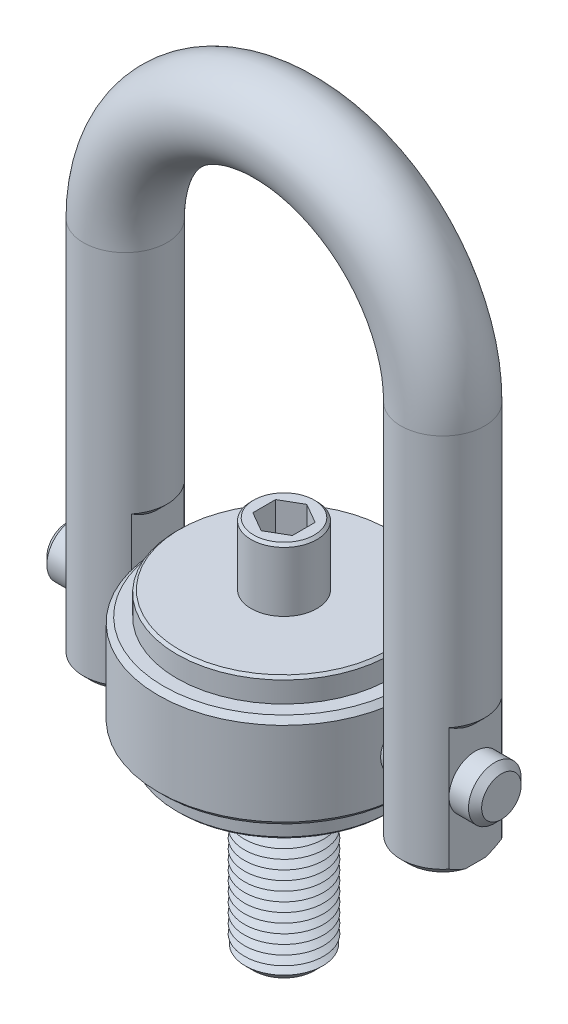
ISO-10303-21;
HEADER;
FILE_DESCRIPTION(('STEP AP214'),'2;1');
FILE_NAME('part.step','',(''),(''),'','','');
FILE_SCHEMA(('AUTOMOTIVE_DESIGN { 1 0 10303 214 1 1 1 1 }'));
ENDSEC;
DATA;
#1=APPLICATION_CONTEXT('core data for automotive mechanical design processes');
#2=APPLICATION_PROTOCOL_DEFINITION('international standard','automotive_design',2000,#1);
#3=PRODUCT_CONTEXT('',#1,'mechanical');
#4=PRODUCT('Part','Part','',(#3));
#5=PRODUCT_RELATED_PRODUCT_CATEGORY('part','',(#4));
#6=PRODUCT_DEFINITION_FORMATION('','',#4);
#7=PRODUCT_DEFINITION_CONTEXT('part definition',#1,'design');
#8=PRODUCT_DEFINITION('design','',#6,#7);
#9=PRODUCT_DEFINITION_SHAPE('','',#8);
#10=(LENGTH_UNIT() NAMED_UNIT(*) SI_UNIT(.MILLI.,.METRE.));
#11=(NAMED_UNIT(*) PLANE_ANGLE_UNIT() SI_UNIT($,.RADIAN.));
#12=(NAMED_UNIT(*) SI_UNIT($,.STERADIAN.) SOLID_ANGLE_UNIT());
#13=UNCERTAINTY_MEASURE_WITH_UNIT(LENGTH_MEASURE(1.E-05),#10,'distance_accuracy_value','');
#14=(GEOMETRIC_REPRESENTATION_CONTEXT(3) GLOBAL_UNCERTAINTY_ASSIGNED_CONTEXT((#13)) GLOBAL_UNIT_ASSIGNED_CONTEXT((#10,
#11,#12)) REPRESENTATION_CONTEXT('',''));
#15=CARTESIAN_POINT('',(0.,0.,0.));
#16=DIRECTION('',(0.,0.,1.));
#17=DIRECTION('',(1.,0.,0.));
#18=AXIS2_PLACEMENT_3D('',#15,#16,#17);
#19=CARTESIAN_POINT('',(82.55,0.,0.));
#20=DIRECTION('',(-1.,0.,0.));
#21=DIRECTION('',(0.,0.,1.));
#22=AXIS2_PLACEMENT_3D('',#19,#20,#21);
#23=CYLINDRICAL_SURFACE('',#22,10.);
#24=CARTESIAN_POINT('',(-80.05,0.,0.));
#25=DIRECTION('',(1.,0.,0.));
#26=DIRECTION('',(0.,0.,-1.));
#27=AXIS2_PLACEMENT_3D('',#24,#25,#26);
#28=CIRCLE('',#27,10.);
#29=CARTESIAN_POINT('',(-80.05,0.,-10.));
#30=VERTEX_POINT('',#29);
#31=EDGE_CURVE('P0_E25',#30,#30,#28,.T.);
#32=ORIENTED_EDGE('',*,*,#31,.T.);
#33=EDGE_LOOP('',(#32));
#34=FACE_BOUND('',#33,.T.);
#35=CARTESIAN_POINT('',(80.05,0.,0.));
#36=DIRECTION('',(1.,0.,0.));
#37=DIRECTION('',(0.,0.,-1.));
#38=AXIS2_PLACEMENT_3D('',#35,#36,#37);
#39=CIRCLE('',#38,10.);
#40=CARTESIAN_POINT('',(80.05,0.,-10.));
#41=VERTEX_POINT('',#40);
#42=EDGE_CURVE('P0_E29',#41,#41,#39,.F.);
#43=ORIENTED_EDGE('',*,*,#42,.T.);
#44=EDGE_LOOP('',(#43));
#45=FACE_BOUND('',#44,.T.);
#46=ADVANCED_FACE('P0_F14',(#34,#45),#23,.T.);
#47=CARTESIAN_POINT('',(82.55,0.,0.));
#48=DIRECTION('',(1.,0.,0.));
#49=DIRECTION('',(0.,0.,-1.));
#50=AXIS2_PLACEMENT_3D('',#47,#48,#49);
#51=PLANE('',#50);
#52=CARTESIAN_POINT('',(82.55,0.,0.));
#53=DIRECTION('',(1.,0.,0.));
#54=DIRECTION('',(0.,0.,-1.));
#55=AXIS2_PLACEMENT_3D('',#52,#53,#54);
#56=CIRCLE('',#55,7.49999999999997);
#57=CARTESIAN_POINT('',(82.55,0.,-7.49999999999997));
#58=VERTEX_POINT('',#57);
#59=EDGE_CURVE('P0_E10',#58,#58,#56,.T.);
#60=ORIENTED_EDGE('',*,*,#59,.T.);
#61=EDGE_LOOP('',(#60));
#62=FACE_BOUND('',#61,.T.);
#63=ADVANCED_FACE('P0_F46',(#62),#51,.T.);
#64=CARTESIAN_POINT('',(-82.55,0.,0.));
#65=DIRECTION('',(1.,0.,0.));
#66=DIRECTION('',(0.,0.,-1.));
#67=AXIS2_PLACEMENT_3D('',#64,#65,#66);
#68=PLANE('',#67);
#69=CARTESIAN_POINT('',(-82.55,0.,0.));
#70=DIRECTION('',(1.,0.,0.));
#71=DIRECTION('',(0.,0.,-1.));
#72=AXIS2_PLACEMENT_3D('',#69,#70,#71);
#73=CIRCLE('',#72,7.49999999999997);
#74=CARTESIAN_POINT('',(-82.55,0.,-7.49999999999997));
#75=VERTEX_POINT('',#74);
#76=EDGE_CURVE('P0_E21',#75,#75,#73,.F.);
#77=ORIENTED_EDGE('',*,*,#76,.T.);
#78=EDGE_LOOP('',(#77));
#79=FACE_BOUND('',#78,.T.);
#80=ADVANCED_FACE('P0_F43',(#79),#68,.F.);
#81=CARTESIAN_POINT('',(-80.05,0.,0.));
#82=DIRECTION('',(1.,0.,0.));
#83=DIRECTION('',(0.,0.,-1.));
#84=AXIS2_PLACEMENT_3D('',#81,#82,#83);
#85=CONICAL_SURFACE('',#84,10.,0.785398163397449);
#86=ORIENTED_EDGE('',*,*,#76,.F.);
#87=EDGE_LOOP('',(#86));
#88=FACE_BOUND('',#87,.T.);
#89=ORIENTED_EDGE('',*,*,#31,.F.);
#90=EDGE_LOOP('',(#89));
#91=FACE_BOUND('',#90,.T.);
#92=ADVANCED_FACE('P0_F38',(#88,#91),#85,.T.);
#93=CARTESIAN_POINT('',(82.55,0.,0.));
#94=DIRECTION('',(-1.,0.,0.));
#95=DIRECTION('',(0.,0.,1.));
#96=AXIS2_PLACEMENT_3D('',#93,#94,#95);
#97=CONICAL_SURFACE('',#96,7.49999999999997,0.785398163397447);
#98=ORIENTED_EDGE('',*,*,#42,.F.);
#99=EDGE_LOOP('',(#98));
#100=FACE_BOUND('',#99,.T.);
#101=ORIENTED_EDGE('',*,*,#59,.F.);
#102=EDGE_LOOP('',(#101));
#103=FACE_BOUND('',#102,.T.);
#104=ADVANCED_FACE('P0_F16',(#100,#103),#97,.T.);
#105=CLOSED_SHELL('',(#46,#63,#80,#92,#104));
#106=MANIFOLD_SOLID_BREP('P0_B1',#105);
#107=CARTESIAN_POINT('',(-47.9383658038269,28.2,10.));
#108=DIRECTION('',(-1.,0.,0.));
#109=DIRECTION('',(0.,0.,1.));
#110=AXIS2_PLACEMENT_3D('',#107,#108,#109);
#111=PLANE('',#110);
#112=DIRECTION('',(0.,-1.,0.));
#113=VECTOR('',#112,1.);
#114=CARTESIAN_POINT('',(-47.9383658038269,28.2,10.));
#115=LINE('',#114,#113);
#116=CARTESIAN_POINT('',(-47.9383658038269,32.7,10.));
#117=VERTEX_POINT('',#116);
#118=CARTESIAN_POINT('',(-47.9383658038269,0.,10.));
#119=VERTEX_POINT('',#118);
#120=EDGE_CURVE('P1_E184',#117,#119,#115,.T.);
#121=ORIENTED_EDGE('',*,*,#120,.T.);
#122=CARTESIAN_POINT('',(-47.9383658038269,0.,0.));
#123=DIRECTION('',(-1.,0.,0.));
#124=DIRECTION('',(0.,0.,1.));
#125=AXIS2_PLACEMENT_3D('',#122,#123,#124);
#126=CIRCLE('',#125,10.);
#127=CARTESIAN_POINT('',(-47.9383658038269,0.,-10.));
#128=VERTEX_POINT('',#127);
#129=EDGE_CURVE('P1_E31',#119,#128,#126,.T.);
#130=ORIENTED_EDGE('',*,*,#129,.T.);
#131=DIRECTION('',(0.,-1.,0.));
#132=VECTOR('',#131,1.);
#133=CARTESIAN_POINT('',(-47.9383658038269,28.2,-10.));
#134=LINE('',#133,#132);
#135=CARTESIAN_POINT('',(-47.9383658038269,32.7,-10.));
#136=VERTEX_POINT('',#135);
#137=EDGE_CURVE('P1_E180',#136,#128,#134,.T.);
#138=ORIENTED_EDGE('',*,*,#137,.F.);
#139=CARTESIAN_POINT('',(-47.9383658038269,32.7,-10.));
#140=CARTESIAN_POINT('',(-47.9383658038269,32.5483389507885,-9.75882173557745));
#141=CARTESIAN_POINT('',(-47.9383658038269,32.3990118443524,-9.51615304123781));
#142=CARTESIAN_POINT('',(-47.9383658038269,32.1057841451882,-9.02748239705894));
#143=CARTESIAN_POINT('',(-47.9383658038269,31.9618848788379,-8.781479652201));
#144=CARTESIAN_POINT('',(-47.9383658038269,31.6797346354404,-8.28482936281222));
#145=CARTESIAN_POINT('',(-47.9383658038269,31.5415108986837,-8.03416628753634));
#146=CARTESIAN_POINT('',(-47.9383658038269,31.2723712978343,-7.52896042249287));
#147=CARTESIAN_POINT('',(-47.9383658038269,31.1414549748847,-7.2744178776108));
#148=CARTESIAN_POINT('',(-47.9383658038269,30.8855140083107,-6.75599854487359));
#149=CARTESIAN_POINT('',(-47.9383658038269,30.7606599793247,-6.49203692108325));
#150=CARTESIAN_POINT('',(-47.9383658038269,30.5211338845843,-5.95953773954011));
#151=CARTESIAN_POINT('',(-47.9383658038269,30.4064626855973,-5.69099979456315));
#152=CARTESIAN_POINT('',(-47.9383658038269,30.0804478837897,-4.8790975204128));
#153=CARTESIAN_POINT('',(-47.9383658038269,29.8865742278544,-4.32840004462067));
#154=CARTESIAN_POINT('',(-47.9383658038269,29.6191683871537,-3.41143153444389));
#155=CARTESIAN_POINT('',(-47.9383658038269,29.5274663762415,-3.05043267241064));
#156=CARTESIAN_POINT('',(-47.9383658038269,29.3728240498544,-2.32215475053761));
#157=CARTESIAN_POINT('',(-47.9383658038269,29.3098877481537,-1.95487482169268));
#158=CARTESIAN_POINT('',(-47.9383658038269,29.2162729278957,-1.21900205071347));
#159=CARTESIAN_POINT('',(-47.9383658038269,29.1853543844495,-0.850440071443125));
#160=CARTESIAN_POINT('',(-47.9383658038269,29.1566460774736,-0.112153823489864));
#161=CARTESIAN_POINT('',(-47.9383658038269,29.1588400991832,0.257569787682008));
#162=CARTESIAN_POINT('',(-47.9383658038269,29.1900174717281,0.873991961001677));
#163=CARTESIAN_POINT('',(-47.9383658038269,29.2099595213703,1.12118851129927));
#164=CARTESIAN_POINT('',(-47.9383658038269,29.264159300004,1.6140970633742));
#165=CARTESIAN_POINT('',(-47.9383658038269,29.2984228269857,1.85980842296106));
#166=CARTESIAN_POINT('',(-47.9383658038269,29.4148598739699,2.55350356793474));
#167=CARTESIAN_POINT('',(-47.9383658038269,29.5131387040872,2.99884258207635));
#168=CARTESIAN_POINT('',(-47.9383658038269,29.7490274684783,3.879149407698));
#169=CARTESIAN_POINT('',(-47.9383658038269,29.886675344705,4.31410677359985));
#170=CARTESIAN_POINT('',(-47.9383658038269,30.1949129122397,5.17454547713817));
#171=CARTESIAN_POINT('',(-47.9383658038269,30.3656669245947,5.59996721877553));
#172=CARTESIAN_POINT('',(-47.9383658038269,30.7330811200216,6.43918325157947));
#173=CARTESIAN_POINT('',(-47.9383658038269,30.9297340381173,6.85298076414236));
#174=CARTESIAN_POINT('',(-47.9383658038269,31.3753615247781,7.73281637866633));
#175=CARTESIAN_POINT('',(-47.9383658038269,31.6277339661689,8.19712419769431));
#176=CARTESIAN_POINT('',(-47.9383658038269,32.0207235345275,8.8822773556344));
#177=CARTESIAN_POINT('',(-47.9383658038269,32.1534532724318,9.10772014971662));
#178=CARTESIAN_POINT('',(-47.9383658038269,32.4234593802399,9.55585714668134));
#179=CARTESIAN_POINT('',(-47.9383658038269,32.5607355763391,9.77855145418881));
#180=CARTESIAN_POINT('',(-47.9383658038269,32.7,10.));
#181=B_SPLINE_CURVE_WITH_KNOTS('',3,(#139,#140,#141,#142,#143,#144,#145,#146,#147,#148,#149,
#150,#151,#152,#153,#154,#155,#156,#157,#158,#159,#160,#161,#162,#163,#164,#165,#166,#167,#168,
#169,#170,#171,#172,#173,#174,#175,#176,#177,#178,#179,#180),.UNSPECIFIED.,.F.,.F.,(4,2,2,2,2,2,
2,2,2,2,2,2,2,2,2,2,2,2,2,2,4),(0.,0.854715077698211,1.70963768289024,2.56827267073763,
3.42685368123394,4.30263827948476,5.17849735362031,6.92671204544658,8.04314393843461,
9.15973156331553,10.2678865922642,11.3754989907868,12.119094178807,12.8629907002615,
14.228848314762,15.5960267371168,16.9701733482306,18.3439353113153,19.928555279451,
20.7133570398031,21.4981288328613),.UNSPECIFIED.);
#182=EDGE_CURVE('P1_E296',#136,#117,#181,.T.);
#183=ORIENTED_EDGE('',*,*,#182,.T.);
#184=EDGE_LOOP('',(#121,#130,#138,#183));
#185=FACE_BOUND('',#184,.T.);
#186=ADVANCED_FACE('P1_F16',(#185),#111,.F.);
#187=CARTESIAN_POINT('',(-72.6616341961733,18.2,10.));
#188=DIRECTION('',(1.,0.,0.));
#189=DIRECTION('',(0.,0.,-1.));
#190=AXIS2_PLACEMENT_3D('',#187,#188,#189);
#191=PLANE('',#190);
#192=DIRECTION('',(0.,-1.,0.));
#193=VECTOR('',#192,1.);
#194=CARTESIAN_POINT('',(-72.6616341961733,18.2,-10.));
#195=LINE('',#194,#193);
#196=CARTESIAN_POINT('',(-72.6616341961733,22.7,-10.));
#197=VERTEX_POINT('',#196);
#198=CARTESIAN_POINT('',(-72.6616341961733,0.,-10.));
#199=VERTEX_POINT('',#198);
#200=EDGE_CURVE('P1_E152',#197,#199,#195,.T.);
#201=ORIENTED_EDGE('',*,*,#200,.T.);
#202=CARTESIAN_POINT('',(-72.6616341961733,0.,0.));
#203=DIRECTION('',(1.,0.,0.));
#204=DIRECTION('',(0.,0.,-1.));
#205=AXIS2_PLACEMENT_3D('',#202,#203,#204);
#206=CIRCLE('',#205,10.);
#207=CARTESIAN_POINT('',(-72.6616341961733,0.,10.));
#208=VERTEX_POINT('',#207);
#209=EDGE_CURVE('P1_E38',#208,#199,#206,.F.);
#210=ORIENTED_EDGE('',*,*,#209,.F.);
#211=DIRECTION('',(0.,-1.,0.));
#212=VECTOR('',#211,1.);
#213=CARTESIAN_POINT('',(-72.6616341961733,18.2,10.));
#214=LINE('',#213,#212);
#215=CARTESIAN_POINT('',(-72.6616341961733,22.7,10.));
#216=VERTEX_POINT('',#215);
#217=EDGE_CURVE('P1_E150',#216,#208,#214,.T.);
#218=ORIENTED_EDGE('',*,*,#217,.F.);
#219=CARTESIAN_POINT('',(-72.6616341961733,22.7,10.));
#220=CARTESIAN_POINT('',(-72.6616341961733,22.5483389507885,9.75882173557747));
#221=CARTESIAN_POINT('',(-72.6616341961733,22.3990118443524,9.51615304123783));
#222=CARTESIAN_POINT('',(-72.6616341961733,22.1057841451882,9.02748239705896));
#223=CARTESIAN_POINT('',(-72.6616341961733,21.9618848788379,8.78147965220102));
#224=CARTESIAN_POINT('',(-72.6616341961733,21.6797346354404,8.28482936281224));
#225=CARTESIAN_POINT('',(-72.6616341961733,21.5415108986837,8.03416628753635));
#226=CARTESIAN_POINT('',(-72.6616341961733,21.2723712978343,7.52896042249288));
#227=CARTESIAN_POINT('',(-72.6616341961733,21.1414549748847,7.27441787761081));
#228=CARTESIAN_POINT('',(-72.6616341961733,20.8855140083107,6.7559985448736));
#229=CARTESIAN_POINT('',(-72.6616341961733,20.7606599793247,6.49203692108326));
#230=CARTESIAN_POINT('',(-72.6616341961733,20.5211338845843,5.95953773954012));
#231=CARTESIAN_POINT('',(-72.6616341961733,20.4064626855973,5.69099979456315));
#232=CARTESIAN_POINT('',(-72.6616341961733,20.0804478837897,4.8790975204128));
#233=CARTESIAN_POINT('',(-72.6616341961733,19.8865742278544,4.32840004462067));
#234=CARTESIAN_POINT('',(-72.6616341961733,19.6191683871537,3.41143153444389));
#235=CARTESIAN_POINT('',(-72.6616341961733,19.5274663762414,3.05043267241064));
#236=CARTESIAN_POINT('',(-72.6616341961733,19.3728240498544,2.32215475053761));
#237=CARTESIAN_POINT('',(-72.6616341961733,19.3098877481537,1.95487482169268));
#238=CARTESIAN_POINT('',(-72.6616341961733,19.2162729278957,1.21900205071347));
#239=CARTESIAN_POINT('',(-72.6616341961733,19.1853543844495,0.85044007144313));
#240=CARTESIAN_POINT('',(-72.6616341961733,19.1566460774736,0.112153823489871));
#241=CARTESIAN_POINT('',(-72.6616341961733,19.1588400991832,-0.257569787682));
#242=CARTESIAN_POINT('',(-72.6616341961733,19.1900174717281,-0.873991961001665));
#243=CARTESIAN_POINT('',(-72.6616341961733,19.2099595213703,-1.12118851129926));
#244=CARTESIAN_POINT('',(-72.6616341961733,19.2641593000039,-1.61409706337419));
#245=CARTESIAN_POINT('',(-72.6616341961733,19.2984228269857,-1.85980842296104));
#246=CARTESIAN_POINT('',(-72.6616341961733,19.4148598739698,-2.55350356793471));
#247=CARTESIAN_POINT('',(-72.6616341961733,19.5131387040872,-2.99884258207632));
#248=CARTESIAN_POINT('',(-72.6616341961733,19.7490274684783,-3.87914940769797));
#249=CARTESIAN_POINT('',(-72.6616341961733,19.8866753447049,-4.31410677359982));
#250=CARTESIAN_POINT('',(-72.6616341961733,20.1949129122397,-5.17454547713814));
#251=CARTESIAN_POINT('',(-72.6616341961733,20.3656669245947,-5.5999672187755));
#252=CARTESIAN_POINT('',(-72.6616341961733,20.7330811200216,-6.43918325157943));
#253=CARTESIAN_POINT('',(-72.6616341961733,20.9297340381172,-6.85298076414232));
#254=CARTESIAN_POINT('',(-72.6616341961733,21.3753615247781,-7.7328163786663));
#255=CARTESIAN_POINT('',(-72.6616341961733,21.6277339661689,-8.19712419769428));
#256=CARTESIAN_POINT('',(-72.6616341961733,22.0207235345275,-8.88227735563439));
#257=CARTESIAN_POINT('',(-72.6616341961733,22.1534532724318,-9.10772014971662));
#258=CARTESIAN_POINT('',(-72.6616341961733,22.4234593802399,-9.55585714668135));
#259=CARTESIAN_POINT('',(-72.6616341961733,22.5607355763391,-9.77855145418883));
#260=CARTESIAN_POINT('',(-72.6616341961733,22.7,-10.));
#261=B_SPLINE_CURVE_WITH_KNOTS('',3,(#219,#220,#221,#222,#223,#224,#225,#226,#227,#228,#229,
#230,#231,#232,#233,#234,#235,#236,#237,#238,#239,#240,#241,#242,#243,#244,#245,#246,#247,#248,
#249,#250,#251,#252,#253,#254,#255,#256,#257,#258,#259,#260),.UNSPECIFIED.,.F.,.F.,(4,2,2,2,2,2,
2,2,2,2,2,2,2,2,2,2,2,2,2,2,4),(0.,0.854715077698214,1.70963768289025,2.56827267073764,
3.42685368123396,4.30263827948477,5.17849735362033,6.9267120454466,8.04314393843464,
9.15973156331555,10.2678865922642,11.3754989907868,12.119094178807,12.8629907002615,
14.228848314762,15.5960267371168,16.9701733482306,18.3439353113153,19.9285552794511,
20.7133570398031,21.4981288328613),.UNSPECIFIED.);
#262=EDGE_CURVE('P1_E303',#216,#197,#261,.T.);
#263=ORIENTED_EDGE('',*,*,#262,.T.);
#264=EDGE_LOOP('',(#201,#210,#218,#263));
#265=FACE_BOUND('',#264,.T.);
#266=ADVANCED_FACE('P1_F147',(#265),#191,.F.);
#267=CARTESIAN_POINT('',(47.9383658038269,28.2,10.));
#268=DIRECTION('',(-1.,0.,0.));
#269=DIRECTION('',(0.,0.,1.));
#270=AXIS2_PLACEMENT_3D('',#267,#268,#269);
#271=PLANE('',#270);
#272=CARTESIAN_POINT('',(47.9383658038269,0.,0.));
#273=DIRECTION('',(-1.,0.,0.));
#274=DIRECTION('',(0.,0.,1.));
#275=AXIS2_PLACEMENT_3D('',#272,#273,#274);
#276=CIRCLE('',#275,10.);
#277=CARTESIAN_POINT('',(47.9383658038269,0.,10.));
#278=VERTEX_POINT('',#277);
#279=CARTESIAN_POINT('',(47.9383658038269,0.,-10.));
#280=VERTEX_POINT('',#279);
#281=EDGE_CURVE('P1_E370',#278,#280,#276,.T.);
#282=ORIENTED_EDGE('',*,*,#281,.F.);
#283=DIRECTION('',(0.,-1.,0.));
#284=VECTOR('',#283,1.);
#285=CARTESIAN_POINT('',(47.9383658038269,28.2,10.));
#286=LINE('',#285,#284);
#287=CARTESIAN_POINT('',(47.9383658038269,32.7000000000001,10.));
#288=VERTEX_POINT('',#287);
#289=EDGE_CURVE('P1_E387',#288,#278,#286,.T.);
#290=ORIENTED_EDGE('',*,*,#289,.F.);
#291=CARTESIAN_POINT('',(47.9383658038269,32.7000000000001,10.));
#292=CARTESIAN_POINT('',(47.9383658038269,32.5109530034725,9.69932343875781));
#293=CARTESIAN_POINT('',(47.9383658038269,32.3254929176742,9.39633176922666));
#294=CARTESIAN_POINT('',(47.9383658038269,31.9632674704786,8.78497772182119));
#295=CARTESIAN_POINT('',(47.9383658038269,31.7865069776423,8.47661246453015));
#296=CARTESIAN_POINT('',(47.9383658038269,31.4415836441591,7.85078044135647));
#297=CARTESIAN_POINT('',(47.9383658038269,31.2735326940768,7.53325166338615));
#298=CARTESIAN_POINT('',(47.9383658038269,30.9502499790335,6.8917590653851));
#299=CARTESIAN_POINT('',(47.9383658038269,30.7950163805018,6.56779617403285));
#300=CARTESIAN_POINT('',(47.9383658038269,30.4982062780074,5.90916627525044));
#301=CARTESIAN_POINT('',(47.9383658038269,30.3568060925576,5.57441925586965));
#302=CARTESIAN_POINT('',(47.9383658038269,30.0927895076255,4.89748524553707));
#303=CARTESIAN_POINT('',(47.9383658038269,29.9701755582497,4.55529729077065));
#304=CARTESIAN_POINT('',(47.9383658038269,29.7477186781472,3.86517786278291));
#305=CARTESIAN_POINT('',(47.9383658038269,29.6477787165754,3.51727796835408));
#306=CARTESIAN_POINT('',(47.9383658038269,29.4735886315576,2.81519322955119));
#307=CARTESIAN_POINT('',(47.9383658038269,29.399326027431,2.46101152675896));
#308=CARTESIAN_POINT('',(47.9383658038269,29.2879040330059,1.79709448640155));
#309=CARTESIAN_POINT('',(47.9383658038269,29.2470346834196,1.48798337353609));
#310=CARTESIAN_POINT('',(47.9383658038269,29.1881843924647,0.867458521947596));
#311=CARTESIAN_POINT('',(47.9383658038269,29.1702106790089,0.556044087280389));
#312=CARTESIAN_POINT('',(47.9383658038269,29.1579354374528,-0.0649069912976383));
#313=CARTESIAN_POINT('',(47.9383658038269,29.1634569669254,-0.374440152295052));
#314=CARTESIAN_POINT('',(47.9383658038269,29.1975567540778,-0.992234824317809));
#315=CARTESIAN_POINT('',(47.9383658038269,29.2261350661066,-1.30049633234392));
#316=CARTESIAN_POINT('',(47.9383658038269,29.2940549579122,-1.8273172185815));
#317=CARTESIAN_POINT('',(47.9383658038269,29.3280649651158,-2.04658413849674));
#318=CARTESIAN_POINT('',(47.9383658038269,29.4067513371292,-2.48320510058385));
#319=CARTESIAN_POINT('',(47.9383658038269,29.4514287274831,-2.70055895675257));
#320=CARTESIAN_POINT('',(47.9383658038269,29.6004301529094,-3.34934073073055));
#321=CARTESIAN_POINT('',(47.9383658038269,29.7197095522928,-3.77738572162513));
#322=CARTESIAN_POINT('',(47.9383658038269,29.9927877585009,-4.62633577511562));
#323=CARTESIAN_POINT('',(47.9383658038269,30.1468888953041,-5.04714130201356));
#324=CARTESIAN_POINT('',(47.9383658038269,30.4824998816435,-5.87750320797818));
#325=CARTESIAN_POINT('',(47.9383658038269,30.6640058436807,-6.28706117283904));
#326=CARTESIAN_POINT('',(47.9383658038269,30.9932609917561,-6.97871570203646));
#327=CARTESIAN_POINT('',(47.9383658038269,31.1355962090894,-7.26342638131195));
#328=CARTESIAN_POINT('',(47.9383658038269,31.4296968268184,-7.82790227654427));
#329=CARTESIAN_POINT('',(47.9383658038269,31.5814614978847,-8.10766787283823));
#330=CARTESIAN_POINT('',(47.9383658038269,31.8906501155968,-8.65846055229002));
#331=CARTESIAN_POINT('',(47.9383658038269,32.0479532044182,-8.92955581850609));
#332=CARTESIAN_POINT('',(47.9383658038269,32.3692342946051,-9.46770064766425));
#333=CARTESIAN_POINT('',(47.9383658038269,32.5332110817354,-9.73475093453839));
#334=CARTESIAN_POINT('',(47.9383658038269,32.7,-10.));
#335=B_SPLINE_CURVE_WITH_KNOTS('',3,(#291,#292,#293,#294,#295,#296,#297,#298,#299,#300,#301,
#302,#303,#304,#305,#306,#307,#308,#309,#310,#311,#312,#313,#314,#315,#316,#317,#318,#319,#320,
#321,#322,#323,#324,#325,#326,#327,#328,#329,#330,#331,#332,#333,#334),.UNSPECIFIED.,.F.,.F.,(4,
2,2,2,2,2,2,2,2,2,2,2,2,2,2,2,2,2,2,2,2,4),(0.,1.06555746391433,2.13170461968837,
3.20923011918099,4.28660120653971,5.37628272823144,6.46610624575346,7.55117411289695,
8.63571383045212,9.57032733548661,10.5052358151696,11.4331160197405,12.3609984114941,
13.0264017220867,13.6918690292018,15.0231145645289,16.3663954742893,17.7094860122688,
18.6642324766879,19.6189051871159,20.5590879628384,21.4991004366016),.UNSPECIFIED.);
#336=CARTESIAN_POINT('',(47.9383658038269,32.7000000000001,-10.));
#337=VERTEX_POINT('',#336);
#338=EDGE_CURVE('P1_E210',#288,#337,#335,.T.);
#339=ORIENTED_EDGE('',*,*,#338,.T.);
#340=DIRECTION('',(0.,-1.,0.));
#341=VECTOR('',#340,1.);
#342=CARTESIAN_POINT('',(47.9383658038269,28.2,-10.));
#343=LINE('',#342,#341);
#344=EDGE_CURVE('P1_E390',#337,#280,#343,.T.);
#345=ORIENTED_EDGE('',*,*,#344,.T.);
#346=EDGE_LOOP('',(#282,#290,#339,#345));
#347=FACE_BOUND('',#346,.T.);
#348=ADVANCED_FACE('P1_F429',(#347),#271,.T.);
#349=CARTESIAN_POINT('',(72.6616341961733,18.2,10.));
#350=DIRECTION('',(1.,0.,0.));
#351=DIRECTION('',(0.,0.,-1.));
#352=AXIS2_PLACEMENT_3D('',#349,#350,#351);
#353=PLANE('',#352);
#354=CARTESIAN_POINT('',(72.6616341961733,0.,0.));
#355=DIRECTION('',(1.,0.,0.));
#356=DIRECTION('',(0.,0.,-1.));
#357=AXIS2_PLACEMENT_3D('',#354,#355,#356);
#358=CIRCLE('',#357,10.);
#359=CARTESIAN_POINT('',(72.6616341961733,0.,-10.));
#360=VERTEX_POINT('',#359);
#361=CARTESIAN_POINT('',(72.6616341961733,0.,10.));
#362=VERTEX_POINT('',#361);
#363=EDGE_CURVE('P1_E153',#360,#362,#358,.T.);
#364=ORIENTED_EDGE('',*,*,#363,.F.);
#365=DIRECTION('',(0.,-1.,0.));
#366=VECTOR('',#365,1.);
#367=CARTESIAN_POINT('',(72.6616341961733,18.2,-10.));
#368=LINE('',#367,#366);
#369=CARTESIAN_POINT('',(72.6616341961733,22.7000000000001,-10.));
#370=VERTEX_POINT('',#369);
#371=EDGE_CURVE('P1_E376',#370,#360,#368,.T.);
#372=ORIENTED_EDGE('',*,*,#371,.F.);
#373=CARTESIAN_POINT('',(72.6616341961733,22.7000000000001,-10.));
#374=CARTESIAN_POINT('',(72.6616341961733,22.5109530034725,-9.69932343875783));
#375=CARTESIAN_POINT('',(72.6616341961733,22.3254929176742,-9.39633176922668));
#376=CARTESIAN_POINT('',(72.6616341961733,21.9632674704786,-8.78497772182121));
#377=CARTESIAN_POINT('',(72.6616341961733,21.7865069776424,-8.47661246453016));
#378=CARTESIAN_POINT('',(72.6616341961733,21.4415836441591,-7.85078044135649));
#379=CARTESIAN_POINT('',(72.6616341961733,21.2735326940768,-7.53325166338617));
#380=CARTESIAN_POINT('',(72.6616341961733,20.9502499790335,-6.89175906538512));
#381=CARTESIAN_POINT('',(72.6616341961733,20.7950163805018,-6.56779617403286));
#382=CARTESIAN_POINT('',(72.6616341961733,20.4982062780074,-5.90916627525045));
#383=CARTESIAN_POINT('',(72.6616341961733,20.3568060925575,-5.57441925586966));
#384=CARTESIAN_POINT('',(72.6616341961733,20.0927895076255,-4.89748524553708));
#385=CARTESIAN_POINT('',(72.6616341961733,19.9701755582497,-4.55529729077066));
#386=CARTESIAN_POINT('',(72.6616341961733,19.7477186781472,-3.86517786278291));
#387=CARTESIAN_POINT('',(72.6616341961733,19.6477787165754,-3.51727796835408));
#388=CARTESIAN_POINT('',(72.6616341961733,19.4735886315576,-2.81519322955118));
#389=CARTESIAN_POINT('',(72.6616341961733,19.399326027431,-2.46101152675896));
#390=CARTESIAN_POINT('',(72.6616341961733,19.2879040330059,-1.79709448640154));
#391=CARTESIAN_POINT('',(72.6616341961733,19.2470346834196,-1.48798337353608));
#392=CARTESIAN_POINT('',(72.6616341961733,19.1881843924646,-0.867458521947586));
#393=CARTESIAN_POINT('',(72.6616341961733,19.1702106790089,-0.556044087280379));
#394=CARTESIAN_POINT('',(72.6616341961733,19.1579354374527,0.0649069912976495));
#395=CARTESIAN_POINT('',(72.6616341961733,19.1634569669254,0.374440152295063));
#396=CARTESIAN_POINT('',(72.6616341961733,19.1975567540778,0.992234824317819));
#397=CARTESIAN_POINT('',(72.6616341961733,19.2261350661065,1.30049633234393));
#398=CARTESIAN_POINT('',(72.6616341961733,19.2940549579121,1.82731721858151));
#399=CARTESIAN_POINT('',(72.6616341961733,19.3280649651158,2.04658413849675));
#400=CARTESIAN_POINT('',(72.6616341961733,19.4067513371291,2.48320510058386));
#401=CARTESIAN_POINT('',(72.6616341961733,19.4514287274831,2.70055895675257));
#402=CARTESIAN_POINT('',(72.6616341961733,19.6004301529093,3.34934073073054));
#403=CARTESIAN_POINT('',(72.6616341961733,19.7197095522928,3.77738572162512));
#404=CARTESIAN_POINT('',(72.6616341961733,19.9927877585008,4.6263357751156));
#405=CARTESIAN_POINT('',(72.6616341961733,20.1468888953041,5.04714130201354));
#406=CARTESIAN_POINT('',(72.6616341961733,20.4824998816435,5.87750320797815));
#407=CARTESIAN_POINT('',(72.6616341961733,20.6640058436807,6.28706117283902));
#408=CARTESIAN_POINT('',(72.6616341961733,20.993260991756,6.97871570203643));
#409=CARTESIAN_POINT('',(72.6616341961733,21.1355962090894,7.26342638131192));
#410=CARTESIAN_POINT('',(72.6616341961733,21.4296968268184,7.82790227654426));
#411=CARTESIAN_POINT('',(72.6616341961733,21.5814614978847,8.10766787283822));
#412=CARTESIAN_POINT('',(72.6616341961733,21.8906501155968,8.65846055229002));
#413=CARTESIAN_POINT('',(72.6616341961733,22.0479532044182,8.9295558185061));
#414=CARTESIAN_POINT('',(72.6616341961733,22.3692342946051,9.46770064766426));
#415=CARTESIAN_POINT('',(72.6616341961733,22.5332110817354,9.73475093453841));
#416=CARTESIAN_POINT('',(72.6616341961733,22.7000000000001,10.));
#417=B_SPLINE_CURVE_WITH_KNOTS('',3,(#373,#374,#375,#376,#377,#378,#379,#380,#381,#382,#383,
#384,#385,#386,#387,#388,#389,#390,#391,#392,#393,#394,#395,#396,#397,#398,#399,#400,#401,#402,
#403,#404,#405,#406,#407,#408,#409,#410,#411,#412,#413,#414,#415,#416),.UNSPECIFIED.,.F.,.F.,(4,
2,2,2,2,2,2,2,2,2,2,2,2,2,2,2,2,2,2,2,2,4),(0.,1.06555746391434,2.13170461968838,3.209230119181,
4.28660120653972,5.37628272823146,6.46610624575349,7.55117411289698,8.63571383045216,
9.57032733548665,10.5052358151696,11.4331160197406,12.3609984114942,13.0264017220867,
13.6918690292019,15.023114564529,16.3663954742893,17.7094860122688,18.6642324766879,
19.6189051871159,20.5590879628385,21.4991004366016),.UNSPECIFIED.);
#418=CARTESIAN_POINT('',(72.6616341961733,22.7000000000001,10.));
#419=VERTEX_POINT('',#418);
#420=EDGE_CURVE('P1_E202',#370,#419,#417,.T.);
#421=ORIENTED_EDGE('',*,*,#420,.T.);
#422=DIRECTION('',(0.,-1.,0.));
#423=VECTOR('',#422,1.);
#424=CARTESIAN_POINT('',(72.6616341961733,18.2,10.));
#425=LINE('',#424,#423);
#426=EDGE_CURVE('P1_E381',#419,#362,#425,.T.);
#427=ORIENTED_EDGE('',*,*,#426,.T.);
#428=EDGE_LOOP('',(#364,#372,#421,#427));
#429=FACE_BOUND('',#428,.T.);
#430=ADVANCED_FACE('P1_F226',(#429),#353,.T.);
#431=CARTESIAN_POINT('',(60.3000000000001,-26.7999999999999,0.));
#432=DIRECTION('',(0.,-1.,0.));
#433=DIRECTION('',(0.,0.,1.));
#434=AXIS2_PLACEMENT_3D('',#431,#432,#433);
#435=PLANE('',#434);
#436=DIRECTION('',(0.,0.,-1.));
#437=VECTOR('',#436,1.);
#438=CARTESIAN_POINT('',(47.9383658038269,-26.8,10.));
#439=LINE('',#438,#437);
#440=CARTESIAN_POINT('',(47.9383658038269,-26.8,3.68781778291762));
#441=VERTEX_POINT('',#440);
#442=CARTESIAN_POINT('',(47.9383658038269,-26.8,-3.68781778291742));
#443=VERTEX_POINT('',#442);
#444=EDGE_CURVE('P1_E379',#441,#443,#439,.T.);
#445=ORIENTED_EDGE('',*,*,#444,.T.);
#446=CARTESIAN_POINT('',(60.3000000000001,-26.7999999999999,0.));
#447=DIRECTION('',(0.,-1.,0.));
#448=DIRECTION('',(1.,0.,0.));
#449=AXIS2_PLACEMENT_3D('',#446,#447,#448);
#450=CIRCLE('',#449,12.9);
#451=CARTESIAN_POINT('',(72.6616341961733,-26.8,-3.68781778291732));
#452=VERTEX_POINT('',#451);
#453=EDGE_CURVE('P1_E241',#443,#452,#450,.T.);
#454=ORIENTED_EDGE('',*,*,#453,.T.);
#455=DIRECTION('',(0.,0.,1.));
#456=VECTOR('',#455,1.);
#457=CARTESIAN_POINT('',(72.6616341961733,-26.8,10.));
#458=LINE('',#457,#456);
#459=CARTESIAN_POINT('',(72.6616341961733,-26.8,3.6878177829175));
#460=VERTEX_POINT('',#459);
#461=EDGE_CURVE('P1_E366',#452,#460,#458,.T.);
#462=ORIENTED_EDGE('',*,*,#461,.T.);
#463=CARTESIAN_POINT('',(60.3000000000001,-26.7999999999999,0.));
#464=DIRECTION('',(0.,-1.,0.));
#465=DIRECTION('',(1.,0.,0.));
#466=AXIS2_PLACEMENT_3D('',#463,#464,#465);
#467=CIRCLE('',#466,12.9000000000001);
#468=CARTESIAN_POINT('',(60.3000000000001,-26.7999999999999,12.9000000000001));
#469=VERTEX_POINT('',#468);
#470=EDGE_CURVE('P1_E415',#460,#469,#467,.T.);
#471=ORIENTED_EDGE('',*,*,#470,.T.);
#472=CARTESIAN_POINT('',(60.3000000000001,-26.7999999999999,0.));
#473=DIRECTION('',(0.,-1.,0.));
#474=DIRECTION('',(1.,0.,0.));
#475=AXIS2_PLACEMENT_3D('',#472,#473,#474);
#476=CIRCLE('',#475,12.9000000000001);
#477=EDGE_CURVE('P1_E413',#469,#441,#476,.T.);
#478=ORIENTED_EDGE('',*,*,#477,.T.);
#479=EDGE_LOOP('',(#445,#454,#462,#471,#478));
#480=FACE_BOUND('',#479,.T.);
#481=ADVANCED_FACE('P1_F419',(#480),#435,.T.);
#482=CARTESIAN_POINT('',(60.3000000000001,118.7,0.));
#483=DIRECTION('',(0.,-1.,0.));
#484=DIRECTION('',(1.,0.,0.));
#485=AXIS2_PLACEMENT_3D('',#482,#483,#484);
#486=CYLINDRICAL_SURFACE('',#485,15.9);
#487=CARTESIAN_POINT('',(60.3000000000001,118.7,0.));
#488=DIRECTION('',(0.,-1.,0.));
#489=DIRECTION('',(0.,0.,1.));
#490=AXIS2_PLACEMENT_3D('',#487,#488,#489);
#491=CIRCLE('',#490,15.9);
#492=CARTESIAN_POINT('',(76.2000000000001,118.7,0.));
#493=VERTEX_POINT('',#492);
#494=EDGE_CURVE('P1_E189',#493,#493,#491,.T.);
#495=ORIENTED_EDGE('',*,*,#494,.T.);
#496=EDGE_LOOP('',(#495));
#497=FACE_BOUND('',#496,.T.);
#498=ORIENTED_EDGE('',*,*,#371,.T.);
#499=CARTESIAN_POINT('',(72.6616341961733,-23.7999999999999,-10.));
#500=VERTEX_POINT('',#499);
#501=EDGE_CURVE('P1_E380',#360,#500,#368,.T.);
#502=ORIENTED_EDGE('',*,*,#501,.T.);
#503=CARTESIAN_POINT('',(60.3000000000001,-23.7999999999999,0.));
#504=DIRECTION('',(0.,-1.,0.));
#505=DIRECTION('',(0.,0.,-1.));
#506=AXIS2_PLACEMENT_3D('',#503,#504,#505);
#507=CIRCLE('',#506,15.9);
#508=CARTESIAN_POINT('',(47.9383658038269,-23.7999999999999,-10.));
#509=VERTEX_POINT('',#508);
#510=EDGE_CURVE('P1_E404',#500,#509,#507,.F.);
#511=ORIENTED_EDGE('',*,*,#510,.T.);
#512=EDGE_CURVE('P1_E386',#280,#509,#343,.T.);
#513=ORIENTED_EDGE('',*,*,#512,.F.);
#514=ORIENTED_EDGE('',*,*,#344,.F.);
#515=CARTESIAN_POINT('',(60.3000000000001,32.7000000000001,0.));
#516=DIRECTION('',(0.,-1.,0.));
#517=DIRECTION('',(0.,0.,-1.));
#518=AXIS2_PLACEMENT_3D('',#515,#516,#517);
#519=CIRCLE('',#518,15.9);
#520=EDGE_CURVE('P1_E192',#337,#288,#519,.F.);
#521=ORIENTED_EDGE('',*,*,#520,.T.);
#522=ORIENTED_EDGE('',*,*,#289,.T.);
#523=CARTESIAN_POINT('',(47.9383658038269,-23.7999999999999,10.));
#524=VERTEX_POINT('',#523);
#525=EDGE_CURVE('P1_E389',#278,#524,#286,.T.);
#526=ORIENTED_EDGE('',*,*,#525,.T.);
#527=CARTESIAN_POINT('',(60.3000000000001,-23.7999999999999,0.));
#528=DIRECTION('',(0.,-1.,0.));
#529=DIRECTION('',(0.,0.,-1.));
#530=AXIS2_PLACEMENT_3D('',#527,#528,#529);
#531=CIRCLE('',#530,15.9);
#532=CARTESIAN_POINT('',(60.3000000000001,-23.7999999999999,15.9));
#533=VERTEX_POINT('',#532);
#534=EDGE_CURVE('P1_E408',#524,#533,#531,.F.);
#535=ORIENTED_EDGE('',*,*,#534,.T.);
#536=CARTESIAN_POINT('',(60.3000000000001,-23.7999999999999,0.));
#537=DIRECTION('',(0.,-1.,0.));
#538=DIRECTION('',(0.,0.,-1.));
#539=AXIS2_PLACEMENT_3D('',#536,#537,#538);
#540=CIRCLE('',#539,15.9);
#541=CARTESIAN_POINT('',(72.6616341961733,-23.7999999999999,10.));
#542=VERTEX_POINT('',#541);
#543=EDGE_CURVE('P1_E423',#533,#542,#540,.F.);
#544=ORIENTED_EDGE('',*,*,#543,.T.);
#545=EDGE_CURVE('P1_E375',#362,#542,#425,.T.);
#546=ORIENTED_EDGE('',*,*,#545,.F.);
#547=ORIENTED_EDGE('',*,*,#426,.F.);
#548=CARTESIAN_POINT('',(60.3000000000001,22.7000000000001,0.));
#549=DIRECTION('',(0.,-1.,0.));
#550=DIRECTION('',(0.,0.,-1.));
#551=AXIS2_PLACEMENT_3D('',#548,#549,#550);
#552=CIRCLE('',#551,15.9);
#553=EDGE_CURVE('P1_E195',#419,#370,#552,.F.);
#554=ORIENTED_EDGE('',*,*,#553,.T.);
#555=EDGE_LOOP('',(#498,#502,#511,#513,#514,#521,#522,#526,#535,#544,#546,#547,#554));
#556=FACE_BOUND('',#555,.T.);
#557=ADVANCED_FACE('P1_F405',(#497,#556),#486,.T.);
#558=CARTESIAN_POINT('',(-60.3000000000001,-26.8,0.));
#559=DIRECTION('',(0.,1.,0.));
#560=DIRECTION('',(0.,0.,1.));
#561=AXIS2_PLACEMENT_3D('',#558,#559,#560);
#562=PLANE('',#561);
#563=DIRECTION('',(0.,0.,1.));
#564=VECTOR('',#563,1.);
#565=CARTESIAN_POINT('',(-72.6616341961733,-26.8,10.));
#566=LINE('',#565,#564);
#567=CARTESIAN_POINT('',(-72.6616341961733,-26.8,-3.68781778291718));
#568=VERTEX_POINT('',#567);
#569=CARTESIAN_POINT('',(-72.6616341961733,-26.8,3.68781778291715));
#570=VERTEX_POINT('',#569);
#571=EDGE_CURVE('P1_E176',#568,#570,#566,.T.);
#572=ORIENTED_EDGE('',*,*,#571,.F.);
#573=CARTESIAN_POINT('',(-60.3000000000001,-26.8,0.));
#574=DIRECTION('',(0.,1.,0.));
#575=DIRECTION('',(0.,0.,1.));
#576=AXIS2_PLACEMENT_3D('',#573,#574,#575);
#577=CIRCLE('',#576,12.9);
#578=CARTESIAN_POINT('',(-47.9383658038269,-26.8,-3.68781778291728));
#579=VERTEX_POINT('',#578);
#580=EDGE_CURVE('P1_E353',#568,#579,#577,.F.);
#581=ORIENTED_EDGE('',*,*,#580,.T.);
#582=DIRECTION('',(0.,0.,-1.));
#583=VECTOR('',#582,1.);
#584=CARTESIAN_POINT('',(-47.9383658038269,-26.8,10.));
#585=LINE('',#584,#583);
#586=CARTESIAN_POINT('',(-47.9383658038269,-26.8,3.68781778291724));
#587=VERTEX_POINT('',#586);
#588=EDGE_CURVE('P1_E170',#587,#579,#585,.T.);
#589=ORIENTED_EDGE('',*,*,#588,.F.);
#590=CARTESIAN_POINT('',(-60.3000000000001,-26.8,0.));
#591=DIRECTION('',(0.,1.,0.));
#592=DIRECTION('',(0.,0.,1.));
#593=AXIS2_PLACEMENT_3D('',#590,#591,#592);
#594=CIRCLE('',#593,12.9);
#595=CARTESIAN_POINT('',(-60.3000000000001,-26.8,12.9));
#596=VERTEX_POINT('',#595);
#597=EDGE_CURVE('P1_E345',#587,#596,#594,.F.);
#598=ORIENTED_EDGE('',*,*,#597,.T.);
#599=CARTESIAN_POINT('',(-60.3000000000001,-26.8,0.));
#600=DIRECTION('',(0.,1.,0.));
#601=DIRECTION('',(0.,0.,1.));
#602=AXIS2_PLACEMENT_3D('',#599,#600,#601);
#603=CIRCLE('',#602,12.9);
#604=EDGE_CURVE('P1_E348',#596,#570,#603,.F.);
#605=ORIENTED_EDGE('',*,*,#604,.T.);
#606=EDGE_LOOP('',(#572,#581,#589,#598,#605));
#607=FACE_BOUND('',#606,.T.);
#608=ADVANCED_FACE('P1_F291',(#607),#562,.F.);
#609=CARTESIAN_POINT('',(-60.3000000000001,-26.8,0.));
#610=DIRECTION('',(0.,1.,0.));
#611=DIRECTION('',(-1.,0.,0.));
#612=AXIS2_PLACEMENT_3D('',#609,#610,#611);
#613=CYLINDRICAL_SURFACE('',#612,15.9);
#614=ORIENTED_EDGE('',*,*,#137,.T.);
#615=CARTESIAN_POINT('',(-47.9383658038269,-23.8,-10.));
#616=VERTEX_POINT('',#615);
#617=EDGE_CURVE('P1_E183',#128,#616,#134,.T.);
#618=ORIENTED_EDGE('',*,*,#617,.T.);
#619=CARTESIAN_POINT('',(-60.3000000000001,-23.8,0.));
#620=DIRECTION('',(0.,1.,0.));
#621=DIRECTION('',(0.,0.,1.));
#622=AXIS2_PLACEMENT_3D('',#619,#620,#621);
#623=CIRCLE('',#622,15.9);
#624=CARTESIAN_POINT('',(-72.6616341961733,-23.8,-10.));
#625=VERTEX_POINT('',#624);
#626=EDGE_CURVE('P1_E340',#616,#625,#623,.T.);
#627=ORIENTED_EDGE('',*,*,#626,.T.);
#628=EDGE_CURVE('P1_E178',#199,#625,#195,.T.);
#629=ORIENTED_EDGE('',*,*,#628,.F.);
#630=ORIENTED_EDGE('',*,*,#200,.F.);
#631=CARTESIAN_POINT('',(-60.3000000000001,22.7,0.));
#632=DIRECTION('',(0.,-1.,0.));
#633=DIRECTION('',(0.,0.,-1.));
#634=AXIS2_PLACEMENT_3D('',#631,#632,#633);
#635=CIRCLE('',#634,15.9);
#636=EDGE_CURVE('P1_E169',#197,#216,#635,.F.);
#637=ORIENTED_EDGE('',*,*,#636,.T.);
#638=ORIENTED_EDGE('',*,*,#217,.T.);
#639=CARTESIAN_POINT('',(-72.6616341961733,-23.8,10.));
#640=VERTEX_POINT('',#639);
#641=EDGE_CURVE('P1_E155',#208,#640,#214,.T.);
#642=ORIENTED_EDGE('',*,*,#641,.T.);
#643=CARTESIAN_POINT('',(-60.3000000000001,-23.8,0.));
#644=DIRECTION('',(0.,1.,0.));
#645=DIRECTION('',(0.,0.,1.));
#646=AXIS2_PLACEMENT_3D('',#643,#644,#645);
#647=CIRCLE('',#646,15.9);
#648=CARTESIAN_POINT('',(-60.3000000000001,-23.8,15.9));
#649=VERTEX_POINT('',#648);
#650=EDGE_CURVE('P1_E338',#640,#649,#647,.T.);
#651=ORIENTED_EDGE('',*,*,#650,.T.);
#652=CARTESIAN_POINT('',(-60.3000000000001,-23.8,0.));
#653=DIRECTION('',(0.,1.,0.));
#654=DIRECTION('',(0.,0.,1.));
#655=AXIS2_PLACEMENT_3D('',#652,#653,#654);
#656=CIRCLE('',#655,15.9);
#657=CARTESIAN_POINT('',(-47.9383658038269,-23.8,10.));
#658=VERTEX_POINT('',#657);
#659=EDGE_CURVE('P1_E330',#649,#658,#656,.T.);
#660=ORIENTED_EDGE('',*,*,#659,.T.);
#661=EDGE_CURVE('P1_E172',#119,#658,#115,.T.);
#662=ORIENTED_EDGE('',*,*,#661,.F.);
#663=ORIENTED_EDGE('',*,*,#120,.F.);
#664=CARTESIAN_POINT('',(-60.3000000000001,32.7,0.));
#665=DIRECTION('',(0.,-1.,0.));
#666=DIRECTION('',(0.,0.,-1.));
#667=AXIS2_PLACEMENT_3D('',#664,#665,#666);
#668=CIRCLE('',#667,15.9);
#669=EDGE_CURVE('P1_E199',#117,#136,#668,.F.);
#670=ORIENTED_EDGE('',*,*,#669,.T.);
#671=EDGE_LOOP('',(#614,#618,#627,#629,#630,#637,#638,#642,#651,#660,#662,#663,#670));
#672=FACE_BOUND('',#671,.T.);
#673=CARTESIAN_POINT('',(-60.3000000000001,118.7,0.));
#674=DIRECTION('',(0.,1.,0.));
#675=DIRECTION('',(0.,0.,1.));
#676=AXIS2_PLACEMENT_3D('',#673,#674,#675);
#677=CIRCLE('',#676,15.9);
#678=CARTESIAN_POINT('',(-76.2000000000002,118.7,0.));
#679=VERTEX_POINT('',#678);
#680=EDGE_CURVE('P1_E182',#679,#679,#677,.T.);
#681=ORIENTED_EDGE('',*,*,#680,.F.);
#682=EDGE_LOOP('',(#681));
#683=FACE_BOUND('',#682,.T.);
#684=ADVANCED_FACE('P1_F166',(#672,#683),#613,.T.);
#685=CARTESIAN_POINT('',(0.,118.7,0.));
#686=DIRECTION('',(0.,0.,-1.));
#687=DIRECTION('',(-1.,0.,0.));
#688=AXIS2_PLACEMENT_3D('',#685,#686,#687);
#689=TOROIDAL_SURFACE('',#688,60.3000000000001,15.9);
#690=CARTESIAN_POINT('',(0.,118.7,0.));
#691=DIRECTION('',(0.,0.,-1.));
#692=DIRECTION('',(-1.,0.,0.));
#693=AXIS2_PLACEMENT_3D('',#690,#691,#692);
#694=CIRCLE('',#693,76.2000000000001);
#695=EDGE_CURVE('',#679,#493,#694,.T.);
#696=ORIENTED_EDGE('',*,*,#680,.T.);
#697=ORIENTED_EDGE('',*,*,#494,.F.);
#698=ORIENTED_EDGE('',*,*,#695,.T.);
#699=ORIENTED_EDGE('',*,*,#695,.F.);
#700=EDGE_LOOP('',(#696,#698,#697,#699));
#701=FACE_BOUND('',#700,.T.);
#702=ADVANCED_FACE('P1_F289',(#701),#689,.T.);
#703=ORIENTED_EDGE('',*,*,#617,.F.);
#704=EDGE_CURVE('P1_E367',#128,#119,#126,.T.);
#705=ORIENTED_EDGE('',*,*,#704,.T.);
#706=ORIENTED_EDGE('',*,*,#661,.T.);
#707=CARTESIAN_POINT('',(-47.9383658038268,-23.8,10.));
#708=CARTESIAN_POINT('',(-47.9383658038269,-23.9557308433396,9.75234655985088));
#709=CARTESIAN_POINT('',(-47.9383658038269,-24.1090036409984,9.50312121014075));
#710=CARTESIAN_POINT('',(-47.9383658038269,-24.4097964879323,9.00116222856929));
#711=CARTESIAN_POINT('',(-47.9383658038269,-24.5573154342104,8.74842793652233));
#712=CARTESIAN_POINT('',(-47.9383658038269,-24.8449994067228,8.24042477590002));
#713=CARTESIAN_POINT('',(-47.9383658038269,-24.9851968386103,7.98517432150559));
#714=CARTESIAN_POINT('',(-47.9383658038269,-25.2579608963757,7.47061588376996));
#715=CARTESIAN_POINT('',(-47.9383658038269,-25.3905275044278,7.21130789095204));
#716=CARTESIAN_POINT('',(-47.9383658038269,-25.6470475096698,6.68787018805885));
#717=CARTESIAN_POINT('',(-47.9383658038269,-25.7709849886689,6.42373264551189));
#718=CARTESIAN_POINT('',(-47.9383658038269,-26.0085500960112,5.89089614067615));
#719=CARTESIAN_POINT('',(-47.9383658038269,-26.1221794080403,5.62219793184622));
#720=CARTESIAN_POINT('',(-47.9383658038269,-26.3380678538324,5.07874963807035));
#721=CARTESIAN_POINT('',(-47.9383658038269,-26.4402701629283,4.80397679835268));
#722=CARTESIAN_POINT('',(-47.9383658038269,-26.6309273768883,4.24952191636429));
#723=CARTESIAN_POINT('',(-47.9383658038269,-26.719373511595,3.96983686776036));
#724=CARTESIAN_POINT('',(-47.9383658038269,-26.8,3.68781778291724));
#725=B_SPLINE_CURVE_WITH_KNOTS('',3,(#707,#708,#709,#710,#711,#712,#713,#714,#715,#716,#717,
#718,#719,#720,#721,#722,#723,#724),.UNSPECIFIED.,.F.,.F.,(4,2,2,2,2,2,2,2,4),(0.,
0.877662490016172,1.75549240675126,2.62903382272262,3.50257727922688,4.37769166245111,
5.25266285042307,6.13180789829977,7.01151116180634),.UNSPECIFIED.);
#726=EDGE_CURVE('P1_E279',#658,#587,#725,.T.);
#727=ORIENTED_EDGE('',*,*,#726,.T.);
#728=ORIENTED_EDGE('',*,*,#588,.T.);
#729=CARTESIAN_POINT('',(-47.9383658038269,-26.8,-3.68781778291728));
#730=CARTESIAN_POINT('',(-47.9383658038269,-26.719373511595,-3.96983686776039));
#731=CARTESIAN_POINT('',(-47.9383658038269,-26.6309273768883,-4.24952191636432));
#732=CARTESIAN_POINT('',(-47.9383658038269,-26.4402701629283,-4.80397679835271));
#733=CARTESIAN_POINT('',(-47.9383658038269,-26.3380678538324,-5.07874963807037));
#734=CARTESIAN_POINT('',(-47.9383658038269,-26.1221794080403,-5.62219793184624));
#735=CARTESIAN_POINT('',(-47.9383658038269,-26.0085500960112,-5.89089614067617));
#736=CARTESIAN_POINT('',(-47.9383658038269,-25.7709849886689,-6.42373264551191));
#737=CARTESIAN_POINT('',(-47.9383658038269,-25.6470475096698,-6.68787018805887));
#738=CARTESIAN_POINT('',(-47.9383658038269,-25.3905275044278,-7.21130789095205));
#739=CARTESIAN_POINT('',(-47.9383658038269,-25.2579608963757,-7.47061588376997));
#740=CARTESIAN_POINT('',(-47.9383658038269,-24.9851968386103,-7.9851743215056));
#741=CARTESIAN_POINT('',(-47.9383658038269,-24.8449994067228,-8.24042477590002));
#742=CARTESIAN_POINT('',(-47.9383658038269,-24.5573154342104,-8.74842793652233));
#743=CARTESIAN_POINT('',(-47.9383658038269,-24.4097964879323,-9.00116222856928));
#744=CARTESIAN_POINT('',(-47.9383658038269,-24.1090036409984,-9.50312121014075));
#745=CARTESIAN_POINT('',(-47.9383658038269,-23.9557308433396,-9.75234655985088));
#746=CARTESIAN_POINT('',(-47.9383658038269,-23.8,-10.));
#747=B_SPLINE_CURVE_WITH_KNOTS('',3,(#729,#730,#731,#732,#733,#734,#735,#736,#737,#738,#739,
#740,#741,#742,#743,#744,#745,#746),.UNSPECIFIED.,.F.,.F.,(4,2,2,2,2,2,2,2,4),(0.,
0.87970326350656,1.75884831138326,2.63381949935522,3.50893388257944,4.3824773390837,
5.25601875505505,6.13384867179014,7.0115111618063),.UNSPECIFIED.);
#748=EDGE_CURVE('P1_E25',#579,#616,#747,.T.);
#749=ORIENTED_EDGE('',*,*,#748,.T.);
#750=EDGE_LOOP('',(#703,#705,#706,#727,#728,#749));
#751=FACE_BOUND('',#750,.T.);
#752=ADVANCED_FACE('P1_F285',(#751),#111,.F.);
#753=ORIENTED_EDGE('',*,*,#641,.F.);
#754=EDGE_CURVE('P1_E138',#199,#208,#206,.F.);
#755=ORIENTED_EDGE('',*,*,#754,.F.);
#756=ORIENTED_EDGE('',*,*,#628,.T.);
#757=CARTESIAN_POINT('',(-72.6616341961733,-23.8,-10.));
#758=CARTESIAN_POINT('',(-72.6616341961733,-23.9557308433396,-9.75234655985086));
#759=CARTESIAN_POINT('',(-72.6616341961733,-24.1090036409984,-9.50312121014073));
#760=CARTESIAN_POINT('',(-72.6616341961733,-24.4097964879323,-9.00116222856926));
#761=CARTESIAN_POINT('',(-72.6616341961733,-24.5573154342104,-8.74842793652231));
#762=CARTESIAN_POINT('',(-72.6616341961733,-24.8449994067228,-8.24042477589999));
#763=CARTESIAN_POINT('',(-72.6616341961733,-24.9851968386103,-7.98517432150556));
#764=CARTESIAN_POINT('',(-72.6616341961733,-25.2579608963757,-7.47061588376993));
#765=CARTESIAN_POINT('',(-72.6616341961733,-25.3905275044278,-7.211307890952));
#766=CARTESIAN_POINT('',(-72.6616341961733,-25.6470475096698,-6.68787018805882));
#767=CARTESIAN_POINT('',(-72.6616341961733,-25.7709849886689,-6.42373264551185));
#768=CARTESIAN_POINT('',(-72.6616341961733,-26.0085500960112,-5.89089614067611));
#769=CARTESIAN_POINT('',(-72.6616341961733,-26.1221794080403,-5.62219793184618));
#770=CARTESIAN_POINT('',(-72.6616341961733,-26.3380678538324,-5.07874963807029));
#771=CARTESIAN_POINT('',(-72.6616341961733,-26.4402701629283,-4.80397679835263));
#772=CARTESIAN_POINT('',(-72.6616341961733,-26.6309273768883,-4.24952191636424));
#773=CARTESIAN_POINT('',(-72.6616341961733,-26.719373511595,-3.9698368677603));
#774=CARTESIAN_POINT('',(-72.6616341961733,-26.8,-3.68781778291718));
#775=B_SPLINE_CURVE_WITH_KNOTS('',3,(#757,#758,#759,#760,#761,#762,#763,#764,#765,#766,#767,
#768,#769,#770,#771,#772,#773,#774),.UNSPECIFIED.,.F.,.F.,(4,2,2,2,2,2,2,2,4),(0.,
0.877662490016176,1.75549240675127,2.62903382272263,3.5025772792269,4.37769166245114,
5.2526628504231,6.13180789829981,7.01151116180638),.UNSPECIFIED.);
#776=EDGE_CURVE('P1_E265',#625,#568,#775,.T.);
#777=ORIENTED_EDGE('',*,*,#776,.T.);
#778=ORIENTED_EDGE('',*,*,#571,.T.);
#779=CARTESIAN_POINT('',(-72.6616341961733,-26.8,3.68781778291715));
#780=CARTESIAN_POINT('',(-72.6616341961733,-26.719373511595,3.96983686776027));
#781=CARTESIAN_POINT('',(-72.6616341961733,-26.6309273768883,4.24952191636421));
#782=CARTESIAN_POINT('',(-72.6616341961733,-26.4402701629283,4.80397679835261));
#783=CARTESIAN_POINT('',(-72.6616341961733,-26.3380678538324,5.07874963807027));
#784=CARTESIAN_POINT('',(-72.6616341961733,-26.1221794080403,5.62219793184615));
#785=CARTESIAN_POINT('',(-72.6616341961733,-26.0085500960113,5.89089614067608));
#786=CARTESIAN_POINT('',(-72.6616341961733,-25.7709849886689,6.42373264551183));
#787=CARTESIAN_POINT('',(-72.6616341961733,-25.6470475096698,6.6878701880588));
#788=CARTESIAN_POINT('',(-72.6616341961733,-25.3905275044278,7.21130789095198));
#789=CARTESIAN_POINT('',(-72.6616341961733,-25.2579608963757,7.47061588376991));
#790=CARTESIAN_POINT('',(-72.6616341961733,-24.9851968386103,7.98517432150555));
#791=CARTESIAN_POINT('',(-72.6616341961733,-24.8449994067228,8.24042477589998));
#792=CARTESIAN_POINT('',(-72.6616341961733,-24.5573154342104,8.7484279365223));
#793=CARTESIAN_POINT('',(-72.6616341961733,-24.4097964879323,9.00116222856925));
#794=CARTESIAN_POINT('',(-72.6616341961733,-24.1090036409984,9.50312121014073));
#795=CARTESIAN_POINT('',(-72.6616341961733,-23.9557308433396,9.75234655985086));
#796=CARTESIAN_POINT('',(-72.6616341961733,-23.8,10.));
#797=B_SPLINE_CURVE_WITH_KNOTS('',3,(#779,#780,#781,#782,#783,#784,#785,#786,#787,#788,#789,
#790,#791,#792,#793,#794,#795,#796),.UNSPECIFIED.,.F.,.F.,(4,2,2,2,2,2,2,2,4),(0.,
0.879703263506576,1.75884831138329,2.63381949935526,3.5089338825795,4.38247733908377,
5.25601875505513,6.13384867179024,7.01151116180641),.UNSPECIFIED.);
#798=EDGE_CURVE('P1_E159',#570,#640,#797,.T.);
#799=ORIENTED_EDGE('',*,*,#798,.T.);
#800=EDGE_LOOP('',(#753,#755,#756,#777,#778,#799));
#801=FACE_BOUND('',#800,.T.);
#802=ADVANCED_FACE('P1_F156',(#801),#191,.F.);
#803=EDGE_CURVE('P1_E143',#280,#278,#276,.T.);
#804=ORIENTED_EDGE('',*,*,#803,.F.);
#805=ORIENTED_EDGE('',*,*,#512,.T.);
#806=CARTESIAN_POINT('',(47.9383658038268,-23.7999999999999,-10.));
#807=CARTESIAN_POINT('',(47.9383658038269,-23.9557308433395,-9.75234655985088));
#808=CARTESIAN_POINT('',(47.9383658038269,-24.1090036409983,-9.50312121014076));
#809=CARTESIAN_POINT('',(47.9383658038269,-24.4097964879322,-9.00116222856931));
#810=CARTESIAN_POINT('',(47.9383658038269,-24.5573154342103,-8.74842793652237));
#811=CARTESIAN_POINT('',(47.9383658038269,-24.8449994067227,-8.24042477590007));
#812=CARTESIAN_POINT('',(47.9383658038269,-24.9851968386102,-7.98517432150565));
#813=CARTESIAN_POINT('',(47.9383658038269,-25.2579608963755,-7.47061588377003));
#814=CARTESIAN_POINT('',(47.9383658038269,-25.3905275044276,-7.21130789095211));
#815=CARTESIAN_POINT('',(47.9383658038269,-25.6470475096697,-6.68787018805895));
#816=CARTESIAN_POINT('',(47.9383658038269,-25.7709849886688,-6.42373264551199));
#817=CARTESIAN_POINT('',(47.9383658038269,-26.0085500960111,-5.89089614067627));
#818=CARTESIAN_POINT('',(47.9383658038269,-26.1221794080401,-5.62219793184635));
#819=CARTESIAN_POINT('',(47.9383658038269,-26.3380678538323,-5.07874963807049));
#820=CARTESIAN_POINT('',(47.9383658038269,-26.4402701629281,-4.80397679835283));
#821=CARTESIAN_POINT('',(47.9383658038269,-26.6309273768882,-4.24952191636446));
#822=CARTESIAN_POINT('',(47.9383658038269,-26.7193735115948,-3.96983686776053));
#823=CARTESIAN_POINT('',(47.9383658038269,-26.7999999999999,-3.68781778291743));
#824=B_SPLINE_CURVE_WITH_KNOTS('',3,(#806,#807,#808,#809,#810,#811,#812,#813,#814,#815,#816,
#817,#818,#819,#820,#821,#822,#823),.UNSPECIFIED.,.F.,.F.,(4,2,2,2,2,2,2,2,4),(0.,
0.877662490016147,1.75549240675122,2.62903382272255,3.50257727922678,4.37769166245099,
5.25266285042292,6.13180789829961,7.01151116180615),.UNSPECIFIED.);
#825=EDGE_CURVE('P1_E324',#509,#443,#824,.T.);
#826=ORIENTED_EDGE('',*,*,#825,.T.);
#827=ORIENTED_EDGE('',*,*,#444,.F.);
#828=CARTESIAN_POINT('',(47.9383658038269,-26.7999999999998,3.68781778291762));
#829=CARTESIAN_POINT('',(47.9383658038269,-26.7193735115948,3.96983686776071));
#830=CARTESIAN_POINT('',(47.9383658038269,-26.6309273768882,4.24952191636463));
#831=CARTESIAN_POINT('',(47.9383658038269,-26.4402701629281,4.80397679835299));
#832=CARTESIAN_POINT('',(47.9383658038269,-26.3380678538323,5.07874963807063));
#833=CARTESIAN_POINT('',(47.9383658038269,-26.1221794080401,5.62219793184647));
#834=CARTESIAN_POINT('',(47.9383658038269,-26.0085500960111,5.89089614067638));
#835=CARTESIAN_POINT('',(47.9383658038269,-25.7709849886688,6.42373264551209));
#836=CARTESIAN_POINT('',(47.9383658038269,-25.6470475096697,6.68787018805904));
#837=CARTESIAN_POINT('',(47.9383658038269,-25.3905275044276,7.21130789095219));
#838=CARTESIAN_POINT('',(47.9383658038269,-25.2579608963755,7.4706158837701));
#839=CARTESIAN_POINT('',(47.9383658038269,-24.9851968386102,7.9851743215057));
#840=CARTESIAN_POINT('',(47.9383658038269,-24.8449994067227,8.24042477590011));
#841=CARTESIAN_POINT('',(47.9383658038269,-24.5573154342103,8.7484279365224));
#842=CARTESIAN_POINT('',(47.9383658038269,-24.4097964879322,9.00116222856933));
#843=CARTESIAN_POINT('',(47.9383658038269,-24.1090036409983,9.50312121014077));
#844=CARTESIAN_POINT('',(47.9383658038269,-23.9557308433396,9.75234655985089));
#845=CARTESIAN_POINT('',(47.9383658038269,-23.7999999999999,10.));
#846=B_SPLINE_CURVE_WITH_KNOTS('',3,(#828,#829,#830,#831,#832,#833,#834,#835,#836,#837,#838,
#839,#840,#841,#842,#843,#844,#845),.UNSPECIFIED.,.F.,.F.,(4,2,2,2,2,2,2,2,4),(0.,
0.879703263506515,1.75884831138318,2.63381949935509,3.50893388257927,4.38247733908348,
5.25601875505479,6.13384867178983,7.01151116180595),.UNSPECIFIED.);
#847=EDGE_CURVE('P1_E331',#441,#524,#846,.T.);
#848=ORIENTED_EDGE('',*,*,#847,.T.);
#849=ORIENTED_EDGE('',*,*,#525,.F.);
#850=EDGE_LOOP('',(#804,#805,#826,#827,#848,#849));
#851=FACE_BOUND('',#850,.T.);
#852=ADVANCED_FACE('P1_F224',(#851),#271,.T.);
#853=CARTESIAN_POINT('',(72.6616341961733,0.,0.));
#854=DIRECTION('',(1.,0.,0.));
#855=DIRECTION('',(0.,0.,-1.));
#856=AXIS2_PLACEMENT_3D('',#853,#854,#855);
#857=CIRCLE('',#856,10.);
#858=EDGE_CURVE('P1_E11',#362,#360,#857,.T.);
#859=ORIENTED_EDGE('',*,*,#858,.F.);
#860=ORIENTED_EDGE('',*,*,#545,.T.);
#861=CARTESIAN_POINT('',(72.6616341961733,-23.7999999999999,10.));
#862=CARTESIAN_POINT('',(72.6616341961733,-23.9557308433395,9.75234655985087));
#863=CARTESIAN_POINT('',(72.6616341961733,-24.1090036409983,9.50312121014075));
#864=CARTESIAN_POINT('',(72.6616341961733,-24.4097964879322,9.00116222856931));
#865=CARTESIAN_POINT('',(72.6616341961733,-24.5573154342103,8.74842793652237));
#866=CARTESIAN_POINT('',(72.6616341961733,-24.8449994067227,8.24042477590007));
#867=CARTESIAN_POINT('',(72.6616341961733,-24.9851968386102,7.98517432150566));
#868=CARTESIAN_POINT('',(72.6616341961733,-25.2579608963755,7.47061588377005));
#869=CARTESIAN_POINT('',(72.6616341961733,-25.3905275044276,7.21130789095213));
#870=CARTESIAN_POINT('',(72.6616341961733,-25.6470475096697,6.68787018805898));
#871=CARTESIAN_POINT('',(72.6616341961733,-25.7709849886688,6.42373264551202));
#872=CARTESIAN_POINT('',(72.6616341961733,-26.0085500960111,5.8908961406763));
#873=CARTESIAN_POINT('',(72.6616341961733,-26.1221794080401,5.62219793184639));
#874=CARTESIAN_POINT('',(72.6616341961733,-26.3380678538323,5.07874963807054));
#875=CARTESIAN_POINT('',(72.6616341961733,-26.4402701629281,4.80397679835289));
#876=CARTESIAN_POINT('',(72.6616341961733,-26.6309273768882,4.24952191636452));
#877=CARTESIAN_POINT('',(72.6616341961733,-26.7193735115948,3.9698368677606));
#878=CARTESIAN_POINT('',(72.6616341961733,-26.7999999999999,3.68781778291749));
#879=B_SPLINE_CURVE_WITH_KNOTS('',3,(#861,#862,#863,#864,#865,#866,#867,#868,#869,#870,#871,
#872,#873,#874,#875,#876,#877,#878),.UNSPECIFIED.,.F.,.F.,(4,2,2,2,2,2,2,2,4),(0.,
0.877662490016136,1.75549240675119,2.62903382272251,3.50257727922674,4.37769166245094,
5.25266285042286,6.13180789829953,7.01151116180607),.UNSPECIFIED.);
#880=EDGE_CURVE('P1_E234',#542,#460,#879,.T.);
#881=ORIENTED_EDGE('',*,*,#880,.T.);
#882=ORIENTED_EDGE('',*,*,#461,.F.);
#883=CARTESIAN_POINT('',(72.6616341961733,-26.7999999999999,-3.68781778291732));
#884=CARTESIAN_POINT('',(72.6616341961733,-26.7193735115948,-3.96983686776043));
#885=CARTESIAN_POINT('',(72.6616341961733,-26.6309273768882,-4.24952191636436));
#886=CARTESIAN_POINT('',(72.6616341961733,-26.4402701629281,-4.80397679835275));
#887=CARTESIAN_POINT('',(72.6616341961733,-26.3380678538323,-5.0787496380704));
#888=CARTESIAN_POINT('',(72.6616341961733,-26.1221794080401,-5.62219793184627));
#889=CARTESIAN_POINT('',(72.6616341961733,-26.0085500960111,-5.89089614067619));
#890=CARTESIAN_POINT('',(72.6616341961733,-25.7709849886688,-6.42373264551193));
#891=CARTESIAN_POINT('',(72.6616341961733,-25.6470475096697,-6.68787018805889));
#892=CARTESIAN_POINT('',(72.6616341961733,-25.3905275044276,-7.21130789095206));
#893=CARTESIAN_POINT('',(72.6616341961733,-25.2579608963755,-7.47061588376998));
#894=CARTESIAN_POINT('',(72.6616341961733,-24.9851968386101,-7.9851743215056));
#895=CARTESIAN_POINT('',(72.6616341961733,-24.8449994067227,-8.24042477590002));
#896=CARTESIAN_POINT('',(72.6616341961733,-24.5573154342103,-8.74842793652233));
#897=CARTESIAN_POINT('',(72.6616341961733,-24.4097964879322,-9.00116222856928));
#898=CARTESIAN_POINT('',(72.6616341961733,-24.1090036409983,-9.50312121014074));
#899=CARTESIAN_POINT('',(72.6616341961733,-23.9557308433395,-9.75234655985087));
#900=CARTESIAN_POINT('',(72.6616341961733,-23.7999999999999,-10.));
#901=B_SPLINE_CURVE_WITH_KNOTS('',3,(#883,#884,#885,#886,#887,#888,#889,#890,#891,#892,#893,
#894,#895,#896,#897,#898,#899,#900),.UNSPECIFIED.,.F.,.F.,(4,2,2,2,2,2,2,2,4),(0.,
0.879703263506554,1.75884831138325,2.63381949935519,3.50893388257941,4.38247733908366,
5.256018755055,6.13384867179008,7.01151116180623),.UNSPECIFIED.);
#902=EDGE_CURVE('P1_E240',#452,#500,#901,.T.);
#903=ORIENTED_EDGE('',*,*,#902,.T.);
#904=ORIENTED_EDGE('',*,*,#501,.F.);
#905=EDGE_LOOP('',(#859,#860,#881,#882,#903,#904));
#906=FACE_BOUND('',#905,.T.);
#907=ADVANCED_FACE('P1_F220',(#906),#353,.T.);
#908=CARTESIAN_POINT('',(60.3000000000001,22.7000000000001,0.));
#909=DIRECTION('',(0.,1.,0.));
#910=DIRECTION('',(0.,0.,1.));
#911=AXIS2_PLACEMENT_3D('',#908,#909,#910);
#912=CONICAL_SURFACE('',#911,15.9,0.785398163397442);
#913=ORIENTED_EDGE('',*,*,#553,.F.);
#914=ORIENTED_EDGE('',*,*,#420,.F.);
#915=EDGE_LOOP('',(#913,#914));
#916=FACE_BOUND('',#915,.T.);
#917=ADVANCED_FACE('P1_F217',(#916),#912,.T.);
#918=CARTESIAN_POINT('',(60.3000000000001,32.7000000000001,0.));
#919=DIRECTION('',(0.,1.,0.));
#920=DIRECTION('',(0.,0.,1.));
#921=AXIS2_PLACEMENT_3D('',#918,#919,#920);
#922=CONICAL_SURFACE('',#921,15.9,0.785398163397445);
#923=ORIENTED_EDGE('',*,*,#520,.F.);
#924=ORIENTED_EDGE('',*,*,#338,.F.);
#925=EDGE_LOOP('',(#923,#924));
#926=FACE_BOUND('',#925,.T.);
#927=ADVANCED_FACE('P1_F313',(#926),#922,.T.);
#928=CARTESIAN_POINT('',(-60.3000000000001,28.2,0.));
#929=DIRECTION('',(0.,1.,0.));
#930=DIRECTION('',(0.,0.,1.));
#931=AXIS2_PLACEMENT_3D('',#928,#929,#930);
#932=CONICAL_SURFACE('',#931,11.3999999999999,0.785398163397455);
#933=ORIENTED_EDGE('',*,*,#182,.F.);
#934=ORIENTED_EDGE('',*,*,#669,.F.);
#935=EDGE_LOOP('',(#933,#934));
#936=FACE_BOUND('',#935,.T.);
#937=ADVANCED_FACE('P1_F309',(#936),#932,.T.);
#938=CARTESIAN_POINT('',(-60.3000000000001,18.2,0.));
#939=DIRECTION('',(0.,1.,0.));
#940=DIRECTION('',(0.,0.,1.));
#941=AXIS2_PLACEMENT_3D('',#938,#939,#940);
#942=CONICAL_SURFACE('',#941,11.3999999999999,0.785398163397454);
#943=ORIENTED_EDGE('',*,*,#262,.F.);
#944=ORIENTED_EDGE('',*,*,#636,.F.);
#945=EDGE_LOOP('',(#943,#944));
#946=FACE_BOUND('',#945,.T.);
#947=ADVANCED_FACE('P1_F312',(#946),#942,.T.);
#948=CARTESIAN_POINT('',(60.3000000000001,-26.7999999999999,0.));
#949=DIRECTION('',(0.,1.,0.));
#950=DIRECTION('',(0.,0.,1.));
#951=AXIS2_PLACEMENT_3D('',#948,#949,#950);
#952=CONICAL_SURFACE('',#951,12.9,0.785398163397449);
#953=ORIENTED_EDGE('',*,*,#825,.F.);
#954=ORIENTED_EDGE('',*,*,#510,.F.);
#955=ORIENTED_EDGE('',*,*,#902,.F.);
#956=ORIENTED_EDGE('',*,*,#453,.F.);
#957=EDGE_LOOP('',(#953,#954,#955,#956));
#958=FACE_BOUND('',#957,.T.);
#959=ADVANCED_FACE('P1_F254',(#958),#952,.T.);
#960=CARTESIAN_POINT('',(60.3000000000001,-26.7999999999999,0.));
#961=DIRECTION('',(0.,1.,0.));
#962=DIRECTION('',(0.,0.,1.));
#963=AXIS2_PLACEMENT_3D('',#960,#961,#962);
#964=CONICAL_SURFACE('',#963,12.9000000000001,0.785398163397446);
#965=ORIENTED_EDGE('',*,*,#880,.F.);
#966=ORIENTED_EDGE('',*,*,#543,.F.);
#967=DIRECTION('',(0.,0.707106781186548,0.707106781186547));
#968=VECTOR('',#967,1.);
#969=CARTESIAN_POINT('',(60.3000000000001,-26.7999999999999,12.9000000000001));
#970=LINE('',#969,#968);
#971=EDGE_CURVE('P1_E284',#469,#533,#970,.T.);
#972=ORIENTED_EDGE('',*,*,#971,.F.);
#973=ORIENTED_EDGE('',*,*,#470,.F.);
#974=EDGE_LOOP('',(#965,#966,#972,#973));
#975=FACE_BOUND('',#974,.T.);
#976=ADVANCED_FACE('P1_F248',(#975),#964,.T.);
#977=CARTESIAN_POINT('',(60.3000000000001,-26.7999999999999,0.));
#978=DIRECTION('',(0.,1.,0.));
#979=DIRECTION('',(0.,0.,1.));
#980=AXIS2_PLACEMENT_3D('',#977,#978,#979);
#981=CONICAL_SURFACE('',#980,12.9000000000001,0.785398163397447);
#982=ORIENTED_EDGE('',*,*,#971,.T.);
#983=ORIENTED_EDGE('',*,*,#534,.F.);
#984=ORIENTED_EDGE('',*,*,#847,.F.);
#985=ORIENTED_EDGE('',*,*,#477,.F.);
#986=EDGE_LOOP('',(#982,#983,#984,#985));
#987=FACE_BOUND('',#986,.T.);
#988=ADVANCED_FACE('P1_F253',(#987),#981,.T.);
#989=CARTESIAN_POINT('',(-60.3000000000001,-23.8,0.));
#990=DIRECTION('',(0.,1.,0.));
#991=DIRECTION('',(0.,0.,1.));
#992=AXIS2_PLACEMENT_3D('',#989,#990,#991);
#993=CONICAL_SURFACE('',#992,15.9,0.785398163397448);
#994=ORIENTED_EDGE('',*,*,#748,.F.);
#995=ORIENTED_EDGE('',*,*,#580,.F.);
#996=ORIENTED_EDGE('',*,*,#776,.F.);
#997=ORIENTED_EDGE('',*,*,#626,.F.);
#998=EDGE_LOOP('',(#994,#995,#996,#997));
#999=FACE_BOUND('',#998,.T.);
#1000=ADVANCED_FACE('P1_F257',(#999),#993,.T.);
#1001=CARTESIAN_POINT('',(-60.3000000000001,-23.8,0.));
#1002=DIRECTION('',(0.,1.,0.));
#1003=DIRECTION('',(0.,0.,1.));
#1004=AXIS2_PLACEMENT_3D('',#1001,#1002,#1003);
#1005=CONICAL_SURFACE('',#1004,15.9,0.78539816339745);
#1006=ORIENTED_EDGE('',*,*,#726,.F.);
#1007=ORIENTED_EDGE('',*,*,#659,.F.);
#1008=DIRECTION('',(0.,0.707106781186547,0.707106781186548));
#1009=VECTOR('',#1008,1.);
#1010=CARTESIAN_POINT('',(-60.3000000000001,-26.8,12.9));
#1011=LINE('',#1010,#1009);
#1012=EDGE_CURVE('P1_E363',#596,#649,#1011,.T.);
#1013=ORIENTED_EDGE('',*,*,#1012,.F.);
#1014=ORIENTED_EDGE('',*,*,#597,.F.);
#1015=EDGE_LOOP('',(#1006,#1007,#1013,#1014));
#1016=FACE_BOUND('',#1015,.T.);
#1017=ADVANCED_FACE('P1_F18',(#1016),#1005,.T.);
#1018=CARTESIAN_POINT('',(-60.3000000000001,-23.8,0.));
#1019=DIRECTION('',(0.,1.,0.));
#1020=DIRECTION('',(0.,0.,1.));
#1021=AXIS2_PLACEMENT_3D('',#1018,#1019,#1020);
#1022=CONICAL_SURFACE('',#1021,15.9,0.785398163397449);
#1023=ORIENTED_EDGE('',*,*,#798,.F.);
#1024=ORIENTED_EDGE('',*,*,#604,.F.);
#1025=ORIENTED_EDGE('',*,*,#1012,.T.);
#1026=ORIENTED_EDGE('',*,*,#650,.F.);
#1027=EDGE_LOOP('',(#1023,#1024,#1025,#1026));
#1028=FACE_BOUND('',#1027,.T.);
#1029=ADVANCED_FACE('P1_F261',(#1028),#1022,.T.);
#1030=CARTESIAN_POINT('',(-100.945905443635,0.,0.));
#1031=DIRECTION('',(1.,0.,0.));
#1032=DIRECTION('',(0.,0.,-1.));
#1033=AXIS2_PLACEMENT_3D('',#1030,#1031,#1032);
#1034=CYLINDRICAL_SURFACE('',#1033,10.);
#1035=ORIENTED_EDGE('',*,*,#281,.T.);
#1036=ORIENTED_EDGE('',*,*,#803,.T.);
#1037=EDGE_LOOP('',(#1035,#1036));
#1038=FACE_BOUND('',#1037,.T.);
#1039=ORIENTED_EDGE('',*,*,#363,.T.);
#1040=ORIENTED_EDGE('',*,*,#858,.T.);
#1041=EDGE_LOOP('',(#1039,#1040));
#1042=FACE_BOUND('',#1041,.T.);
#1043=ADVANCED_FACE('P1_F227',(#1038,#1042),#1034,.F.);
#1044=ORIENTED_EDGE('',*,*,#754,.T.);
#1045=ORIENTED_EDGE('',*,*,#209,.T.);
#1046=EDGE_LOOP('',(#1044,#1045));
#1047=FACE_BOUND('',#1046,.T.);
#1048=ORIENTED_EDGE('',*,*,#704,.F.);
#1049=ORIENTED_EDGE('',*,*,#129,.F.);
#1050=EDGE_LOOP('',(#1048,#1049));
#1051=FACE_BOUND('',#1050,.T.);
#1052=ADVANCED_FACE('P1_F139',(#1047,#1051),#1034,.F.);
#1053=CLOSED_SHELL('',(#186,#266,#348,#430,#481,#557,#608,#684,#702,#752,#802,#852,#907,#917,
#927,#937,#947,#959,#976,#988,#1000,#1017,#1029,#1043,#1052));
#1054=MANIFOLD_SOLID_BREP('P1_B1',#1053);
#1055=CARTESIAN_POINT('',(0.,37.5,0.));
#1056=DIRECTION('',(0.,1.,0.));
#1057=DIRECTION('',(0.,0.,1.));
#1058=AXIS2_PLACEMENT_3D('',#1055,#1056,#1057);
#1059=PLANE('',#1058);
#1060=CARTESIAN_POINT('',(0.,37.5,0.));
#1061=DIRECTION('',(0.,1.,0.));
#1062=DIRECTION('',(0.,0.,1.));
#1063=AXIS2_PLACEMENT_3D('',#1060,#1061,#1062);
#1064=CIRCLE('',#1063,7.5);
#1065=CARTESIAN_POINT('',(3.75,37.5,6.49519052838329));
#1066=VERTEX_POINT('',#1065);
#1067=CARTESIAN_POINT('',(7.5,37.5,0.));
#1068=VERTEX_POINT('',#1067);
#1069=EDGE_CURVE('P2_E98',#1066,#1068,#1064,.T.);
#1070=ORIENTED_EDGE('',*,*,#1069,.F.);
#1071=DIRECTION('',(0.866025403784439,0.,-0.5));
#1072=VECTOR('',#1071,1.);
#1073=CARTESIAN_POINT('',(0.,37.5,8.66025403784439));
#1074=LINE('',#1073,#1072);
#1075=CARTESIAN_POINT('',(7.5,37.5,4.3301270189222));
#1076=VERTEX_POINT('',#1075);
#1077=EDGE_CURVE('P2_E127',#1066,#1076,#1074,.T.);
#1078=ORIENTED_EDGE('',*,*,#1077,.T.);
#1079=DIRECTION('',(0.,0.,-1.));
#1080=VECTOR('',#1079,1.);
#1081=CARTESIAN_POINT('',(7.5,37.5,4.3301270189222));
#1082=LINE('',#1081,#1080);
#1083=EDGE_CURVE('P2_E123',#1076,#1068,#1082,.T.);
#1084=ORIENTED_EDGE('',*,*,#1083,.T.);
#1085=EDGE_LOOP('',(#1070,#1078,#1084));
#1086=FACE_BOUND('',#1085,.T.);
#1087=ADVANCED_FACE('P2_F15',(#1086),#1059,.T.);
#1088=CARTESIAN_POINT('',(0.,37.5,0.));
#1089=DIRECTION('',(0.,1.,0.));
#1090=DIRECTION('',(0.,0.,1.));
#1091=AXIS2_PLACEMENT_3D('',#1088,#1089,#1090);
#1092=CIRCLE('',#1091,7.5);
#1093=CARTESIAN_POINT('',(3.75,37.5,-6.49519052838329));
#1094=VERTEX_POINT('',#1093);
#1095=EDGE_CURVE('P2_E100',#1068,#1094,#1092,.T.);
#1096=ORIENTED_EDGE('',*,*,#1095,.F.);
#1097=CARTESIAN_POINT('',(7.5,37.5,-4.3301270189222));
#1098=VERTEX_POINT('',#1097);
#1099=EDGE_CURVE('P2_E112',#1068,#1098,#1082,.T.);
#1100=ORIENTED_EDGE('',*,*,#1099,.T.);
#1101=DIRECTION('',(-0.866025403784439,0.,-0.5));
#1102=VECTOR('',#1101,1.);
#1103=CARTESIAN_POINT('',(7.5,37.5,-4.3301270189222));
#1104=LINE('',#1103,#1102);
#1105=EDGE_CURVE('P2_E115',#1098,#1094,#1104,.T.);
#1106=ORIENTED_EDGE('',*,*,#1105,.T.);
#1107=EDGE_LOOP('',(#1096,#1100,#1106));
#1108=FACE_BOUND('',#1107,.T.);
#1109=ADVANCED_FACE('P2_F111',(#1108),#1059,.T.);
#1110=CARTESIAN_POINT('',(-3.75,37.5,-6.49519052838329));
#1111=VERTEX_POINT('',#1110);
#1112=EDGE_CURVE('P2_E117',#1094,#1111,#1092,.T.);
#1113=ORIENTED_EDGE('',*,*,#1112,.F.);
#1114=CARTESIAN_POINT('',(0.,37.5,-8.66025403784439));
#1115=VERTEX_POINT('',#1114);
#1116=EDGE_CURVE('P2_E150',#1094,#1115,#1104,.T.);
#1117=ORIENTED_EDGE('',*,*,#1116,.T.);
#1118=DIRECTION('',(-0.866025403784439,0.,0.5));
#1119=VECTOR('',#1118,1.);
#1120=CARTESIAN_POINT('',(0.,37.5,-8.66025403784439));
#1121=LINE('',#1120,#1119);
#1122=EDGE_CURVE('P2_E431',#1115,#1111,#1121,.T.);
#1123=ORIENTED_EDGE('',*,*,#1122,.T.);
#1124=EDGE_LOOP('',(#1113,#1117,#1123));
#1125=FACE_BOUND('',#1124,.T.);
#1126=ADVANCED_FACE('P2_F418',(#1125),#1059,.T.);
#1127=CARTESIAN_POINT('',(-7.5,37.5,0.));
#1128=VERTEX_POINT('',#1127);
#1129=EDGE_CURVE('P2_E433',#1111,#1128,#1092,.T.);
#1130=ORIENTED_EDGE('',*,*,#1129,.F.);
#1131=CARTESIAN_POINT('',(-7.5,37.5,-4.3301270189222));
#1132=VERTEX_POINT('',#1131);
#1133=EDGE_CURVE('P2_E435',#1111,#1132,#1121,.T.);
#1134=ORIENTED_EDGE('',*,*,#1133,.T.);
#1135=DIRECTION('',(0.,0.,1.));
#1136=VECTOR('',#1135,1.);
#1137=CARTESIAN_POINT('',(-7.5,37.5,-4.3301270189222));
#1138=LINE('',#1137,#1136);
#1139=EDGE_CURVE('P2_E440',#1132,#1128,#1138,.T.);
#1140=ORIENTED_EDGE('',*,*,#1139,.T.);
#1141=EDGE_LOOP('',(#1130,#1134,#1140));
#1142=FACE_BOUND('',#1141,.T.);
#1143=ADVANCED_FACE('P2_F422',(#1142),#1059,.T.);
#1144=CARTESIAN_POINT('',(-3.75,37.5,6.49519052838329));
#1145=VERTEX_POINT('',#1144);
#1146=EDGE_CURVE('P2_E34',#1128,#1145,#1092,.T.);
#1147=ORIENTED_EDGE('',*,*,#1146,.F.);
#1148=CARTESIAN_POINT('',(-7.5,37.5,4.33012701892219));
#1149=VERTEX_POINT('',#1148);
#1150=EDGE_CURVE('P2_E439',#1128,#1149,#1138,.T.);
#1151=ORIENTED_EDGE('',*,*,#1150,.T.);
#1152=DIRECTION('',(0.866025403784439,0.,0.5));
#1153=VECTOR('',#1152,1.);
#1154=CARTESIAN_POINT('',(-7.5,37.5,4.33012701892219));
#1155=LINE('',#1154,#1153);
#1156=EDGE_CURVE('P2_E443',#1149,#1145,#1155,.T.);
#1157=ORIENTED_EDGE('',*,*,#1156,.T.);
#1158=EDGE_LOOP('',(#1147,#1151,#1157));
#1159=FACE_BOUND('',#1158,.T.);
#1160=ADVANCED_FACE('P2_F370',(#1159),#1059,.T.);
#1161=CARTESIAN_POINT('',(0.,26.8,40.65));
#1162=DIRECTION('',(0.,1.,0.));
#1163=DIRECTION('',(0.,0.,1.));
#1164=AXIS2_PLACEMENT_3D('',#1161,#1162,#1163);
#1165=PLANE('',#1164);
#1166=CARTESIAN_POINT('',(0.,26.8,0.));
#1167=DIRECTION('',(0.,1.,0.));
#1168=DIRECTION('',(0.,0.,1.));
#1169=AXIS2_PLACEMENT_3D('',#1166,#1167,#1168);
#1170=CIRCLE('',#1169,39.65);
#1171=CARTESIAN_POINT('',(0.,26.8,39.65));
#1172=VERTEX_POINT('',#1171);
#1173=EDGE_CURVE('P2_E186',#1172,#1172,#1170,.T.);
#1174=ORIENTED_EDGE('',*,*,#1173,.T.);
#1175=EDGE_LOOP('',(#1174));
#1176=FACE_BOUND('',#1175,.T.);
#1177=CARTESIAN_POINT('',(0.,26.8,0.));
#1178=DIRECTION('',(0.,1.,0.));
#1179=DIRECTION('',(0.,0.,1.));
#1180=AXIS2_PLACEMENT_3D('',#1177,#1178,#1179);
#1181=CIRCLE('',#1180,12.5);
#1182=CARTESIAN_POINT('',(0.,26.8,12.5));
#1183=VERTEX_POINT('',#1182);
#1184=EDGE_CURVE('P2_E160',#1183,#1183,#1181,.T.);
#1185=ORIENTED_EDGE('',*,*,#1184,.F.);
#1186=EDGE_LOOP('',(#1185));
#1187=FACE_BOUND('',#1186,.T.);
#1188=ADVANCED_FACE('P2_F463',(#1176,#1187),#1165,.T.);
#1189=CARTESIAN_POINT('',(0.,-26.8,0.));
#1190=DIRECTION('',(0.,-1.,0.));
#1191=DIRECTION('',(0.,0.,-1.));
#1192=AXIS2_PLACEMENT_3D('',#1189,#1190,#1191);
#1193=PLANE('',#1192);
#1194=CARTESIAN_POINT('',(0.,-26.8,0.));
#1195=DIRECTION('',(0.,1.,0.));
#1196=DIRECTION('',(0.,0.,1.));
#1197=AXIS2_PLACEMENT_3D('',#1194,#1195,#1196);
#1198=CIRCLE('',#1197,15.);
#1199=CARTESIAN_POINT('',(0.,-26.8,15.));
#1200=VERTEX_POINT('',#1199);
#1201=EDGE_CURVE('P2_E106',#1200,#1200,#1198,.T.);
#1202=ORIENTED_EDGE('',*,*,#1201,.T.);
#1203=EDGE_LOOP('',(#1202));
#1204=FACE_BOUND('',#1203,.T.);
#1205=CARTESIAN_POINT('',(0.,-26.8,0.));
#1206=DIRECTION('',(0.,-1.,0.));
#1207=DIRECTION('',(0.,0.,-1.));
#1208=AXIS2_PLACEMENT_3D('',#1205,#1206,#1207);
#1209=CIRCLE('',#1208,39.65);
#1210=CARTESIAN_POINT('',(0.,-26.8,-39.65));
#1211=VERTEX_POINT('',#1210);
#1212=EDGE_CURVE('P2_E183',#1211,#1211,#1209,.T.);
#1213=ORIENTED_EDGE('',*,*,#1212,.T.);
#1214=EDGE_LOOP('',(#1213));
#1215=FACE_BOUND('',#1214,.T.);
#1216=ADVANCED_FACE('P2_F467',(#1204,#1215),#1193,.T.);
#1217=CARTESIAN_POINT('',(0.,59.0086077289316,0.));
#1218=DIRECTION('',(0.,1.,0.));
#1219=DIRECTION('',(0.,0.,1.));
#1220=AXIS2_PLACEMENT_3D('',#1217,#1218,#1219);
#1221=CYLINDRICAL_SURFACE('',#1220,40.65);
#1222=CARTESIAN_POINT('',(0.,-25.8,0.));
#1223=DIRECTION('',(0.,-1.,0.));
#1224=DIRECTION('',(0.,0.,-1.));
#1225=AXIS2_PLACEMENT_3D('',#1222,#1223,#1224);
#1226=CIRCLE('',#1225,40.65);
#1227=CARTESIAN_POINT('',(0.,-25.8,-40.65));
#1228=VERTEX_POINT('',#1227);
#1229=EDGE_CURVE('P2_E163',#1228,#1228,#1226,.F.);
#1230=ORIENTED_EDGE('',*,*,#1229,.T.);
#1231=EDGE_LOOP('',(#1230));
#1232=FACE_BOUND('',#1231,.T.);
#1233=CARTESIAN_POINT('',(0.,-17.9,0.));
#1234=DIRECTION('',(0.,1.,0.));
#1235=DIRECTION('',(0.,0.,1.));
#1236=AXIS2_PLACEMENT_3D('',#1233,#1234,#1235);
#1237=CIRCLE('',#1236,40.65);
#1238=CARTESIAN_POINT('',(0.,-17.9,40.65));
#1239=VERTEX_POINT('',#1238);
#1240=EDGE_CURVE('P2_E167',#1239,#1239,#1237,.T.);
#1241=ORIENTED_EDGE('',*,*,#1240,.F.);
#1242=EDGE_LOOP('',(#1241));
#1243=FACE_BOUND('',#1242,.T.);
#1244=ADVANCED_FACE('P2_F473',(#1232,#1243),#1221,.T.);
#1245=CARTESIAN_POINT('',(0.,-17.9,40.65));
#1246=DIRECTION('',(0.,-1.,0.));
#1247=DIRECTION('',(0.,0.,-1.));
#1248=AXIS2_PLACEMENT_3D('',#1245,#1246,#1247);
#1249=PLANE('',#1248);
#1250=CARTESIAN_POINT('',(0.,-17.9,0.));
#1251=DIRECTION('',(0.,-1.,0.));
#1252=DIRECTION('',(0.,0.,-1.));
#1253=AXIS2_PLACEMENT_3D('',#1250,#1251,#1252);
#1254=CIRCLE('',#1253,45.75);
#1255=CARTESIAN_POINT('',(0.,-17.9,-45.75));
#1256=VERTEX_POINT('',#1255);
#1257=EDGE_CURVE('P2_E176',#1256,#1256,#1254,.T.);
#1258=ORIENTED_EDGE('',*,*,#1257,.T.);
#1259=EDGE_LOOP('',(#1258));
#1260=FACE_BOUND('',#1259,.T.);
#1261=ORIENTED_EDGE('',*,*,#1240,.T.);
#1262=EDGE_LOOP('',(#1261));
#1263=FACE_BOUND('',#1262,.T.);
#1264=ADVANCED_FACE('P2_F411',(#1260,#1263),#1249,.T.);
#1265=CARTESIAN_POINT('',(0.,59.0086077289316,0.));
#1266=DIRECTION('',(0.,1.,0.));
#1267=DIRECTION('',(0.,0.,1.));
#1268=AXIS2_PLACEMENT_3D('',#1265,#1266,#1267);
#1269=CYLINDRICAL_SURFACE('',#1268,47.75);
#1270=CARTESIAN_POINT('',(-47.75,10.,0.));
#1271=CARTESIAN_POINT('',(-47.7500031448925,10.0000059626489,-0.277695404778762));
#1272=CARTESIAN_POINT('',(-47.7475734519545,9.98843000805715,-0.555317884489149));
#1273=CARTESIAN_POINT('',(-47.7379293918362,9.94223112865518,-1.10863723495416));
#1274=CARTESIAN_POINT('',(-47.7307142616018,9.90760452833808,-1.38433379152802));
#1275=CARTESIAN_POINT('',(-47.7116901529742,9.81554330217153,-1.93190499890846));
#1276=CARTESIAN_POINT('',(-47.6998781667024,9.75809374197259,-2.20377702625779));
#1277=CARTESIAN_POINT('',(-47.6719899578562,9.62084404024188,-2.74160166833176));
#1278=CARTESIAN_POINT('',(-47.6559136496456,9.54104344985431,-3.00755416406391));
#1279=CARTESIAN_POINT('',(-47.6199596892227,9.35980416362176,-3.53140290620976));
#1280=CARTESIAN_POINT('',(-47.6000859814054,9.25838790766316,-3.78930719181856));
#1281=CARTESIAN_POINT('',(-47.5570706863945,9.03462893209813,-4.29558828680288));
#1282=CARTESIAN_POINT('',(-47.5339290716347,8.91228603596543,-4.54396501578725));
#1283=CARTESIAN_POINT('',(-47.4850130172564,8.64759311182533,-5.02946928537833));
#1284=CARTESIAN_POINT('',(-47.459239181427,8.50524766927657,-5.26659938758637));
#1285=CARTESIAN_POINT('',(-47.4057423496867,8.20147914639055,-5.72818479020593));
#1286=CARTESIAN_POINT('',(-47.3780187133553,8.04004978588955,-5.9526358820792));
#1287=CARTESIAN_POINT('',(-47.3210063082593,7.69701933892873,-6.39016235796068));
#1288=CARTESIAN_POINT('',(-47.2917018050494,7.51518191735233,-6.60305043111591));
#1289=CARTESIAN_POINT('',(-47.2326780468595,7.13433638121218,-7.01280847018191));
#1290=CARTESIAN_POINT('',(-47.2029587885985,6.93532813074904,-7.20967830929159));
#1291=CARTESIAN_POINT('',(-47.1439236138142,6.52142552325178,-7.58612451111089));
#1292=CARTESIAN_POINT('',(-47.1146078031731,6.3065270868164,-7.76569640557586));
#1293=CARTESIAN_POINT('',(-47.0572184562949,5.86240306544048,-8.10620136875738));
#1294=CARTESIAN_POINT('',(-47.0291444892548,5.63318251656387,-8.26714093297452));
#1295=CARTESIAN_POINT('',(-46.9747442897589,5.15945900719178,-8.57087846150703));
#1296=CARTESIAN_POINT('',(-46.9484389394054,4.91482340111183,-8.71347339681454));
#1297=CARTESIAN_POINT('',(-46.8986655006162,4.41411071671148,-8.9775126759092));
#1298=CARTESIAN_POINT('',(-46.8751974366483,4.15803353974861,-9.09895683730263));
#1299=CARTESIAN_POINT('',(-46.8317980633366,3.63625960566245,-9.31975631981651));
#1300=CARTESIAN_POINT('',(-46.8118664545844,3.37056366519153,-9.41911351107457));
#1301=CARTESIAN_POINT('',(-46.7761394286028,2.83143965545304,-9.59496429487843));
#1302=CARTESIAN_POINT('',(-46.7603439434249,2.55801171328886,-9.67145826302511));
#1303=CARTESIAN_POINT('',(-46.733565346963,2.00938252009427,-9.80003182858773));
#1304=CARTESIAN_POINT('',(-46.7225165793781,1.73426269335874,-9.8524452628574));
#1305=CARTESIAN_POINT('',(-46.7052391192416,1.1804473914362,-9.93402650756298));
#1306=CARTESIAN_POINT('',(-46.6990103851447,0.901751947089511,-9.96319451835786));
#1307=CARTESIAN_POINT('',(-46.6915622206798,0.342857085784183,-9.99804162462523));
#1308=CARTESIAN_POINT('',(-46.6903422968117,0.0626578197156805,-10.0037230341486));
#1309=CARTESIAN_POINT('',(-46.6929475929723,-0.497204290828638,-9.99155564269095));
#1310=CARTESIAN_POINT('',(-46.6967727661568,-0.77686714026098,-9.97370706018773));
#1311=CARTESIAN_POINT('',(-46.7092468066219,-1.32896132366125,-9.91512166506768));
#1312=CARTESIAN_POINT('',(-46.7178143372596,-1.6014355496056,-9.87477070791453));
#1313=CARTESIAN_POINT('',(-46.7394644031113,-2.14195189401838,-9.77178243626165));
#1314=CARTESIAN_POINT('',(-46.752546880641,-2.4099940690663,-9.70914540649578));
#1315=CARTESIAN_POINT('',(-46.7828461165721,-2.93974827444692,-9.56208332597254));
#1316=CARTESIAN_POINT('',(-46.8000622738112,-3.20146121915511,-9.47766144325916));
#1317=CARTESIAN_POINT('',(-46.8381450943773,-3.716911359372,-9.28762887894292));
#1318=CARTESIAN_POINT('',(-46.859013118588,-3.97064553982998,-9.18201029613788));
#1319=CARTESIAN_POINT('',(-46.9039675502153,-4.47012143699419,-8.9495493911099));
#1320=CARTESIAN_POINT('',(-46.9280758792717,-4.71579312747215,-8.82256087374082));
#1321=CARTESIAN_POINT('',(-46.9787170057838,-5.19560182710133,-8.54880205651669));
#1322=CARTESIAN_POINT('',(-47.0052498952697,-5.42973839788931,-8.40203100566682));
#1323=CARTESIAN_POINT('',(-47.06000565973,-5.88495569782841,-8.08971533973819));
#1324=CARTESIAN_POINT('',(-47.0882286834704,-6.10603527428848,-7.92416907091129));
#1325=CARTESIAN_POINT('',(-47.1455892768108,-6.53368178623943,-7.57542939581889));
#1326=CARTESIAN_POINT('',(-47.174726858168,-6.74024853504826,-7.39223576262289));
#1327=CARTESIAN_POINT('',(-47.2337044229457,-7.14146290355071,-7.00561537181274));
#1328=CARTESIAN_POINT('',(-47.263546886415,-7.33579334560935,-6.80185969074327));
#1329=CARTESIAN_POINT('',(-47.3225222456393,-7.7066291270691,-6.37863825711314));
#1330=CARTESIAN_POINT('',(-47.3516551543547,-7.883134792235,-6.15917279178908));
#1331=CARTESIAN_POINT('',(-47.4084033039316,-8.21713473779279,-5.7059576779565));
#1332=CARTESIAN_POINT('',(-47.4360181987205,-8.37462469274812,-5.47220479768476));
#1333=CARTESIAN_POINT('',(-47.4889388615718,-8.66936172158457,-4.99214072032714));
#1334=CARTESIAN_POINT('',(-47.5142455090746,-8.80661651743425,-4.74583436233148));
#1335=CARTESIAN_POINT('',(-47.5618983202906,-9.06019980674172,-4.24176124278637));
#1336=CARTESIAN_POINT('',(-47.5842383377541,-9.1764850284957,-3.98397212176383));
#1337=CARTESIAN_POINT('',(-47.6252619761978,-9.386891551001,-3.4592160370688));
#1338=CARTESIAN_POINT('',(-47.6439455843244,-9.48101277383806,-3.19224904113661));
#1339=CARTESIAN_POINT('',(-47.6771194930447,-9.64633538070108,-2.65108498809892));
#1340=CARTESIAN_POINT('',(-47.6916102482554,-9.71753924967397,-2.37688871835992));
#1341=CARTESIAN_POINT('',(-47.7159829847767,-9.83645897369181,-1.8232485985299));
#1342=CARTESIAN_POINT('',(-47.7258650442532,-9.88417522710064,-1.54380483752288));
#1343=CARTESIAN_POINT('',(-47.7405982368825,-9.95506900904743,-0.986889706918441));
#1344=CARTESIAN_POINT('',(-47.7455380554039,-9.97867926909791,-0.709475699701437));
#1345=CARTESIAN_POINT('',(-47.7505618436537,-10.0026894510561,-0.153602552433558));
#1346=CARTESIAN_POINT('',(-47.7506458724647,-10.0030896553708,0.124856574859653));
#1347=CARTESIAN_POINT('',(-47.74595589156,-9.98067746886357,0.680780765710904));
#1348=CARTESIAN_POINT('',(-47.7411821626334,-9.95786641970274,0.958245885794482));
#1349=CARTESIAN_POINT('',(-47.7269110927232,-9.88921975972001,1.51018887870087));
#1350=CARTESIAN_POINT('',(-47.7174137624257,-9.84338420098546,1.78466675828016));
#1351=CARTESIAN_POINT('',(-47.6940784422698,-9.72962898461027,2.32594906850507));
#1352=CARTESIAN_POINT('',(-47.6802847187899,-9.66193429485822,2.59280274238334));
#1353=CARTESIAN_POINT('',(-47.6487042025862,-9.50486326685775,3.11980360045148));
#1354=CARTESIAN_POINT('',(-47.6309174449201,-9.41548711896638,3.37995084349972));
#1355=CARTESIAN_POINT('',(-47.5918345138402,-9.21573641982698,3.89174149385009));
#1356=CARTESIAN_POINT('',(-47.5705387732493,-9.10536445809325,4.14338594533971));
#1357=CARTESIAN_POINT('',(-47.524999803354,-8.86437280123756,4.63662218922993));
#1358=CARTESIAN_POINT('',(-47.5007554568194,-8.73374542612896,4.87821012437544));
#1359=CARTESIAN_POINT('',(-47.4496466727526,-8.45138964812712,5.35268157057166));
#1360=CARTESIAN_POINT('',(-47.4227525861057,-8.29941180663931,5.58541345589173));
#1361=CARTESIAN_POINT('',(-47.367332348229,-7.97665042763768,6.03740023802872));
#1362=CARTESIAN_POINT('',(-47.3388054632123,-7.80585840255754,6.25664898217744));
#1363=CARTESIAN_POINT('',(-47.2809049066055,-7.446668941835,6.68013615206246));
#1364=CARTESIAN_POINT('',(-47.2515311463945,-7.25826965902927,6.88437299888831));
#1365=CARTESIAN_POINT('',(-47.1927547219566,-6.86522612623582,7.27637792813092));
#1366=CARTESIAN_POINT('',(-47.1633520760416,-6.66058903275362,7.46415318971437));
#1367=CARTESIAN_POINT('',(-47.1048103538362,-6.2326828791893,7.82517518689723));
#1368=CARTESIAN_POINT('',(-47.0756845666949,-6.00915336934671,7.99811553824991));
#1369=CARTESIAN_POINT('',(-47.0190689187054,-5.548209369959,8.3244873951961));
#1370=CARTESIAN_POINT('',(-46.9915784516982,-5.31080009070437,8.47792615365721));
#1371=CARTESIAN_POINT('',(-46.9390135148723,-4.82360205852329,8.76428638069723));
#1372=CARTESIAN_POINT('',(-46.9139394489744,-4.57381124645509,8.8972044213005));
#1373=CARTESIAN_POINT('',(-46.8669501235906,-4.06362176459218,9.14149705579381));
#1374=CARTESIAN_POINT('',(-46.845034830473,-3.80322320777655,9.25287187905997));
#1375=CARTESIAN_POINT('',(-46.8051271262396,-3.27511252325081,9.45266649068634));
#1376=CARTESIAN_POINT('',(-46.7871138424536,-3.00744838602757,9.54120892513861));
#1377=CARTESIAN_POINT('',(-46.7553985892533,-2.46536003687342,9.69543236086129));
#1378=CARTESIAN_POINT('',(-46.741696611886,-2.19093583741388,9.76111340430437));
#1379=CARTESIAN_POINT('',(-46.7190216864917,-1.63736206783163,9.86907088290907));
#1380=CARTESIAN_POINT('',(-46.7100481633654,-1.35821307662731,9.91135016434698));
#1381=CARTESIAN_POINT('',(-46.6971031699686,-0.797226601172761,9.97216259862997));
#1382=CARTESIAN_POINT('',(-46.693131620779,-0.515389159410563,9.99069612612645));
#1383=CARTESIAN_POINT('',(-46.6903406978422,0.0432306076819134,10.0037305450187));
#1384=CARTESIAN_POINT('',(-46.691420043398,0.320001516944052,9.99870386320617));
#1385=CARTESIAN_POINT('',(-46.698467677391,0.872109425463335,9.96573631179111));
#1386=CARTESIAN_POINT('',(-46.7044358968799,1.1474464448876,9.93779576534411));
#1387=CARTESIAN_POINT('',(-46.7210845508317,1.69471310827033,9.85922747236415));
#1388=CARTESIAN_POINT('',(-46.7317649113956,1.96664280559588,9.80860008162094));
#1389=CARTESIAN_POINT('',(-46.7575242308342,2.50517833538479,9.6850608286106));
#1390=CARTESIAN_POINT('',(-46.7726032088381,2.77178414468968,9.61214886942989));
#1391=CARTESIAN_POINT('',(-46.8066684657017,3.29699561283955,9.44486855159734));
#1392=CARTESIAN_POINT('',(-46.8256423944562,3.55562365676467,9.35056791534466));
#1393=CARTESIAN_POINT('',(-46.8669935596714,4.06408972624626,9.14105094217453));
#1394=CARTESIAN_POINT('',(-46.8893720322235,4.31392451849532,9.02582700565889));
#1395=CARTESIAN_POINT('',(-46.9368962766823,4.80301709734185,8.77533519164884));
#1396=CARTESIAN_POINT('',(-46.9620417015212,5.04227620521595,8.64006982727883));
#1397=CARTESIAN_POINT('',(-47.014407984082,5.5086998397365,8.35042470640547));
#1398=CARTESIAN_POINT('',(-47.0416289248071,5.73586388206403,8.19604418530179));
#1399=CARTESIAN_POINT('',(-47.0979219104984,6.18072322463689,7.86617787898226));
#1400=CARTESIAN_POINT('',(-47.1270189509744,6.39816419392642,7.69035326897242));
#1401=CARTESIAN_POINT('',(-47.185781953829,6.81752400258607,7.32116182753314));
#1402=CARTESIAN_POINT('',(-47.2154479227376,7.01944266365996,7.12779479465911));
#1403=CARTESIAN_POINT('',(-47.2745326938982,7.40645200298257,6.72477042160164));
#1404=CARTESIAN_POINT('',(-47.3039514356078,7.59153866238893,6.51510921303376));
#1405=CARTESIAN_POINT('',(-47.361720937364,7.94356757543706,6.08094073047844));
#1406=CARTESIAN_POINT('',(-47.3900717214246,8.11051023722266,5.85643379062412));
#1407=CARTESIAN_POINT('',(-47.4452502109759,8.4269711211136,5.39130915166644));
#1408=CARTESIAN_POINT('',(-47.472055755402,8.57625814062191,5.15053142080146));
#1409=CARTESIAN_POINT('',(-47.5230031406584,8.85392300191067,4.65705673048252));
#1410=CARTESIAN_POINT('',(-47.5471459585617,8.98230852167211,4.40436419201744));
#1411=CARTESIAN_POINT('',(-47.5920786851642,9.21719877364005,3.88888211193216));
#1412=CARTESIAN_POINT('',(-47.6128705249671,9.32371611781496,3.62609849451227));
#1413=CARTESIAN_POINT('',(-47.6505197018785,9.51410534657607,3.09227053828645));
#1414=CARTESIAN_POINT('',(-47.6673777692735,9.59798143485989,2.82122774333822));
#1415=CARTESIAN_POINT('',(-47.7041682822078,9.77940922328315,2.13232297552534));
#1416=CARTESIAN_POINT('',(-47.7212629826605,9.86201296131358,1.71027354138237));
#1417=CARTESIAN_POINT('',(-47.7441761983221,9.97230270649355,0.858757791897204));
#1418=CARTESIAN_POINT('',(-47.7499951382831,9.99999078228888,0.429291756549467));
#1419=CARTESIAN_POINT('',(-47.75,10.,0.));
#1420=B_SPLINE_CURVE_WITH_KNOTS('',3,(#1270,#1271,#1272,#1273,#1274,#1275,#1276,#1277,#1278,
#1279,#1280,#1281,#1282,#1283,#1284,#1285,#1286,#1287,#1288,#1289,#1290,#1291,#1292,#1293,#1294,
#1295,#1296,#1297,#1298,#1299,#1300,#1301,#1302,#1303,#1304,#1305,#1306,#1307,#1308,#1309,#1310,
#1311,#1312,#1313,#1314,#1315,#1316,#1317,#1318,#1319,#1320,#1321,#1322,#1323,#1324,#1325,#1326,
#1327,#1328,#1329,#1330,#1331,#1332,#1333,#1334,#1335,#1336,#1337,#1338,#1339,#1340,#1341,#1342,
#1343,#1344,#1345,#1346,#1347,#1348,#1349,#1350,#1351,#1352,#1353,#1354,#1355,#1356,#1357,#1358,
#1359,#1360,#1361,#1362,#1363,#1364,#1365,#1366,#1367,#1368,#1369,#1370,#1371,#1372,#1373,#1374,
#1375,#1376,#1377,#1378,#1379,#1380,#1381,#1382,#1383,#1384,#1385,#1386,#1387,#1388,#1389,#1390,
#1391,#1392,#1393,#1394,#1395,#1396,#1397,#1398,#1399,#1400,#1401,#1402,#1403,#1404,#1405,#1406,
#1407,#1408,#1409,#1410,#1411,#1412,#1413,#1414,#1415,#1416,#1417,#1418,#1419),.UNSPECIFIED.,
.T.,.F.,(4,2,2,2,2,2,2,2,2,2,2,2,2,2,2,2,2,2,2,2,2,2,2,2,2,2,2,2,2,2,2,2,2,2,2,2,2,2,2,2,2,2,2,
2,2,2,2,2,2,2,2,2,2,2,2,2,2,2,2,2,2,2,2,2,2,2,2,2,2,2,2,2,2,2,4),(0.,0.832709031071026,
1.6655508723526,2.49893858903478,3.33234304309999,4.16488649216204,4.9974369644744,
5.82979689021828,6.66243149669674,7.5059625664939,8.34950031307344,9.19325537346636,
10.0367153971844,10.8888275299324,11.7409470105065,12.5929943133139,13.4450276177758,
14.2848632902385,15.1246917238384,15.9644374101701,16.8041752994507,17.6299380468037,
18.4556902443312,19.2813224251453,20.1072629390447,20.9391024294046,21.7709735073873,
22.6029179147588,23.4348730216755,24.2833089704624,25.1317294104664,25.9803424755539,
26.8286308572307,27.678650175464,28.5286724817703,29.3786025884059,30.2285182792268,
31.0628934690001,31.8972585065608,32.7315753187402,33.5658902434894,34.3918785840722,
35.2178596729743,36.0437389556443,36.86993214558,37.7067353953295,38.5439177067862,
39.3811879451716,40.2180912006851,41.0694267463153,41.9204447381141,42.7716047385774,
43.6227556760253,44.4692345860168,45.3157119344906,46.1620863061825,47.0084473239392,
47.837910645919,48.667362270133,49.4968008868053,50.3262431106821,51.153094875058,
51.9802475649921,52.8072966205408,53.6343787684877,54.4768272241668,55.3192853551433,
56.1619441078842,57.0045839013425,57.8572594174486,58.7096210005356,59.5614896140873,
60.4131999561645,61.7005406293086,62.9878328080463),.UNSPECIFIED.);
#1421=CARTESIAN_POINT('',(-47.75,10.,0.));
#1422=VERTEX_POINT('',#1421);
#1423=EDGE_CURVE('P2_E10',#1422,#1422,#1420,.T.);
#1424=ORIENTED_EDGE('',*,*,#1423,.F.);
#1425=EDGE_LOOP('',(#1424));
#1426=FACE_BOUND('',#1425,.T.);
#1427=CARTESIAN_POINT('',(46.6911394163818,0.,-10.));
#1428=CARTESIAN_POINT('',(46.6911360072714,0.277620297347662,-10.000005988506));
#1429=CARTESIAN_POINT('',(46.6936199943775,0.555167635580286,-9.98843622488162));
#1430=CARTESIAN_POINT('',(46.7034743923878,1.10833464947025,-9.9422627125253));
#1431=CARTESIAN_POINT('',(46.7108455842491,1.38395400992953,-9.90765528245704));
#1432=CARTESIAN_POINT('',(46.7302661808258,1.93136919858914,-9.81564647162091));
#1433=CARTESIAN_POINT('',(46.7423186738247,2.2031623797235,-9.75823004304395));
#1434=CARTESIAN_POINT('',(46.7707447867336,2.74082768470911,-9.6210620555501));
#1435=CARTESIAN_POINT('',(46.7871184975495,3.00669968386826,-9.54131002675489));
#1436=CARTESIAN_POINT('',(46.8236894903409,3.53037704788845,-9.36018800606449));
#1437=CARTESIAN_POINT('',(46.8438826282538,3.78819080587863,-9.25884142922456));
#1438=CARTESIAN_POINT('',(46.8875242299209,4.29429839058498,-9.03523871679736));
#1439=CARTESIAN_POINT('',(46.9109727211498,4.54259213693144,-8.91298240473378));
#1440=CARTESIAN_POINT('',(46.9604562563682,5.02794485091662,-8.64847601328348));
#1441=CARTESIAN_POINT('',(46.9864907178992,5.26500633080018,-8.50623043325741));
#1442=CARTESIAN_POINT('',(47.0404342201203,5.72647279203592,-8.20267098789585));
#1443=CARTESIAN_POINT('',(47.0683438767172,5.95087357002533,-8.04135084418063));
#1444=CARTESIAN_POINT('',(47.1256542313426,6.38846549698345,-7.6984307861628));
#1445=CARTESIAN_POINT('',(47.1550701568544,6.60146003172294,-7.51658247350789));
#1446=CARTESIAN_POINT('',(47.2142089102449,7.01143207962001,-7.13569272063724));
#1447=CARTESIAN_POINT('',(47.2439317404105,7.2084094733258,-6.93665115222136));
#1448=CARTESIAN_POINT('',(47.3028658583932,7.58506665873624,-6.52266026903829));
#1449=CARTESIAN_POINT('',(47.3320770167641,7.76474212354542,-6.30770699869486));
#1450=CARTESIAN_POINT('',(47.3891607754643,8.10544656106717,-5.86345198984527));
#1451=CARTESIAN_POINT('',(47.4170338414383,8.26648204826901,-5.63415530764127));
#1452=CARTESIAN_POINT('',(47.4709435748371,8.5703306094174,-5.16036862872));
#1453=CARTESIAN_POINT('',(47.4969595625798,8.71294958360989,-4.91575173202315));
#1454=CARTESIAN_POINT('',(47.5461132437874,8.9770387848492,-4.41507414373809));
#1455=CARTESIAN_POINT('',(47.5692509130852,9.09850883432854,-4.15901335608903));
#1456=CARTESIAN_POINT('',(47.6119863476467,9.31936092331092,-3.63727252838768));
#1457=CARTESIAN_POINT('',(47.631584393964,9.41874471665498,-3.37159325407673));
#1458=CARTESIAN_POINT('',(47.6666796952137,9.59464894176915,-2.83250713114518));
#1459=CARTESIAN_POINT('',(47.6821770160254,9.67116974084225,-2.55910040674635));
#1460=CARTESIAN_POINT('',(47.7084324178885,9.7997924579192,-2.01054375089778));
#1461=CARTESIAN_POINT('',(47.7192555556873,9.85223027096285,-1.73547567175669));
#1462=CARTESIAN_POINT('',(47.7361774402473,9.93386809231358,-1.18176815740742));
#1463=CARTESIAN_POINT('',(47.7422762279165,9.96306830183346,-0.903128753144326));
#1464=CARTESIAN_POINT('',(47.7495758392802,9.99798906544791,-0.344344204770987));
#1465=CARTESIAN_POINT('',(47.7507771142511,10.0037117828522,-0.0641992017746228));
#1466=CARTESIAN_POINT('',(47.7482486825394,9.99163587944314,0.495559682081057));
#1467=CARTESIAN_POINT('',(47.7445190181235,9.97383746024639,0.77517356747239));
#1468=CARTESIAN_POINT('',(47.7323312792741,9.91532901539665,1.32746190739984));
#1469=CARTESIAN_POINT('',(47.7239480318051,9.87498149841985,1.60017651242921));
#1470=CARTESIAN_POINT('',(47.7027373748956,9.77195942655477,2.14117515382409));
#1471=CARTESIAN_POINT('',(47.6899100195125,9.70928514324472,2.40945924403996));
#1472=CARTESIAN_POINT('',(47.6601638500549,9.56210782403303,2.93969144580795));
#1473=CARTESIAN_POINT('',(47.6432456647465,9.47760814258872,3.20164052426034));
#1474=CARTESIAN_POINT('',(47.6057688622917,9.28737969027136,3.71755246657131));
#1475=CARTESIAN_POINT('',(47.5852088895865,9.18164301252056,3.97151231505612));
#1476=CARTESIAN_POINT('',(47.5408608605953,8.94897050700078,4.47128678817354));
#1477=CARTESIAN_POINT('',(47.5170524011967,8.82189941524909,4.71703661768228));
#1478=CARTESIAN_POINT('',(47.4669574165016,8.54796302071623,5.19698773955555));
#1479=CARTESIAN_POINT('',(47.4406707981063,8.40109697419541,5.43118859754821));
#1480=CARTESIAN_POINT('',(47.3863272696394,8.08858351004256,5.88651600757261));
#1481=CARTESIAN_POINT('',(47.3582702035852,7.92293443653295,6.1076414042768));
#1482=CARTESIAN_POINT('',(47.3011432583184,7.57398644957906,6.53535836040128));
#1483=CARTESIAN_POINT('',(47.2720733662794,7.39068731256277,6.74194973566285));
#1484=CARTESIAN_POINT('',(47.2131456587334,7.00398624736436,7.14305659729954));
#1485=CARTESIAN_POINT('',(47.1832834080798,6.80026685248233,7.33726549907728));
#1486=CARTESIAN_POINT('',(47.1241612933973,6.37714283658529,7.70786241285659));
#1487=CARTESIAN_POINT('',(47.094901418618,6.15773849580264,7.88425074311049));
#1488=CARTESIAN_POINT('',(47.0378062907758,5.70466684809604,8.21802671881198));
#1489=CARTESIAN_POINT('',(47.0099713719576,5.47099622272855,8.37540991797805));
#1490=CARTESIAN_POINT('',(46.9565426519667,4.99111435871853,8.66994845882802));
#1491=CARTESIAN_POINT('',(46.9309479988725,4.74490794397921,8.80711150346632));
#1492=CARTESIAN_POINT('',(46.8826661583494,4.24086979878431,9.06061915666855));
#1493=CARTESIAN_POINT('',(46.8599871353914,3.98300804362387,9.17690565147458));
#1494=CARTESIAN_POINT('',(46.8182925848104,3.45810016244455,9.38730477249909));
#1495=CARTESIAN_POINT('',(46.7992770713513,3.19105400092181,9.4814173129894));
#1496=CARTESIAN_POINT('',(46.7654850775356,2.64972642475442,9.6467107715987));
#1497=CARTESIAN_POINT('',(46.7507080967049,2.37544586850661,9.71789439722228));
#1498=CARTESIAN_POINT('',(46.7258421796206,1.82163068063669,9.83676101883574));
#1499=CARTESIAN_POINT('',(46.7157531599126,1.5420961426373,9.88444443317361));
#1500=CARTESIAN_POINT('',(46.700716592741,0.985125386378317,9.95524254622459));
#1501=CARTESIAN_POINT('',(46.6956762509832,0.707747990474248,9.97880085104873));
#1502=CARTESIAN_POINT('',(46.6905597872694,0.151950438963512,10.0027135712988));
#1503=CARTESIAN_POINT('',(46.6904836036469,-0.126469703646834,10.0030682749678));
#1504=CARTESIAN_POINT('',(46.6952975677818,-0.682310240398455,9.98057190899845));
#1505=CARTESIAN_POINT('',(46.7001874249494,-0.959730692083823,9.9577221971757));
#1506=CARTESIAN_POINT('',(46.7147865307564,-1.5115764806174,9.8890065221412));
#1507=CARTESIAN_POINT('',(46.7244957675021,-1.78600182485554,9.84314061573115));
#1508=CARTESIAN_POINT('',(46.7483160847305,-2.32697322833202,9.72937697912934));
#1509=CARTESIAN_POINT('',(46.7623789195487,-2.59357219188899,9.661720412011));
#1510=CARTESIAN_POINT('',(46.794532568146,-3.12006825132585,9.50476890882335));
#1511=CARTESIAN_POINT('',(46.8126233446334,-3.37996540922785,9.41547417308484));
#1512=CARTESIAN_POINT('',(46.8523160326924,-3.89127028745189,9.21592758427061));
#1513=CARTESIAN_POINT('',(46.873917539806,-4.14267898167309,9.10567814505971));
#1514=CARTESIAN_POINT('',(46.9200364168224,-4.6354642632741,8.86497017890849));
#1515=CARTESIAN_POINT('',(46.944554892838,-4.87683699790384,8.73450398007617));
#1516=CARTESIAN_POINT('',(46.9961777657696,-5.35112775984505,8.45237331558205));
#1517=CARTESIAN_POINT('',(47.0233131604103,-5.58388329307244,8.30044133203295));
#1518=CARTESIAN_POINT('',(47.079130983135,-6.03592711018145,7.97776514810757));
#1519=CARTESIAN_POINT('',(47.1078141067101,-6.2552092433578,7.80701245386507));
#1520=CARTESIAN_POINT('',(47.1659250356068,-6.6787728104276,7.44789194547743));
#1521=CARTESIAN_POINT('',(47.1953529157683,-6.88305272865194,7.25952235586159));
#1522=CARTESIAN_POINT('',(47.2541297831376,-7.27515273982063,6.86652514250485));
#1523=CARTESIAN_POINT('',(47.2834787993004,-7.46298001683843,6.66190468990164));
#1524=CARTESIAN_POINT('',(47.3418143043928,-7.824142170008,6.2339829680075));
#1525=CARTESIAN_POINT('',(47.3707855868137,-7.99716781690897,6.01041849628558));
#1526=CARTESIAN_POINT('',(47.427003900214,-8.32370506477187,5.5493872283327));
#1527=CARTESIAN_POINT('',(47.4542515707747,-8.47722392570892,5.31192565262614));
#1528=CARTESIAN_POINT('',(47.5062698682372,-8.7637340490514,4.82461064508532));
#1529=CARTESIAN_POINT('',(47.5310400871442,-8.89672193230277,4.57475518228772));
#1530=CARTESIAN_POINT('',(47.5773953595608,-9.14114083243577,4.06442920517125));
#1531=CARTESIAN_POINT('',(47.5989804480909,-9.25257208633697,3.80395880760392));
#1532=CARTESIAN_POINT('',(47.6382291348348,-9.45240290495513,3.27586559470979));
#1533=CARTESIAN_POINT('',(47.6559158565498,-9.54093884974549,3.00829611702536));
#1534=CARTESIAN_POINT('',(47.6870315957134,-9.69516337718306,2.46640671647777));
#1535=CARTESIAN_POINT('',(47.7004606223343,-9.76085200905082,2.19208680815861));
#1536=CARTESIAN_POINT('',(47.7226753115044,-9.86884160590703,1.63872623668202));
#1537=CARTESIAN_POINT('',(47.7314614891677,-9.91114516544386,1.35968610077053));
#1538=CARTESIAN_POINT('',(47.7441396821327,-9.97202407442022,0.798920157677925));
#1539=CARTESIAN_POINT('',(47.7480317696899,-9.99059977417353,0.517194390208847));
#1540=CARTESIAN_POINT('',(47.7507834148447,-10.0037419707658,-0.0414559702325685));
#1541=CARTESIAN_POINT('',(47.749737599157,-9.99875991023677,-0.31836958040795));
#1542=CARTESIAN_POINT('',(47.7428587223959,-9.96585759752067,-0.870767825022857));
#1543=CARTESIAN_POINT('',(47.7370257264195,-9.9379376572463,-1.14625247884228));
#1544=CARTESIAN_POINT('',(47.72073456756,-9.85938540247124,-1.6938178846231));
#1545=CARTESIAN_POINT('',(47.7102764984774,-9.80875354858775,-1.96589870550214));
#1546=CARTESIAN_POINT('',(47.6850242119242,-9.68517877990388,-2.50473909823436));
#1547=CARTESIAN_POINT('',(47.670229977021,-9.61223577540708,-2.77149864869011));
#1548=CARTESIAN_POINT('',(47.6367608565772,-9.44484956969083,-3.29706780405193));
#1549=CARTESIAN_POINT('',(47.6180974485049,-9.35046988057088,-3.5558983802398));
#1550=CARTESIAN_POINT('',(47.5773624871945,-9.14076026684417,-4.06475826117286));
#1551=CARTESIAN_POINT('',(47.5552896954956,-9.0254227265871,-4.31478432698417));
#1552=CARTESIAN_POINT('',(47.5083385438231,-8.77467317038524,-4.80423897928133));
#1553=CARTESIAN_POINT('',(47.4834605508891,-8.63926377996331,-5.04366894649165));
#1554=CARTESIAN_POINT('',(47.4315617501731,-8.34930468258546,-5.51040806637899));
#1555=CARTESIAN_POINT('',(47.404540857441,-8.19475421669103,-5.73771673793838));
#1556=CARTESIAN_POINT('',(47.3485904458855,-7.86469469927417,-6.18260723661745));
#1557=CARTESIAN_POINT('',(47.3196357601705,-7.68886553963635,-6.39994847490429));
#1558=CARTESIAN_POINT('',(47.2610526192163,-7.31968583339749,-6.81910541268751));
#1559=CARTESIAN_POINT('',(47.2314241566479,-7.12633509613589,-7.02092094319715));
#1560=CARTESIAN_POINT('',(47.172305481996,-6.72336416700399,-7.40772522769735));
#1561=CARTESIAN_POINT('',(47.1428153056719,-6.51373998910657,-7.59270983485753));
#1562=CARTESIAN_POINT('',(47.0848021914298,-6.07966698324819,-7.94453898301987));
#1563=CARTESIAN_POINT('',(47.0562792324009,-5.85521847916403,-8.11138392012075));
#1564=CARTESIAN_POINT('',(47.0006624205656,-5.39014859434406,-8.42771312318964));
#1565=CARTESIAN_POINT('',(46.9735903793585,-5.14936265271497,-8.57695943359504));
#1566=CARTESIAN_POINT('',(46.9220577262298,-4.65587743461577,-8.85454270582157));
#1567=CARTESIAN_POINT('',(46.8975961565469,-4.40318257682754,-8.98288734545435));
#1568=CARTESIAN_POINT('',(46.8520103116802,-3.8876987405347,-9.21769745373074));
#1569=CARTESIAN_POINT('',(46.8308840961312,-3.62491574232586,-9.32417565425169));
#1570=CARTESIAN_POINT('',(46.7925888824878,-3.09108697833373,-9.51448957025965));
#1571=CARTESIAN_POINT('',(46.7754191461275,-2.82004276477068,-9.59832951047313));
#1572=CARTESIAN_POINT('',(46.7379319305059,-2.13133169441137,-9.77961575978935));
#1573=CARTESIAN_POINT('',(46.7204855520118,-1.70948177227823,-9.862141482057));
#1574=CARTESIAN_POINT('',(46.6970921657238,-0.858362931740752,-9.97232784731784));
#1575=CARTESIAN_POINT('',(46.6911446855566,-0.429094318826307,-9.99999074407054));
#1576=CARTESIAN_POINT('',(46.6911394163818,0.,-10.));
#1577=B_SPLINE_CURVE_WITH_KNOTS('',3,(#1427,#1428,#1429,#1430,#1431,#1432,#1433,#1434,#1435,
#1436,#1437,#1438,#1439,#1440,#1441,#1442,#1443,#1444,#1445,#1446,#1447,#1448,#1449,#1450,#1451,
#1452,#1453,#1454,#1455,#1456,#1457,#1458,#1459,#1460,#1461,#1462,#1463,#1464,#1465,#1466,#1467,
#1468,#1469,#1470,#1471,#1472,#1473,#1474,#1475,#1476,#1477,#1478,#1479,#1480,#1481,#1482,#1483,
#1484,#1485,#1486,#1487,#1488,#1489,#1490,#1491,#1492,#1493,#1494,#1495,#1496,#1497,#1498,#1499,
#1500,#1501,#1502,#1503,#1504,#1505,#1506,#1507,#1508,#1509,#1510,#1511,#1512,#1513,#1514,#1515,
#1516,#1517,#1518,#1519,#1520,#1521,#1522,#1523,#1524,#1525,#1526,#1527,#1528,#1529,#1530,#1531,
#1532,#1533,#1534,#1535,#1536,#1537,#1538,#1539,#1540,#1541,#1542,#1543,#1544,#1545,#1546,#1547,
#1548,#1549,#1550,#1551,#1552,#1553,#1554,#1555,#1556,#1557,#1558,#1559,#1560,#1561,#1562,#1563,
#1564,#1565,#1566,#1567,#1568,#1569,#1570,#1571,#1572,#1573,#1574,#1575,#1576),.UNSPECIFIED.,
.T.,.F.,(4,2,2,2,2,2,2,2,2,2,2,2,2,2,2,2,2,2,2,2,2,2,2,2,2,2,2,2,2,2,2,2,2,2,2,2,2,2,2,2,2,2,2,
2,2,2,2,2,2,2,2,2,2,2,2,2,2,2,2,2,2,2,2,2,2,2,2,2,2,2,2,2,2,2,4),(0.,0.832483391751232,
1.66509984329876,2.49826651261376,3.33145071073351,4.16373603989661,4.99602839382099,
5.82813370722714,6.66051367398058,7.50434154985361,8.34817571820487,9.19222036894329,
10.0359691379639,10.8879887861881,11.7400155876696,12.5919747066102,13.4439201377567,
14.2835925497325,15.123257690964,15.9628454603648,16.8024260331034,17.62888209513,
18.4553281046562,19.2816471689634,20.1082744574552,20.9403556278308,21.7724680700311,
22.6046539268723,23.4368503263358,24.2849653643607,25.1330652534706,25.9813631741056,
26.8293370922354,27.6796360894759,28.529938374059,29.3801402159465,30.2303269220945,
31.0645835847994,31.8988298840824,32.7330273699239,33.5672227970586,34.3924861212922,
35.2177418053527,36.0429024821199,36.8683770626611,37.7052351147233,38.5424724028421,
39.3797941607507,40.2167484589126,41.0682735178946,41.9194807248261,42.7708278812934,
43.6221656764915,44.4683090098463,45.3144505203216,46.1604981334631,47.0065332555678,
47.8364220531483,48.6662995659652,49.4961602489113,50.3260242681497,51.1534609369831,
51.9811988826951,52.8088286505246,53.6364912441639,54.4786732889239,55.3208644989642,
56.1632626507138,57.0056424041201,57.8583511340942,58.7107459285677,59.5626429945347,
60.4143809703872,61.7011333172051,62.9878328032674),.UNSPECIFIED.);
#1578=CARTESIAN_POINT('',(46.6911394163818,0.,-10.));
#1579=VERTEX_POINT('',#1578);
#1580=EDGE_CURVE('P2_E27',#1579,#1579,#1577,.T.);
#1581=ORIENTED_EDGE('',*,*,#1580,.F.);
#1582=EDGE_LOOP('',(#1581));
#1583=FACE_BOUND('',#1582,.T.);
#1584=CARTESIAN_POINT('',(0.,-15.9,0.));
#1585=DIRECTION('',(0.,-1.,0.));
#1586=DIRECTION('',(0.,0.,-1.));
#1587=AXIS2_PLACEMENT_3D('',#1584,#1585,#1586);
#1588=CIRCLE('',#1587,47.75);
#1589=CARTESIAN_POINT('',(0.,-15.9,-47.75));
#1590=VERTEX_POINT('',#1589);
#1591=EDGE_CURVE('P2_E173',#1590,#1590,#1588,.F.);
#1592=ORIENTED_EDGE('',*,*,#1591,.T.);
#1593=EDGE_LOOP('',(#1592));
#1594=FACE_BOUND('',#1593,.T.);
#1595=CARTESIAN_POINT('',(0.,15.9,0.));
#1596=DIRECTION('',(0.,1.,0.));
#1597=DIRECTION('',(0.,0.,1.));
#1598=AXIS2_PLACEMENT_3D('',#1595,#1596,#1597);
#1599=CIRCLE('',#1598,47.75);
#1600=CARTESIAN_POINT('',(0.,15.9,47.75));
#1601=VERTEX_POINT('',#1600);
#1602=EDGE_CURVE('P2_E170',#1601,#1601,#1599,.F.);
#1603=ORIENTED_EDGE('',*,*,#1602,.T.);
#1604=EDGE_LOOP('',(#1603));
#1605=FACE_BOUND('',#1604,.T.);
#1606=ADVANCED_FACE('P2_F207',(#1426,#1583,#1594,#1605),#1269,.T.);
#1607=CARTESIAN_POINT('',(0.,17.9,47.75));
#1608=DIRECTION('',(0.,1.,0.));
#1609=DIRECTION('',(0.,0.,1.));
#1610=AXIS2_PLACEMENT_3D('',#1607,#1608,#1609);
#1611=PLANE('',#1610);
#1612=CARTESIAN_POINT('',(0.,17.9,0.));
#1613=DIRECTION('',(0.,1.,0.));
#1614=DIRECTION('',(0.,0.,1.));
#1615=AXIS2_PLACEMENT_3D('',#1612,#1613,#1614);
#1616=CIRCLE('',#1615,45.75);
#1617=CARTESIAN_POINT('',(0.,17.9,45.75));
#1618=VERTEX_POINT('',#1617);
#1619=EDGE_CURVE('P2_E164',#1618,#1618,#1616,.T.);
#1620=ORIENTED_EDGE('',*,*,#1619,.T.);
#1621=EDGE_LOOP('',(#1620));
#1622=FACE_BOUND('',#1621,.T.);
#1623=CARTESIAN_POINT('',(0.,17.9,0.));
#1624=DIRECTION('',(0.,1.,0.));
#1625=DIRECTION('',(0.,0.,1.));
#1626=AXIS2_PLACEMENT_3D('',#1623,#1624,#1625);
#1627=CIRCLE('',#1626,40.65);
#1628=CARTESIAN_POINT('',(0.,17.9,40.65));
#1629=VERTEX_POINT('',#1628);
#1630=EDGE_CURVE('P2_E152',#1629,#1629,#1627,.T.);
#1631=ORIENTED_EDGE('',*,*,#1630,.F.);
#1632=EDGE_LOOP('',(#1631));
#1633=FACE_BOUND('',#1632,.T.);
#1634=ADVANCED_FACE('P2_F403',(#1622,#1633),#1611,.T.);
#1635=CARTESIAN_POINT('',(0.,59.0086077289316,0.));
#1636=DIRECTION('',(0.,1.,0.));
#1637=DIRECTION('',(0.,0.,1.));
#1638=AXIS2_PLACEMENT_3D('',#1635,#1636,#1637);
#1639=CYLINDRICAL_SURFACE('',#1638,40.65);
#1640=CARTESIAN_POINT('',(0.,25.8,0.));
#1641=DIRECTION('',(0.,1.,0.));
#1642=DIRECTION('',(0.,0.,1.));
#1643=AXIS2_PLACEMENT_3D('',#1640,#1641,#1642);
#1644=CIRCLE('',#1643,40.65);
#1645=CARTESIAN_POINT('',(0.,25.8,40.65));
#1646=VERTEX_POINT('',#1645);
#1647=EDGE_CURVE('P2_E189',#1646,#1646,#1644,.F.);
#1648=ORIENTED_EDGE('',*,*,#1647,.T.);
#1649=EDGE_LOOP('',(#1648));
#1650=FACE_BOUND('',#1649,.T.);
#1651=ORIENTED_EDGE('',*,*,#1630,.T.);
#1652=EDGE_LOOP('',(#1651));
#1653=FACE_BOUND('',#1652,.T.);
#1654=ADVANCED_FACE('P2_F400',(#1650,#1653),#1639,.T.);
#1655=CARTESIAN_POINT('',(0.,-15.9,0.));
#1656=DIRECTION('',(0.,1.,0.));
#1657=DIRECTION('',(0.,0.,1.));
#1658=AXIS2_PLACEMENT_3D('',#1655,#1656,#1657);
#1659=CONICAL_SURFACE('',#1658,47.75,0.78539816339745);
#1660=ORIENTED_EDGE('',*,*,#1257,.F.);
#1661=EDGE_LOOP('',(#1660));
#1662=FACE_BOUND('',#1661,.T.);
#1663=ORIENTED_EDGE('',*,*,#1591,.F.);
#1664=EDGE_LOOP('',(#1663));
#1665=FACE_BOUND('',#1664,.T.);
#1666=ADVANCED_FACE('P2_F402',(#1662,#1665),#1659,.T.);
#1667=CARTESIAN_POINT('',(0.,17.9,0.));
#1668=DIRECTION('',(0.,-1.,0.));
#1669=DIRECTION('',(0.,0.,-1.));
#1670=AXIS2_PLACEMENT_3D('',#1667,#1668,#1669);
#1671=CONICAL_SURFACE('',#1670,45.75,0.785398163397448);
#1672=ORIENTED_EDGE('',*,*,#1602,.F.);
#1673=EDGE_LOOP('',(#1672));
#1674=FACE_BOUND('',#1673,.T.);
#1675=ORIENTED_EDGE('',*,*,#1619,.F.);
#1676=EDGE_LOOP('',(#1675));
#1677=FACE_BOUND('',#1676,.T.);
#1678=ADVANCED_FACE('P2_F398',(#1674,#1677),#1671,.T.);
#1679=CARTESIAN_POINT('',(0.,50.5,0.));
#1680=DIRECTION('',(0.,-1.,0.));
#1681=DIRECTION('',(0.,0.,-1.));
#1682=AXIS2_PLACEMENT_3D('',#1679,#1680,#1681);
#1683=CYLINDRICAL_SURFACE('',#1682,12.5);
#1684=CARTESIAN_POINT('',(0.,49.5,0.));
#1685=DIRECTION('',(0.,1.,0.));
#1686=DIRECTION('',(0.,0.,1.));
#1687=AXIS2_PLACEMENT_3D('',#1684,#1685,#1686);
#1688=CIRCLE('',#1687,12.5);
#1689=CARTESIAN_POINT('',(0.,49.5,12.5));
#1690=VERTEX_POINT('',#1689);
#1691=EDGE_CURVE('P2_E195',#1690,#1690,#1688,.F.);
#1692=ORIENTED_EDGE('',*,*,#1691,.T.);
#1693=EDGE_LOOP('',(#1692));
#1694=FACE_BOUND('',#1693,.T.);
#1695=ORIENTED_EDGE('',*,*,#1184,.T.);
#1696=EDGE_LOOP('',(#1695));
#1697=FACE_BOUND('',#1696,.T.);
#1698=ADVANCED_FACE('P2_F394',(#1694,#1697),#1683,.T.);
#1699=CARTESIAN_POINT('',(0.,50.5,0.));
#1700=DIRECTION('',(0.,1.,0.));
#1701=DIRECTION('',(0.,0.,1.));
#1702=AXIS2_PLACEMENT_3D('',#1699,#1700,#1701);
#1703=PLANE('',#1702);
#1704=CARTESIAN_POINT('',(0.,50.5,0.));
#1705=DIRECTION('',(0.,1.,0.));
#1706=DIRECTION('',(0.,0.,1.));
#1707=AXIS2_PLACEMENT_3D('',#1704,#1705,#1706);
#1708=CIRCLE('',#1707,11.5);
#1709=CARTESIAN_POINT('',(0.,50.5,11.5));
#1710=VERTEX_POINT('',#1709);
#1711=EDGE_CURVE('P2_E192',#1710,#1710,#1708,.T.);
#1712=ORIENTED_EDGE('',*,*,#1711,.T.);
#1713=EDGE_LOOP('',(#1712));
#1714=FACE_BOUND('',#1713,.T.);
#1715=DIRECTION('',(-0.866025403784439,0.,-0.5));
#1716=VECTOR('',#1715,1.);
#1717=CARTESIAN_POINT('',(7.5,50.5,-4.3301270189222));
#1718=LINE('',#1717,#1716);
#1719=CARTESIAN_POINT('',(7.5,50.5,-4.3301270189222));
#1720=VERTEX_POINT('',#1719);
#1721=CARTESIAN_POINT('',(0.,50.5,-8.66025403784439));
#1722=VERTEX_POINT('',#1721);
#1723=EDGE_CURVE('P2_E42',#1720,#1722,#1718,.T.);
#1724=ORIENTED_EDGE('',*,*,#1723,.F.);
#1725=DIRECTION('',(0.,0.,-1.));
#1726=VECTOR('',#1725,1.);
#1727=CARTESIAN_POINT('',(7.5,50.5,4.3301270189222));
#1728=LINE('',#1727,#1726);
#1729=CARTESIAN_POINT('',(7.5,50.5,4.3301270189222));
#1730=VERTEX_POINT('',#1729);
#1731=EDGE_CURVE('P2_E148',#1730,#1720,#1728,.T.);
#1732=ORIENTED_EDGE('',*,*,#1731,.F.);
#1733=DIRECTION('',(0.866025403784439,0.,-0.5));
#1734=VECTOR('',#1733,1.);
#1735=CARTESIAN_POINT('',(0.,50.5,8.66025403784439));
#1736=LINE('',#1735,#1734);
#1737=CARTESIAN_POINT('',(0.,50.5,8.66025403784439));
#1738=VERTEX_POINT('',#1737);
#1739=EDGE_CURVE('P2_E145',#1738,#1730,#1736,.T.);
#1740=ORIENTED_EDGE('',*,*,#1739,.F.);
#1741=DIRECTION('',(0.866025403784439,0.,0.5));
#1742=VECTOR('',#1741,1.);
#1743=CARTESIAN_POINT('',(-7.5,50.5,4.33012701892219));
#1744=LINE('',#1743,#1742);
#1745=CARTESIAN_POINT('',(-7.5,50.5,4.33012701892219));
#1746=VERTEX_POINT('',#1745);
#1747=EDGE_CURVE('P2_E142',#1746,#1738,#1744,.T.);
#1748=ORIENTED_EDGE('',*,*,#1747,.F.);
#1749=DIRECTION('',(0.,0.,1.));
#1750=VECTOR('',#1749,1.);
#1751=CARTESIAN_POINT('',(-7.5,50.5,-4.3301270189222));
#1752=LINE('',#1751,#1750);
#1753=CARTESIAN_POINT('',(-7.5,50.5,-4.3301270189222));
#1754=VERTEX_POINT('',#1753);
#1755=EDGE_CURVE('P2_E139',#1754,#1746,#1752,.T.);
#1756=ORIENTED_EDGE('',*,*,#1755,.F.);
#1757=DIRECTION('',(-0.866025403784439,0.,0.5));
#1758=VECTOR('',#1757,1.);
#1759=CARTESIAN_POINT('',(0.,50.5,-8.66025403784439));
#1760=LINE('',#1759,#1758);
#1761=EDGE_CURVE('P2_E136',#1722,#1754,#1760,.T.);
#1762=ORIENTED_EDGE('',*,*,#1761,.F.);
#1763=EDGE_LOOP('',(#1724,#1732,#1740,#1748,#1756,#1762));
#1764=FACE_BOUND('',#1763,.T.);
#1765=ADVANCED_FACE('P2_F391',(#1714,#1764),#1703,.T.);
#1766=CARTESIAN_POINT('',(7.5,37.5,-4.3301270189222));
#1767=DIRECTION('',(0.5,0.,-0.866025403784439));
#1768=DIRECTION('',(-0.866025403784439,0.,-0.5));
#1769=AXIS2_PLACEMENT_3D('',#1766,#1767,#1768);
#1770=PLANE('',#1769);
#1771=ORIENTED_EDGE('',*,*,#1723,.T.);
#1772=DIRECTION('',(0.,1.,0.));
#1773=VECTOR('',#1772,1.);
#1774=CARTESIAN_POINT('',(0.,37.5,-8.66025403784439));
#1775=LINE('',#1774,#1773);
#1776=EDGE_CURVE('P2_E129',#1115,#1722,#1775,.T.);
#1777=ORIENTED_EDGE('',*,*,#1776,.F.);
#1778=ORIENTED_EDGE('',*,*,#1116,.F.);
#1779=ORIENTED_EDGE('',*,*,#1105,.F.);
#1780=DIRECTION('',(0.,1.,0.));
#1781=VECTOR('',#1780,1.);
#1782=CARTESIAN_POINT('',(7.5,37.5,-4.3301270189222));
#1783=LINE('',#1782,#1781);
#1784=EDGE_CURVE('P2_E124',#1098,#1720,#1783,.T.);
#1785=ORIENTED_EDGE('',*,*,#1784,.T.);
#1786=EDGE_LOOP('',(#1771,#1777,#1778,#1779,#1785));
#1787=FACE_BOUND('',#1786,.T.);
#1788=ADVANCED_FACE('P2_F374',(#1787),#1770,.F.);
#1789=CARTESIAN_POINT('',(7.5,37.5,4.3301270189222));
#1790=DIRECTION('',(1.,0.,0.));
#1791=DIRECTION('',(0.,0.,-1.));
#1792=AXIS2_PLACEMENT_3D('',#1789,#1790,#1791);
#1793=PLANE('',#1792);
#1794=ORIENTED_EDGE('',*,*,#1731,.T.);
#1795=ORIENTED_EDGE('',*,*,#1784,.F.);
#1796=ORIENTED_EDGE('',*,*,#1099,.F.);
#1797=ORIENTED_EDGE('',*,*,#1083,.F.);
#1798=DIRECTION('',(0.,1.,0.));
#1799=VECTOR('',#1798,1.);
#1800=CARTESIAN_POINT('',(7.5,37.5,4.3301270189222));
#1801=LINE('',#1800,#1799);
#1802=EDGE_CURVE('P2_E153',#1076,#1730,#1801,.T.);
#1803=ORIENTED_EDGE('',*,*,#1802,.T.);
#1804=EDGE_LOOP('',(#1794,#1795,#1796,#1797,#1803));
#1805=FACE_BOUND('',#1804,.T.);
#1806=ADVANCED_FACE('P2_F122',(#1805),#1793,.F.);
#1807=CARTESIAN_POINT('',(0.,37.5,8.66025403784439));
#1808=DIRECTION('',(0.5,0.,0.866025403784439));
#1809=DIRECTION('',(0.866025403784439,0.,-0.5));
#1810=AXIS2_PLACEMENT_3D('',#1807,#1808,#1809);
#1811=PLANE('',#1810);
#1812=ORIENTED_EDGE('',*,*,#1739,.T.);
#1813=ORIENTED_EDGE('',*,*,#1802,.F.);
#1814=ORIENTED_EDGE('',*,*,#1077,.F.);
#1815=CARTESIAN_POINT('',(0.,37.5,8.66025403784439));
#1816=VERTEX_POINT('',#1815);
#1817=EDGE_CURVE('P2_E125',#1816,#1066,#1074,.T.);
#1818=ORIENTED_EDGE('',*,*,#1817,.F.);
#1819=DIRECTION('',(0.,1.,0.));
#1820=VECTOR('',#1819,1.);
#1821=CARTESIAN_POINT('',(0.,37.5,8.66025403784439));
#1822=LINE('',#1821,#1820);
#1823=EDGE_CURVE('P2_E155',#1816,#1738,#1822,.T.);
#1824=ORIENTED_EDGE('',*,*,#1823,.T.);
#1825=EDGE_LOOP('',(#1812,#1813,#1814,#1818,#1824));
#1826=FACE_BOUND('',#1825,.T.);
#1827=ADVANCED_FACE('P2_F373',(#1826),#1811,.F.);
#1828=CARTESIAN_POINT('',(-7.5,37.5,4.33012701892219));
#1829=DIRECTION('',(-0.5,0.,0.866025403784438));
#1830=DIRECTION('',(0.866025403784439,0.,0.5));
#1831=AXIS2_PLACEMENT_3D('',#1828,#1829,#1830);
#1832=PLANE('',#1831);
#1833=ORIENTED_EDGE('',*,*,#1747,.T.);
#1834=ORIENTED_EDGE('',*,*,#1823,.F.);
#1835=EDGE_CURVE('P2_E442',#1145,#1816,#1155,.T.);
#1836=ORIENTED_EDGE('',*,*,#1835,.F.);
#1837=ORIENTED_EDGE('',*,*,#1156,.F.);
#1838=DIRECTION('',(0.,1.,0.));
#1839=VECTOR('',#1838,1.);
#1840=CARTESIAN_POINT('',(-7.5,37.5,4.33012701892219));
#1841=LINE('',#1840,#1839);
#1842=EDGE_CURVE('P2_E157',#1149,#1746,#1841,.T.);
#1843=ORIENTED_EDGE('',*,*,#1842,.T.);
#1844=EDGE_LOOP('',(#1833,#1834,#1836,#1837,#1843));
#1845=FACE_BOUND('',#1844,.T.);
#1846=ADVANCED_FACE('P2_F377',(#1845),#1832,.F.);
#1847=CARTESIAN_POINT('',(-7.5,37.5,-4.3301270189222));
#1848=DIRECTION('',(-1.,0.,0.));
#1849=DIRECTION('',(0.,0.,1.));
#1850=AXIS2_PLACEMENT_3D('',#1847,#1848,#1849);
#1851=PLANE('',#1850);
#1852=ORIENTED_EDGE('',*,*,#1755,.T.);
#1853=ORIENTED_EDGE('',*,*,#1842,.F.);
#1854=ORIENTED_EDGE('',*,*,#1150,.F.);
#1855=ORIENTED_EDGE('',*,*,#1139,.F.);
#1856=DIRECTION('',(0.,1.,0.));
#1857=VECTOR('',#1856,1.);
#1858=CARTESIAN_POINT('',(-7.5,37.5,-4.3301270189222));
#1859=LINE('',#1858,#1857);
#1860=EDGE_CURVE('P2_E130',#1132,#1754,#1859,.T.);
#1861=ORIENTED_EDGE('',*,*,#1860,.T.);
#1862=EDGE_LOOP('',(#1852,#1853,#1854,#1855,#1861));
#1863=FACE_BOUND('',#1862,.T.);
#1864=ADVANCED_FACE('P2_F381',(#1863),#1851,.F.);
#1865=CARTESIAN_POINT('',(0.,37.5,-8.66025403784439));
#1866=DIRECTION('',(-0.5,0.,-0.866025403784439));
#1867=DIRECTION('',(-0.866025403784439,0.,0.5));
#1868=AXIS2_PLACEMENT_3D('',#1865,#1866,#1867);
#1869=PLANE('',#1868);
#1870=ORIENTED_EDGE('',*,*,#1761,.T.);
#1871=ORIENTED_EDGE('',*,*,#1860,.F.);
#1872=ORIENTED_EDGE('',*,*,#1133,.F.);
#1873=ORIENTED_EDGE('',*,*,#1122,.F.);
#1874=ORIENTED_EDGE('',*,*,#1776,.T.);
#1875=EDGE_LOOP('',(#1870,#1871,#1872,#1873,#1874));
#1876=FACE_BOUND('',#1875,.T.);
#1877=ADVANCED_FACE('P2_F368',(#1876),#1869,.F.);
#1878=EDGE_CURVE('P2_E102',#1145,#1066,#1092,.T.);
#1879=ORIENTED_EDGE('',*,*,#1878,.F.);
#1880=ORIENTED_EDGE('',*,*,#1835,.T.);
#1881=ORIENTED_EDGE('',*,*,#1817,.T.);
#1882=EDGE_LOOP('',(#1879,#1880,#1881));
#1883=FACE_BOUND('',#1882,.T.);
#1884=ADVANCED_FACE('P2_F364',(#1883),#1059,.T.);
#1885=CARTESIAN_POINT('',(0.,-25.8,0.));
#1886=DIRECTION('',(0.,1.,0.));
#1887=DIRECTION('',(0.,0.,1.));
#1888=AXIS2_PLACEMENT_3D('',#1885,#1886,#1887);
#1889=CONICAL_SURFACE('',#1888,40.65,0.785398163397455);
#1890=ORIENTED_EDGE('',*,*,#1212,.F.);
#1891=EDGE_LOOP('',(#1890));
#1892=FACE_BOUND('',#1891,.T.);
#1893=ORIENTED_EDGE('',*,*,#1229,.F.);
#1894=EDGE_LOOP('',(#1893));
#1895=FACE_BOUND('',#1894,.T.);
#1896=ADVANCED_FACE('P2_F367',(#1892,#1895),#1889,.T.);
#1897=CARTESIAN_POINT('',(0.,26.8,0.));
#1898=DIRECTION('',(0.,-1.,0.));
#1899=DIRECTION('',(0.,0.,-1.));
#1900=AXIS2_PLACEMENT_3D('',#1897,#1898,#1899);
#1901=CONICAL_SURFACE('',#1900,39.65,0.785398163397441);
#1902=ORIENTED_EDGE('',*,*,#1647,.F.);
#1903=EDGE_LOOP('',(#1902));
#1904=FACE_BOUND('',#1903,.T.);
#1905=ORIENTED_EDGE('',*,*,#1173,.F.);
#1906=EDGE_LOOP('',(#1905));
#1907=FACE_BOUND('',#1906,.T.);
#1908=ADVANCED_FACE('P2_F487',(#1904,#1907),#1901,.T.);
#1909=CARTESIAN_POINT('',(0.,50.5,0.));
#1910=DIRECTION('',(0.,-1.,0.));
#1911=DIRECTION('',(0.,0.,-1.));
#1912=AXIS2_PLACEMENT_3D('',#1909,#1910,#1911);
#1913=CONICAL_SURFACE('',#1912,11.5,0.785398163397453);
#1914=ORIENTED_EDGE('',*,*,#1691,.F.);
#1915=EDGE_LOOP('',(#1914));
#1916=FACE_BOUND('',#1915,.T.);
#1917=ORIENTED_EDGE('',*,*,#1711,.F.);
#1918=EDGE_LOOP('',(#1917));
#1919=FACE_BOUND('',#1918,.T.);
#1920=ADVANCED_FACE('P2_F95',(#1916,#1919),#1913,.T.);
#1921=CARTESIAN_POINT('',(0.,37.5,0.));
#1922=DIRECTION('',(0.,1.,0.));
#1923=DIRECTION('',(0.,0.,1.));
#1924=AXIS2_PLACEMENT_3D('',#1921,#1922,#1923);
#1925=CONICAL_SURFACE('',#1924,7.5,1.0471975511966);
#1926=CARTESIAN_POINT('',(0.,33.1698729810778,0.));
#1927=VERTEX_POINT('',#1926);
#1928=VERTEX_LOOP('',#1927);
#1929=FACE_BOUND('',#1928,.T.);
#1930=ORIENTED_EDGE('',*,*,#1069,.T.);
#1931=ORIENTED_EDGE('',*,*,#1095,.T.);
#1932=ORIENTED_EDGE('',*,*,#1112,.T.);
#1933=ORIENTED_EDGE('',*,*,#1129,.T.);
#1934=ORIENTED_EDGE('',*,*,#1146,.T.);
#1935=ORIENTED_EDGE('',*,*,#1878,.T.);
#1936=EDGE_LOOP('',(#1930,#1931,#1932,#1933,#1934,#1935));
#1937=FACE_BOUND('',#1936,.T.);
#1938=ADVANCED_FACE('P2_F92',(#1929,#1937),#1925,.F.);
#1939=CARTESIAN_POINT('',(0.,-28.55,0.));
#1940=DIRECTION('',(0.,1.,0.));
#1941=DIRECTION('',(0.,0.,1.));
#1942=AXIS2_PLACEMENT_3D('',#1939,#1940,#1941);
#1943=CONICAL_SURFACE('',#1942,11.9689110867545,1.0471975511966);
#1944=ORIENTED_EDGE('',*,*,#1201,.F.);
#1945=EDGE_LOOP('',(#1944));
#1946=FACE_BOUND('',#1945,.T.);
#1947=CARTESIAN_POINT('',(0.,-28.55,0.));
#1948=DIRECTION('',(0.,1.,0.));
#1949=DIRECTION('',(0.,0.,1.));
#1950=AXIS2_PLACEMENT_3D('',#1947,#1948,#1949);
#1951=CIRCLE('',#1950,11.9689110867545);
#1952=CARTESIAN_POINT('',(0.,-28.55,11.9689110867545));
#1953=VERTEX_POINT('',#1952);
#1954=EDGE_CURVE('P2_E1015',#1953,#1953,#1951,.T.);
#1955=ORIENTED_EDGE('',*,*,#1954,.T.);
#1956=EDGE_LOOP('',(#1955));
#1957=FACE_BOUND('',#1956,.T.);
#1958=ADVANCED_FACE('P2_F94',(#1946,#1957),#1943,.T.);
#1959=CARTESIAN_POINT('',(0.,-30.3,0.));
#1960=DIRECTION('',(0.,-1.,0.));
#1961=DIRECTION('',(0.,0.,-1.));
#1962=AXIS2_PLACEMENT_3D('',#1959,#1960,#1961);
#1963=CONICAL_SURFACE('',#1962,15.,1.0471975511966);
#1964=ORIENTED_EDGE('',*,*,#1954,.F.);
#1965=EDGE_LOOP('',(#1964));
#1966=FACE_BOUND('',#1965,.T.);
#1967=CARTESIAN_POINT('',(0.,-30.3,0.));
#1968=DIRECTION('',(0.,1.,0.));
#1969=DIRECTION('',(0.,0.,1.));
#1970=AXIS2_PLACEMENT_3D('',#1967,#1968,#1969);
#1971=CIRCLE('',#1970,15.);
#1972=CARTESIAN_POINT('',(0.,-30.3,15.));
#1973=VERTEX_POINT('',#1972);
#1974=EDGE_CURVE('P2_E1012',#1973,#1973,#1971,.T.);
#1975=ORIENTED_EDGE('',*,*,#1974,.T.);
#1976=EDGE_LOOP('',(#1975));
#1977=FACE_BOUND('',#1976,.T.);
#1978=ADVANCED_FACE('P2_F353',(#1966,#1977),#1963,.T.);
#1979=CARTESIAN_POINT('',(0.,-32.05,0.));
#1980=DIRECTION('',(0.,1.,0.));
#1981=DIRECTION('',(0.,0.,1.));
#1982=AXIS2_PLACEMENT_3D('',#1979,#1980,#1981);
#1983=CONICAL_SURFACE('',#1982,11.9689110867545,1.0471975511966);
#1984=ORIENTED_EDGE('',*,*,#1974,.F.);
#1985=EDGE_LOOP('',(#1984));
#1986=FACE_BOUND('',#1985,.T.);
#1987=CARTESIAN_POINT('',(0.,-32.05,0.));
#1988=DIRECTION('',(0.,1.,0.));
#1989=DIRECTION('',(0.,0.,1.));
#1990=AXIS2_PLACEMENT_3D('',#1987,#1988,#1989);
#1991=CIRCLE('',#1990,11.9689110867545);
#1992=CARTESIAN_POINT('',(0.,-32.05,11.9689110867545));
#1993=VERTEX_POINT('',#1992);
#1994=EDGE_CURVE('P2_E1009',#1993,#1993,#1991,.T.);
#1995=ORIENTED_EDGE('',*,*,#1994,.T.);
#1996=EDGE_LOOP('',(#1995));
#1997=FACE_BOUND('',#1996,.T.);
#1998=ADVANCED_FACE('P2_F349',(#1986,#1997),#1983,.T.);
#1999=CARTESIAN_POINT('',(0.,-33.8,0.));
#2000=DIRECTION('',(0.,-1.,0.));
#2001=DIRECTION('',(0.,0.,-1.));
#2002=AXIS2_PLACEMENT_3D('',#1999,#2000,#2001);
#2003=CONICAL_SURFACE('',#2002,15.,1.0471975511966);
#2004=ORIENTED_EDGE('',*,*,#1994,.F.);
#2005=EDGE_LOOP('',(#2004));
#2006=FACE_BOUND('',#2005,.T.);
#2007=CARTESIAN_POINT('',(0.,-33.8,0.));
#2008=DIRECTION('',(0.,1.,0.));
#2009=DIRECTION('',(0.,0.,1.));
#2010=AXIS2_PLACEMENT_3D('',#2007,#2008,#2009);
#2011=CIRCLE('',#2010,15.);
#2012=CARTESIAN_POINT('',(0.,-33.8,15.));
#2013=VERTEX_POINT('',#2012);
#2014=EDGE_CURVE('P2_E1006',#2013,#2013,#2011,.T.);
#2015=ORIENTED_EDGE('',*,*,#2014,.T.);
#2016=EDGE_LOOP('',(#2015));
#2017=FACE_BOUND('',#2016,.T.);
#2018=ADVANCED_FACE('P2_F345',(#2006,#2017),#2003,.T.);
#2019=CARTESIAN_POINT('',(0.,-35.55,0.));
#2020=DIRECTION('',(0.,1.,0.));
#2021=DIRECTION('',(0.,0.,1.));
#2022=AXIS2_PLACEMENT_3D('',#2019,#2020,#2021);
#2023=CONICAL_SURFACE('',#2022,11.9689110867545,1.0471975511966);
#2024=ORIENTED_EDGE('',*,*,#2014,.F.);
#2025=EDGE_LOOP('',(#2024));
#2026=FACE_BOUND('',#2025,.T.);
#2027=CARTESIAN_POINT('',(0.,-35.55,0.));
#2028=DIRECTION('',(0.,1.,0.));
#2029=DIRECTION('',(0.,0.,1.));
#2030=AXIS2_PLACEMENT_3D('',#2027,#2028,#2029);
#2031=CIRCLE('',#2030,11.9689110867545);
#2032=CARTESIAN_POINT('',(0.,-35.55,11.9689110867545));
#2033=VERTEX_POINT('',#2032);
#2034=EDGE_CURVE('P2_E1003',#2033,#2033,#2031,.T.);
#2035=ORIENTED_EDGE('',*,*,#2034,.T.);
#2036=EDGE_LOOP('',(#2035));
#2037=FACE_BOUND('',#2036,.T.);
#2038=ADVANCED_FACE('P2_F341',(#2026,#2037),#2023,.T.);
#2039=CARTESIAN_POINT('',(0.,-37.3,0.));
#2040=DIRECTION('',(0.,-1.,0.));
#2041=DIRECTION('',(0.,0.,-1.));
#2042=AXIS2_PLACEMENT_3D('',#2039,#2040,#2041);
#2043=CONICAL_SURFACE('',#2042,15.,1.0471975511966);
#2044=ORIENTED_EDGE('',*,*,#2034,.F.);
#2045=EDGE_LOOP('',(#2044));
#2046=FACE_BOUND('',#2045,.T.);
#2047=CARTESIAN_POINT('',(0.,-37.3,0.));
#2048=DIRECTION('',(0.,1.,0.));
#2049=DIRECTION('',(0.,0.,1.));
#2050=AXIS2_PLACEMENT_3D('',#2047,#2048,#2049);
#2051=CIRCLE('',#2050,15.);
#2052=CARTESIAN_POINT('',(0.,-37.3,15.));
#2053=VERTEX_POINT('',#2052);
#2054=EDGE_CURVE('P2_E1000',#2053,#2053,#2051,.T.);
#2055=ORIENTED_EDGE('',*,*,#2054,.T.);
#2056=EDGE_LOOP('',(#2055));
#2057=FACE_BOUND('',#2056,.T.);
#2058=ADVANCED_FACE('P2_F337',(#2046,#2057),#2043,.T.);
#2059=CARTESIAN_POINT('',(0.,-39.05,0.));
#2060=DIRECTION('',(0.,1.,0.));
#2061=DIRECTION('',(0.,0.,1.));
#2062=AXIS2_PLACEMENT_3D('',#2059,#2060,#2061);
#2063=CONICAL_SURFACE('',#2062,11.9689110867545,1.0471975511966);
#2064=ORIENTED_EDGE('',*,*,#2054,.F.);
#2065=EDGE_LOOP('',(#2064));
#2066=FACE_BOUND('',#2065,.T.);
#2067=CARTESIAN_POINT('',(0.,-39.05,0.));
#2068=DIRECTION('',(0.,1.,0.));
#2069=DIRECTION('',(0.,0.,1.));
#2070=AXIS2_PLACEMENT_3D('',#2067,#2068,#2069);
#2071=CIRCLE('',#2070,11.9689110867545);
#2072=CARTESIAN_POINT('',(0.,-39.05,11.9689110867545));
#2073=VERTEX_POINT('',#2072);
#2074=EDGE_CURVE('P2_E997',#2073,#2073,#2071,.T.);
#2075=ORIENTED_EDGE('',*,*,#2074,.T.);
#2076=EDGE_LOOP('',(#2075));
#2077=FACE_BOUND('',#2076,.T.);
#2078=ADVANCED_FACE('P2_F333',(#2066,#2077),#2063,.T.);
#2079=CARTESIAN_POINT('',(0.,-40.8,0.));
#2080=DIRECTION('',(0.,-1.,0.));
#2081=DIRECTION('',(0.,0.,-1.));
#2082=AXIS2_PLACEMENT_3D('',#2079,#2080,#2081);
#2083=CONICAL_SURFACE('',#2082,15.,1.0471975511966);
#2084=ORIENTED_EDGE('',*,*,#2074,.F.);
#2085=EDGE_LOOP('',(#2084));
#2086=FACE_BOUND('',#2085,.T.);
#2087=CARTESIAN_POINT('',(0.,-40.8,0.));
#2088=DIRECTION('',(0.,1.,0.));
#2089=DIRECTION('',(0.,0.,1.));
#2090=AXIS2_PLACEMENT_3D('',#2087,#2088,#2089);
#2091=CIRCLE('',#2090,15.);
#2092=CARTESIAN_POINT('',(0.,-40.8,15.));
#2093=VERTEX_POINT('',#2092);
#2094=EDGE_CURVE('P2_E994',#2093,#2093,#2091,.T.);
#2095=ORIENTED_EDGE('',*,*,#2094,.T.);
#2096=EDGE_LOOP('',(#2095));
#2097=FACE_BOUND('',#2096,.T.);
#2098=ADVANCED_FACE('P2_F329',(#2086,#2097),#2083,.T.);
#2099=CARTESIAN_POINT('',(0.,-42.55,0.));
#2100=DIRECTION('',(0.,1.,0.));
#2101=DIRECTION('',(0.,0.,1.));
#2102=AXIS2_PLACEMENT_3D('',#2099,#2100,#2101);
#2103=CONICAL_SURFACE('',#2102,11.9689110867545,1.0471975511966);
#2104=ORIENTED_EDGE('',*,*,#2094,.F.);
#2105=EDGE_LOOP('',(#2104));
#2106=FACE_BOUND('',#2105,.T.);
#2107=CARTESIAN_POINT('',(0.,-42.55,0.));
#2108=DIRECTION('',(0.,1.,0.));
#2109=DIRECTION('',(0.,0.,1.));
#2110=AXIS2_PLACEMENT_3D('',#2107,#2108,#2109);
#2111=CIRCLE('',#2110,11.9689110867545);
#2112=CARTESIAN_POINT('',(0.,-42.55,11.9689110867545));
#2113=VERTEX_POINT('',#2112);
#2114=EDGE_CURVE('P2_E991',#2113,#2113,#2111,.T.);
#2115=ORIENTED_EDGE('',*,*,#2114,.T.);
#2116=EDGE_LOOP('',(#2115));
#2117=FACE_BOUND('',#2116,.T.);
#2118=ADVANCED_FACE('P2_F325',(#2106,#2117),#2103,.T.);
#2119=CARTESIAN_POINT('',(0.,-44.3,0.));
#2120=DIRECTION('',(0.,-1.,0.));
#2121=DIRECTION('',(0.,0.,-1.));
#2122=AXIS2_PLACEMENT_3D('',#2119,#2120,#2121);
#2123=CONICAL_SURFACE('',#2122,15.,1.0471975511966);
#2124=ORIENTED_EDGE('',*,*,#2114,.F.);
#2125=EDGE_LOOP('',(#2124));
#2126=FACE_BOUND('',#2125,.T.);
#2127=CARTESIAN_POINT('',(0.,-44.3,0.));
#2128=DIRECTION('',(0.,1.,0.));
#2129=DIRECTION('',(0.,0.,1.));
#2130=AXIS2_PLACEMENT_3D('',#2127,#2128,#2129);
#2131=CIRCLE('',#2130,15.);
#2132=CARTESIAN_POINT('',(0.,-44.3,15.));
#2133=VERTEX_POINT('',#2132);
#2134=EDGE_CURVE('P2_E988',#2133,#2133,#2131,.T.);
#2135=ORIENTED_EDGE('',*,*,#2134,.T.);
#2136=EDGE_LOOP('',(#2135));
#2137=FACE_BOUND('',#2136,.T.);
#2138=ADVANCED_FACE('P2_F321',(#2126,#2137),#2123,.T.);
#2139=CARTESIAN_POINT('',(0.,-46.05,0.));
#2140=DIRECTION('',(0.,1.,0.));
#2141=DIRECTION('',(0.,0.,1.));
#2142=AXIS2_PLACEMENT_3D('',#2139,#2140,#2141);
#2143=CONICAL_SURFACE('',#2142,11.9689110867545,1.0471975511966);
#2144=ORIENTED_EDGE('',*,*,#2134,.F.);
#2145=EDGE_LOOP('',(#2144));
#2146=FACE_BOUND('',#2145,.T.);
#2147=CARTESIAN_POINT('',(0.,-46.05,0.));
#2148=DIRECTION('',(0.,1.,0.));
#2149=DIRECTION('',(0.,0.,1.));
#2150=AXIS2_PLACEMENT_3D('',#2147,#2148,#2149);
#2151=CIRCLE('',#2150,11.9689110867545);
#2152=CARTESIAN_POINT('',(0.,-46.05,11.9689110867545));
#2153=VERTEX_POINT('',#2152);
#2154=EDGE_CURVE('P2_E985',#2153,#2153,#2151,.T.);
#2155=ORIENTED_EDGE('',*,*,#2154,.T.);
#2156=EDGE_LOOP('',(#2155));
#2157=FACE_BOUND('',#2156,.T.);
#2158=ADVANCED_FACE('P2_F317',(#2146,#2157),#2143,.T.);
#2159=CARTESIAN_POINT('',(0.,-47.8,0.));
#2160=DIRECTION('',(0.,-1.,0.));
#2161=DIRECTION('',(0.,0.,-1.));
#2162=AXIS2_PLACEMENT_3D('',#2159,#2160,#2161);
#2163=CONICAL_SURFACE('',#2162,15.,1.0471975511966);
#2164=ORIENTED_EDGE('',*,*,#2154,.F.);
#2165=EDGE_LOOP('',(#2164));
#2166=FACE_BOUND('',#2165,.T.);
#2167=CARTESIAN_POINT('',(0.,-47.8,0.));
#2168=DIRECTION('',(0.,1.,0.));
#2169=DIRECTION('',(0.,0.,1.));
#2170=AXIS2_PLACEMENT_3D('',#2167,#2168,#2169);
#2171=CIRCLE('',#2170,15.);
#2172=CARTESIAN_POINT('',(0.,-47.8,15.));
#2173=VERTEX_POINT('',#2172);
#2174=EDGE_CURVE('P2_E982',#2173,#2173,#2171,.T.);
#2175=ORIENTED_EDGE('',*,*,#2174,.T.);
#2176=EDGE_LOOP('',(#2175));
#2177=FACE_BOUND('',#2176,.T.);
#2178=ADVANCED_FACE('P2_F313',(#2166,#2177),#2163,.T.);
#2179=CARTESIAN_POINT('',(0.,-49.55,0.));
#2180=DIRECTION('',(0.,1.,0.));
#2181=DIRECTION('',(0.,0.,1.));
#2182=AXIS2_PLACEMENT_3D('',#2179,#2180,#2181);
#2183=CONICAL_SURFACE('',#2182,11.9689110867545,1.0471975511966);
#2184=ORIENTED_EDGE('',*,*,#2174,.F.);
#2185=EDGE_LOOP('',(#2184));
#2186=FACE_BOUND('',#2185,.T.);
#2187=CARTESIAN_POINT('',(0.,-49.55,0.));
#2188=DIRECTION('',(0.,1.,0.));
#2189=DIRECTION('',(0.,0.,1.));
#2190=AXIS2_PLACEMENT_3D('',#2187,#2188,#2189);
#2191=CIRCLE('',#2190,11.9689110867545);
#2192=CARTESIAN_POINT('',(0.,-49.55,11.9689110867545));
#2193=VERTEX_POINT('',#2192);
#2194=EDGE_CURVE('P2_E979',#2193,#2193,#2191,.T.);
#2195=ORIENTED_EDGE('',*,*,#2194,.T.);
#2196=EDGE_LOOP('',(#2195));
#2197=FACE_BOUND('',#2196,.T.);
#2198=ADVANCED_FACE('P2_F309',(#2186,#2197),#2183,.T.);
#2199=CARTESIAN_POINT('',(0.,-51.3,0.));
#2200=DIRECTION('',(0.,-1.,0.));
#2201=DIRECTION('',(0.,0.,-1.));
#2202=AXIS2_PLACEMENT_3D('',#2199,#2200,#2201);
#2203=CONICAL_SURFACE('',#2202,15.,1.0471975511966);
#2204=ORIENTED_EDGE('',*,*,#2194,.F.);
#2205=EDGE_LOOP('',(#2204));
#2206=FACE_BOUND('',#2205,.T.);
#2207=CARTESIAN_POINT('',(0.,-51.3,0.));
#2208=DIRECTION('',(0.,1.,0.));
#2209=DIRECTION('',(0.,0.,1.));
#2210=AXIS2_PLACEMENT_3D('',#2207,#2208,#2209);
#2211=CIRCLE('',#2210,15.);
#2212=CARTESIAN_POINT('',(0.,-51.3,15.));
#2213=VERTEX_POINT('',#2212);
#2214=EDGE_CURVE('P2_E976',#2213,#2213,#2211,.T.);
#2215=ORIENTED_EDGE('',*,*,#2214,.T.);
#2216=EDGE_LOOP('',(#2215));
#2217=FACE_BOUND('',#2216,.T.);
#2218=ADVANCED_FACE('P2_F305',(#2206,#2217),#2203,.T.);
#2219=CARTESIAN_POINT('',(0.,-53.05,0.));
#2220=DIRECTION('',(0.,1.,0.));
#2221=DIRECTION('',(0.,0.,1.));
#2222=AXIS2_PLACEMENT_3D('',#2219,#2220,#2221);
#2223=CONICAL_SURFACE('',#2222,11.9689110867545,1.0471975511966);
#2224=ORIENTED_EDGE('',*,*,#2214,.F.);
#2225=EDGE_LOOP('',(#2224));
#2226=FACE_BOUND('',#2225,.T.);
#2227=CARTESIAN_POINT('',(0.,-53.05,0.));
#2228=DIRECTION('',(0.,1.,0.));
#2229=DIRECTION('',(0.,0.,1.));
#2230=AXIS2_PLACEMENT_3D('',#2227,#2228,#2229);
#2231=CIRCLE('',#2230,11.9689110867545);
#2232=CARTESIAN_POINT('',(0.,-53.05,11.9689110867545));
#2233=VERTEX_POINT('',#2232);
#2234=EDGE_CURVE('P2_E973',#2233,#2233,#2231,.T.);
#2235=ORIENTED_EDGE('',*,*,#2234,.T.);
#2236=EDGE_LOOP('',(#2235));
#2237=FACE_BOUND('',#2236,.T.);
#2238=ADVANCED_FACE('P2_F301',(#2226,#2237),#2223,.T.);
#2239=CARTESIAN_POINT('',(0.,-54.8,0.));
#2240=DIRECTION('',(0.,-1.,0.));
#2241=DIRECTION('',(0.,0.,-1.));
#2242=AXIS2_PLACEMENT_3D('',#2239,#2240,#2241);
#2243=CONICAL_SURFACE('',#2242,15.,1.0471975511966);
#2244=ORIENTED_EDGE('',*,*,#2234,.F.);
#2245=EDGE_LOOP('',(#2244));
#2246=FACE_BOUND('',#2245,.T.);
#2247=CARTESIAN_POINT('',(0.,-54.8,0.));
#2248=DIRECTION('',(0.,1.,0.));
#2249=DIRECTION('',(0.,0.,1.));
#2250=AXIS2_PLACEMENT_3D('',#2247,#2248,#2249);
#2251=CIRCLE('',#2250,15.);
#2252=CARTESIAN_POINT('',(0.,-54.8,15.));
#2253=VERTEX_POINT('',#2252);
#2254=EDGE_CURVE('P2_E970',#2253,#2253,#2251,.T.);
#2255=ORIENTED_EDGE('',*,*,#2254,.T.);
#2256=EDGE_LOOP('',(#2255));
#2257=FACE_BOUND('',#2256,.T.);
#2258=ADVANCED_FACE('P2_F297',(#2246,#2257),#2243,.T.);
#2259=CARTESIAN_POINT('',(0.,-56.55,0.));
#2260=DIRECTION('',(0.,1.,0.));
#2261=DIRECTION('',(0.,0.,1.));
#2262=AXIS2_PLACEMENT_3D('',#2259,#2260,#2261);
#2263=CONICAL_SURFACE('',#2262,11.9689110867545,1.0471975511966);
#2264=ORIENTED_EDGE('',*,*,#2254,.F.);
#2265=EDGE_LOOP('',(#2264));
#2266=FACE_BOUND('',#2265,.T.);
#2267=CARTESIAN_POINT('',(0.,-56.55,0.));
#2268=DIRECTION('',(0.,1.,0.));
#2269=DIRECTION('',(0.,0.,1.));
#2270=AXIS2_PLACEMENT_3D('',#2267,#2268,#2269);
#2271=CIRCLE('',#2270,11.9689110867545);
#2272=CARTESIAN_POINT('',(0.,-56.55,11.9689110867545));
#2273=VERTEX_POINT('',#2272);
#2274=EDGE_CURVE('P2_E967',#2273,#2273,#2271,.T.);
#2275=ORIENTED_EDGE('',*,*,#2274,.T.);
#2276=EDGE_LOOP('',(#2275));
#2277=FACE_BOUND('',#2276,.T.);
#2278=ADVANCED_FACE('P2_F293',(#2266,#2277),#2263,.T.);
#2279=CARTESIAN_POINT('',(0.,-58.3,0.));
#2280=DIRECTION('',(0.,-1.,0.));
#2281=DIRECTION('',(0.,0.,-1.));
#2282=AXIS2_PLACEMENT_3D('',#2279,#2280,#2281);
#2283=CONICAL_SURFACE('',#2282,15.,1.0471975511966);
#2284=ORIENTED_EDGE('',*,*,#2274,.F.);
#2285=EDGE_LOOP('',(#2284));
#2286=FACE_BOUND('',#2285,.T.);
#2287=CARTESIAN_POINT('',(0.,-58.3,0.));
#2288=DIRECTION('',(0.,1.,0.));
#2289=DIRECTION('',(0.,0.,1.));
#2290=AXIS2_PLACEMENT_3D('',#2287,#2288,#2289);
#2291=CIRCLE('',#2290,15.);
#2292=CARTESIAN_POINT('',(0.,-58.3,15.));
#2293=VERTEX_POINT('',#2292);
#2294=EDGE_CURVE('P2_E964',#2293,#2293,#2291,.T.);
#2295=ORIENTED_EDGE('',*,*,#2294,.T.);
#2296=EDGE_LOOP('',(#2295));
#2297=FACE_BOUND('',#2296,.T.);
#2298=ADVANCED_FACE('P2_F289',(#2286,#2297),#2283,.T.);
#2299=CARTESIAN_POINT('',(0.,-60.05,0.));
#2300=DIRECTION('',(0.,1.,0.));
#2301=DIRECTION('',(0.,0.,1.));
#2302=AXIS2_PLACEMENT_3D('',#2299,#2300,#2301);
#2303=CONICAL_SURFACE('',#2302,11.9689110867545,1.0471975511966);
#2304=ORIENTED_EDGE('',*,*,#2294,.F.);
#2305=EDGE_LOOP('',(#2304));
#2306=FACE_BOUND('',#2305,.T.);
#2307=CARTESIAN_POINT('',(0.,-60.05,0.));
#2308=DIRECTION('',(0.,1.,0.));
#2309=DIRECTION('',(0.,0.,1.));
#2310=AXIS2_PLACEMENT_3D('',#2307,#2308,#2309);
#2311=CIRCLE('',#2310,11.9689110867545);
#2312=CARTESIAN_POINT('',(0.,-60.05,11.9689110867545));
#2313=VERTEX_POINT('',#2312);
#2314=EDGE_CURVE('P2_E961',#2313,#2313,#2311,.T.);
#2315=ORIENTED_EDGE('',*,*,#2314,.T.);
#2316=EDGE_LOOP('',(#2315));
#2317=FACE_BOUND('',#2316,.T.);
#2318=ADVANCED_FACE('P2_F285',(#2306,#2317),#2303,.T.);
#2319=CARTESIAN_POINT('',(0.,-61.8,0.));
#2320=DIRECTION('',(0.,-1.,0.));
#2321=DIRECTION('',(0.,0.,-1.));
#2322=AXIS2_PLACEMENT_3D('',#2319,#2320,#2321);
#2323=CONICAL_SURFACE('',#2322,15.,1.0471975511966);
#2324=ORIENTED_EDGE('',*,*,#2314,.F.);
#2325=EDGE_LOOP('',(#2324));
#2326=FACE_BOUND('',#2325,.T.);
#2327=CARTESIAN_POINT('',(0.,-61.8,0.));
#2328=DIRECTION('',(0.,1.,0.));
#2329=DIRECTION('',(0.,0.,1.));
#2330=AXIS2_PLACEMENT_3D('',#2327,#2328,#2329);
#2331=CIRCLE('',#2330,15.);
#2332=CARTESIAN_POINT('',(0.,-61.8,15.));
#2333=VERTEX_POINT('',#2332);
#2334=EDGE_CURVE('P2_E958',#2333,#2333,#2331,.T.);
#2335=ORIENTED_EDGE('',*,*,#2334,.T.);
#2336=EDGE_LOOP('',(#2335));
#2337=FACE_BOUND('',#2336,.T.);
#2338=ADVANCED_FACE('P2_F281',(#2326,#2337),#2323,.T.);
#2339=CARTESIAN_POINT('',(0.,-63.55,0.));
#2340=DIRECTION('',(0.,1.,0.));
#2341=DIRECTION('',(0.,0.,1.));
#2342=AXIS2_PLACEMENT_3D('',#2339,#2340,#2341);
#2343=CONICAL_SURFACE('',#2342,11.9689110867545,1.0471975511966);
#2344=ORIENTED_EDGE('',*,*,#2334,.F.);
#2345=EDGE_LOOP('',(#2344));
#2346=FACE_BOUND('',#2345,.T.);
#2347=CARTESIAN_POINT('',(0.,-63.55,0.));
#2348=DIRECTION('',(0.,1.,0.));
#2349=DIRECTION('',(0.,0.,1.));
#2350=AXIS2_PLACEMENT_3D('',#2347,#2348,#2349);
#2351=CIRCLE('',#2350,11.9689110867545);
#2352=CARTESIAN_POINT('',(0.,-63.55,11.9689110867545));
#2353=VERTEX_POINT('',#2352);
#2354=EDGE_CURVE('P2_E955',#2353,#2353,#2351,.T.);
#2355=ORIENTED_EDGE('',*,*,#2354,.T.);
#2356=EDGE_LOOP('',(#2355));
#2357=FACE_BOUND('',#2356,.T.);
#2358=ADVANCED_FACE('P2_F277',(#2346,#2357),#2343,.T.);
#2359=CARTESIAN_POINT('',(0.,-65.3,0.));
#2360=DIRECTION('',(0.,-1.,0.));
#2361=DIRECTION('',(0.,0.,-1.));
#2362=AXIS2_PLACEMENT_3D('',#2359,#2360,#2361);
#2363=CONICAL_SURFACE('',#2362,15.,1.0471975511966);
#2364=ORIENTED_EDGE('',*,*,#2354,.F.);
#2365=EDGE_LOOP('',(#2364));
#2366=FACE_BOUND('',#2365,.T.);
#2367=CARTESIAN_POINT('',(0.,-65.3,0.));
#2368=DIRECTION('',(0.,1.,0.));
#2369=DIRECTION('',(0.,0.,1.));
#2370=AXIS2_PLACEMENT_3D('',#2367,#2368,#2369);
#2371=CIRCLE('',#2370,15.);
#2372=CARTESIAN_POINT('',(0.,-65.3,15.));
#2373=VERTEX_POINT('',#2372);
#2374=EDGE_CURVE('P2_E952',#2373,#2373,#2371,.T.);
#2375=ORIENTED_EDGE('',*,*,#2374,.T.);
#2376=EDGE_LOOP('',(#2375));
#2377=FACE_BOUND('',#2376,.T.);
#2378=ADVANCED_FACE('P2_F273',(#2366,#2377),#2363,.T.);
#2379=CARTESIAN_POINT('',(0.,-67.05,0.));
#2380=DIRECTION('',(0.,1.,0.));
#2381=DIRECTION('',(0.,0.,1.));
#2382=AXIS2_PLACEMENT_3D('',#2379,#2380,#2381);
#2383=CONICAL_SURFACE('',#2382,11.9689110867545,1.0471975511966);
#2384=ORIENTED_EDGE('',*,*,#2374,.F.);
#2385=EDGE_LOOP('',(#2384));
#2386=FACE_BOUND('',#2385,.T.);
#2387=CARTESIAN_POINT('',(0.,-67.05,0.));
#2388=DIRECTION('',(0.,1.,0.));
#2389=DIRECTION('',(0.,0.,1.));
#2390=AXIS2_PLACEMENT_3D('',#2387,#2388,#2389);
#2391=CIRCLE('',#2390,11.9689110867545);
#2392=CARTESIAN_POINT('',(0.,-67.05,11.9689110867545));
#2393=VERTEX_POINT('',#2392);
#2394=EDGE_CURVE('P2_E949',#2393,#2393,#2391,.T.);
#2395=ORIENTED_EDGE('',*,*,#2394,.T.);
#2396=EDGE_LOOP('',(#2395));
#2397=FACE_BOUND('',#2396,.T.);
#2398=ADVANCED_FACE('P2_F269',(#2386,#2397),#2383,.T.);
#2399=CARTESIAN_POINT('',(0.,-68.8,0.));
#2400=DIRECTION('',(0.,-1.,0.));
#2401=DIRECTION('',(0.,0.,-1.));
#2402=AXIS2_PLACEMENT_3D('',#2399,#2400,#2401);
#2403=CONICAL_SURFACE('',#2402,15.,1.0471975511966);
#2404=ORIENTED_EDGE('',*,*,#2394,.F.);
#2405=EDGE_LOOP('',(#2404));
#2406=FACE_BOUND('',#2405,.T.);
#2407=CARTESIAN_POINT('',(0.,-68.8,0.));
#2408=DIRECTION('',(0.,1.,0.));
#2409=DIRECTION('',(0.,0.,1.));
#2410=AXIS2_PLACEMENT_3D('',#2407,#2408,#2409);
#2411=CIRCLE('',#2410,15.);
#2412=CARTESIAN_POINT('',(0.,-68.8,15.));
#2413=VERTEX_POINT('',#2412);
#2414=EDGE_CURVE('P2_E946',#2413,#2413,#2411,.T.);
#2415=ORIENTED_EDGE('',*,*,#2414,.T.);
#2416=EDGE_LOOP('',(#2415));
#2417=FACE_BOUND('',#2416,.T.);
#2418=ADVANCED_FACE('P2_F265',(#2406,#2417),#2403,.T.);
#2419=CARTESIAN_POINT('',(0.,-70.55,0.));
#2420=DIRECTION('',(0.,1.,0.));
#2421=DIRECTION('',(0.,0.,1.));
#2422=AXIS2_PLACEMENT_3D('',#2419,#2420,#2421);
#2423=CONICAL_SURFACE('',#2422,11.9689110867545,1.0471975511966);
#2424=ORIENTED_EDGE('',*,*,#2414,.F.);
#2425=EDGE_LOOP('',(#2424));
#2426=FACE_BOUND('',#2425,.T.);
#2427=CARTESIAN_POINT('',(0.,-70.55,0.));
#2428=DIRECTION('',(0.,1.,0.));
#2429=DIRECTION('',(0.,0.,1.));
#2430=AXIS2_PLACEMENT_3D('',#2427,#2428,#2429);
#2431=CIRCLE('',#2430,11.9689110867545);
#2432=CARTESIAN_POINT('',(0.,-70.55,11.9689110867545));
#2433=VERTEX_POINT('',#2432);
#2434=EDGE_CURVE('P2_E943',#2433,#2433,#2431,.T.);
#2435=ORIENTED_EDGE('',*,*,#2434,.T.);
#2436=EDGE_LOOP('',(#2435));
#2437=FACE_BOUND('',#2436,.T.);
#2438=ADVANCED_FACE('P2_F261',(#2426,#2437),#2423,.T.);
#2439=CARTESIAN_POINT('',(0.,-72.3,0.));
#2440=DIRECTION('',(0.,-1.,0.));
#2441=DIRECTION('',(0.,0.,-1.));
#2442=AXIS2_PLACEMENT_3D('',#2439,#2440,#2441);
#2443=CONICAL_SURFACE('',#2442,15.,1.0471975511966);
#2444=ORIENTED_EDGE('',*,*,#2434,.F.);
#2445=EDGE_LOOP('',(#2444));
#2446=FACE_BOUND('',#2445,.T.);
#2447=CARTESIAN_POINT('',(0.,-72.3,0.));
#2448=DIRECTION('',(0.,1.,0.));
#2449=DIRECTION('',(0.,0.,1.));
#2450=AXIS2_PLACEMENT_3D('',#2447,#2448,#2449);
#2451=CIRCLE('',#2450,15.);
#2452=CARTESIAN_POINT('',(0.,-72.3,15.));
#2453=VERTEX_POINT('',#2452);
#2454=EDGE_CURVE('P2_E940',#2453,#2453,#2451,.T.);
#2455=ORIENTED_EDGE('',*,*,#2454,.T.);
#2456=EDGE_LOOP('',(#2455));
#2457=FACE_BOUND('',#2456,.T.);
#2458=ADVANCED_FACE('P2_F257',(#2446,#2457),#2443,.T.);
#2459=CARTESIAN_POINT('',(0.,-74.05,0.));
#2460=DIRECTION('',(0.,1.,0.));
#2461=DIRECTION('',(0.,0.,1.));
#2462=AXIS2_PLACEMENT_3D('',#2459,#2460,#2461);
#2463=CONICAL_SURFACE('',#2462,11.9689110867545,1.0471975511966);
#2464=ORIENTED_EDGE('',*,*,#2454,.F.);
#2465=EDGE_LOOP('',(#2464));
#2466=FACE_BOUND('',#2465,.T.);
#2467=CARTESIAN_POINT('',(0.,-74.05,0.));
#2468=DIRECTION('',(0.,1.,0.));
#2469=DIRECTION('',(0.,0.,1.));
#2470=AXIS2_PLACEMENT_3D('',#2467,#2468,#2469);
#2471=CIRCLE('',#2470,11.9689110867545);
#2472=CARTESIAN_POINT('',(0.,-74.05,11.9689110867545));
#2473=VERTEX_POINT('',#2472);
#2474=EDGE_CURVE('P2_E937',#2473,#2473,#2471,.T.);
#2475=ORIENTED_EDGE('',*,*,#2474,.T.);
#2476=EDGE_LOOP('',(#2475));
#2477=FACE_BOUND('',#2476,.T.);
#2478=ADVANCED_FACE('P2_F253',(#2466,#2477),#2463,.T.);
#2479=CARTESIAN_POINT('',(0.,-75.8,0.));
#2480=DIRECTION('',(0.,-1.,0.));
#2481=DIRECTION('',(0.,0.,-1.));
#2482=AXIS2_PLACEMENT_3D('',#2479,#2480,#2481);
#2483=CONICAL_SURFACE('',#2482,15.,1.0471975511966);
#2484=ORIENTED_EDGE('',*,*,#2474,.F.);
#2485=EDGE_LOOP('',(#2484));
#2486=FACE_BOUND('',#2485,.T.);
#2487=CARTESIAN_POINT('',(0.,-75.8,0.));
#2488=DIRECTION('',(0.,1.,0.));
#2489=DIRECTION('',(0.,0.,1.));
#2490=AXIS2_PLACEMENT_3D('',#2487,#2488,#2489);
#2491=CIRCLE('',#2490,15.);
#2492=CARTESIAN_POINT('',(0.,-75.8,15.));
#2493=VERTEX_POINT('',#2492);
#2494=EDGE_CURVE('P2_E934',#2493,#2493,#2491,.T.);
#2495=ORIENTED_EDGE('',*,*,#2494,.T.);
#2496=EDGE_LOOP('',(#2495));
#2497=FACE_BOUND('',#2496,.T.);
#2498=ADVANCED_FACE('P2_F249',(#2486,#2497),#2483,.T.);
#2499=CARTESIAN_POINT('',(0.,-77.55,0.));
#2500=DIRECTION('',(0.,1.,0.));
#2501=DIRECTION('',(0.,0.,1.));
#2502=AXIS2_PLACEMENT_3D('',#2499,#2500,#2501);
#2503=CONICAL_SURFACE('',#2502,11.9689110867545,1.0471975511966);
#2504=ORIENTED_EDGE('',*,*,#2494,.F.);
#2505=EDGE_LOOP('',(#2504));
#2506=FACE_BOUND('',#2505,.T.);
#2507=CARTESIAN_POINT('',(0.,-77.55,0.));
#2508=DIRECTION('',(0.,1.,0.));
#2509=DIRECTION('',(0.,0.,1.));
#2510=AXIS2_PLACEMENT_3D('',#2507,#2508,#2509);
#2511=CIRCLE('',#2510,11.9689110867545);
#2512=CARTESIAN_POINT('',(0.,-77.55,11.9689110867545));
#2513=VERTEX_POINT('',#2512);
#2514=EDGE_CURVE('P2_E931',#2513,#2513,#2511,.T.);
#2515=ORIENTED_EDGE('',*,*,#2514,.T.);
#2516=EDGE_LOOP('',(#2515));
#2517=FACE_BOUND('',#2516,.T.);
#2518=ADVANCED_FACE('P2_F245',(#2506,#2517),#2503,.T.);
#2519=CARTESIAN_POINT('',(0.,-79.3,0.));
#2520=DIRECTION('',(0.,-1.,0.));
#2521=DIRECTION('',(0.,0.,-1.));
#2522=AXIS2_PLACEMENT_3D('',#2519,#2520,#2521);
#2523=CONICAL_SURFACE('',#2522,15.,1.0471975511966);
#2524=ORIENTED_EDGE('',*,*,#2514,.F.);
#2525=EDGE_LOOP('',(#2524));
#2526=FACE_BOUND('',#2525,.T.);
#2527=CARTESIAN_POINT('',(0.,-79.3,0.));
#2528=DIRECTION('',(0.,1.,0.));
#2529=DIRECTION('',(0.,0.,1.));
#2530=AXIS2_PLACEMENT_3D('',#2527,#2528,#2529);
#2531=CIRCLE('',#2530,15.);
#2532=CARTESIAN_POINT('',(0.,-79.3,15.));
#2533=VERTEX_POINT('',#2532);
#2534=EDGE_CURVE('P2_E928',#2533,#2533,#2531,.T.);
#2535=ORIENTED_EDGE('',*,*,#2534,.T.);
#2536=EDGE_LOOP('',(#2535));
#2537=FACE_BOUND('',#2536,.T.);
#2538=ADVANCED_FACE('P2_F241',(#2526,#2537),#2523,.T.);
#2539=CARTESIAN_POINT('',(0.,-81.05,0.));
#2540=DIRECTION('',(0.,1.,0.));
#2541=DIRECTION('',(0.,0.,1.));
#2542=AXIS2_PLACEMENT_3D('',#2539,#2540,#2541);
#2543=CONICAL_SURFACE('',#2542,11.9689110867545,1.0471975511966);
#2544=ORIENTED_EDGE('',*,*,#2534,.F.);
#2545=EDGE_LOOP('',(#2544));
#2546=FACE_BOUND('',#2545,.T.);
#2547=CARTESIAN_POINT('',(0.,-81.05,0.));
#2548=DIRECTION('',(0.,1.,0.));
#2549=DIRECTION('',(0.,0.,1.));
#2550=AXIS2_PLACEMENT_3D('',#2547,#2548,#2549);
#2551=CIRCLE('',#2550,11.9689110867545);
#2552=CARTESIAN_POINT('',(0.,-81.05,11.9689110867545));
#2553=VERTEX_POINT('',#2552);
#2554=EDGE_CURVE('P2_E925',#2553,#2553,#2551,.T.);
#2555=ORIENTED_EDGE('',*,*,#2554,.T.);
#2556=EDGE_LOOP('',(#2555));
#2557=FACE_BOUND('',#2556,.T.);
#2558=ADVANCED_FACE('P2_F237',(#2546,#2557),#2543,.T.);
#2559=CARTESIAN_POINT('',(0.,-82.8,0.));
#2560=DIRECTION('',(0.,-1.,0.));
#2561=DIRECTION('',(0.,0.,-1.));
#2562=AXIS2_PLACEMENT_3D('',#2559,#2560,#2561);
#2563=CONICAL_SURFACE('',#2562,15.,1.0471975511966);
#2564=ORIENTED_EDGE('',*,*,#2554,.F.);
#2565=EDGE_LOOP('',(#2564));
#2566=FACE_BOUND('',#2565,.T.);
#2567=CARTESIAN_POINT('',(0.,-82.8,0.));
#2568=DIRECTION('',(0.,1.,0.));
#2569=DIRECTION('',(0.,0.,1.));
#2570=AXIS2_PLACEMENT_3D('',#2567,#2568,#2569);
#2571=CIRCLE('',#2570,15.);
#2572=CARTESIAN_POINT('',(0.,-82.8,15.));
#2573=VERTEX_POINT('',#2572);
#2574=EDGE_CURVE('P2_E922',#2573,#2573,#2571,.T.);
#2575=ORIENTED_EDGE('',*,*,#2574,.T.);
#2576=EDGE_LOOP('',(#2575));
#2577=FACE_BOUND('',#2576,.T.);
#2578=ADVANCED_FACE('P2_F233',(#2566,#2577),#2563,.T.);
#2579=CARTESIAN_POINT('',(0.,-84.55,0.));
#2580=DIRECTION('',(0.,1.,0.));
#2581=DIRECTION('',(0.,0.,1.));
#2582=AXIS2_PLACEMENT_3D('',#2579,#2580,#2581);
#2583=CONICAL_SURFACE('',#2582,11.9689110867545,1.0471975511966);
#2584=ORIENTED_EDGE('',*,*,#2574,.F.);
#2585=EDGE_LOOP('',(#2584));
#2586=FACE_BOUND('',#2585,.T.);
#2587=CARTESIAN_POINT('',(0.,-84.55,0.));
#2588=DIRECTION('',(0.,1.,0.));
#2589=DIRECTION('',(0.,0.,1.));
#2590=AXIS2_PLACEMENT_3D('',#2587,#2588,#2589);
#2591=CIRCLE('',#2590,11.9689110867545);
#2592=CARTESIAN_POINT('',(0.,-84.55,11.9689110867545));
#2593=VERTEX_POINT('',#2592);
#2594=EDGE_CURVE('P2_E202',#2593,#2593,#2591,.T.);
#2595=ORIENTED_EDGE('',*,*,#2594,.T.);
#2596=EDGE_LOOP('',(#2595));
#2597=FACE_BOUND('',#2596,.T.);
#2598=ADVANCED_FACE('P2_F229',(#2586,#2597),#2583,.T.);
#2599=CARTESIAN_POINT('',(0.,-86.3,0.));
#2600=DIRECTION('',(0.,-1.,0.));
#2601=DIRECTION('',(0.,0.,-1.));
#2602=AXIS2_PLACEMENT_3D('',#2599,#2600,#2601);
#2603=CONICAL_SURFACE('',#2602,15.,1.0471975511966);
#2604=ORIENTED_EDGE('',*,*,#2594,.F.);
#2605=EDGE_LOOP('',(#2604));
#2606=FACE_BOUND('',#2605,.T.);
#2607=CARTESIAN_POINT('',(0.,-86.3,0.));
#2608=DIRECTION('',(0.,1.,0.));
#2609=DIRECTION('',(0.,0.,1.));
#2610=AXIS2_PLACEMENT_3D('',#2607,#2608,#2609);
#2611=CIRCLE('',#2610,15.);
#2612=CARTESIAN_POINT('',(0.,-86.3,15.));
#2613=VERTEX_POINT('',#2612);
#2614=EDGE_CURVE('P2_E203',#2613,#2613,#2611,.T.);
#2615=ORIENTED_EDGE('',*,*,#2614,.T.);
#2616=EDGE_LOOP('',(#2615));
#2617=FACE_BOUND('',#2616,.T.);
#2618=ADVANCED_FACE('P2_F225',(#2606,#2617),#2603,.T.);
#2619=CARTESIAN_POINT('',(0.,-88.05,0.));
#2620=DIRECTION('',(0.,1.,0.));
#2621=DIRECTION('',(0.,0.,1.));
#2622=AXIS2_PLACEMENT_3D('',#2619,#2620,#2621);
#2623=CONICAL_SURFACE('',#2622,11.9689110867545,1.0471975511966);
#2624=ORIENTED_EDGE('',*,*,#2614,.F.);
#2625=EDGE_LOOP('',(#2624));
#2626=FACE_BOUND('',#2625,.T.);
#2627=CARTESIAN_POINT('',(0.,-88.05,0.));
#2628=DIRECTION('',(0.,1.,0.));
#2629=DIRECTION('',(0.,0.,1.));
#2630=AXIS2_PLACEMENT_3D('',#2627,#2628,#2629);
#2631=CIRCLE('',#2630,11.9689110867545);
#2632=CARTESIAN_POINT('',(0.,-88.05,11.9689110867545));
#2633=VERTEX_POINT('',#2632);
#2634=EDGE_CURVE('P2_E914',#2633,#2633,#2631,.T.);
#2635=ORIENTED_EDGE('',*,*,#2634,.T.);
#2636=EDGE_LOOP('',(#2635));
#2637=FACE_BOUND('',#2636,.T.);
#2638=ADVANCED_FACE('P2_F221',(#2626,#2637),#2623,.T.);
#2639=CARTESIAN_POINT('',(0.,-89.8,0.));
#2640=DIRECTION('',(0.,-1.,0.));
#2641=DIRECTION('',(0.,0.,-1.));
#2642=AXIS2_PLACEMENT_3D('',#2639,#2640,#2641);
#2643=CONICAL_SURFACE('',#2642,15.,1.0471975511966);
#2644=CARTESIAN_POINT('',(0.,-89.6169872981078,0.));
#2645=DIRECTION('',(0.,-1.,0.));
#2646=DIRECTION('',(0.,0.,-1.));
#2647=AXIS2_PLACEMENT_3D('',#2644,#2645,#2646);
#2648=CIRCLE('',#2647,14.6830127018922);
#2649=CARTESIAN_POINT('',(0.,-89.6169872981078,14.6830127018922));
#2650=VERTEX_POINT('',#2649);
#2651=EDGE_CURVE('P2_E200',#2650,#2650,#2648,.F.);
#2652=ORIENTED_EDGE('',*,*,#2651,.T.);
#2653=EDGE_LOOP('',(#2652));
#2654=FACE_BOUND('',#2653,.T.);
#2655=ORIENTED_EDGE('',*,*,#2634,.F.);
#2656=EDGE_LOOP('',(#2655));
#2657=FACE_BOUND('',#2656,.T.);
#2658=ADVANCED_FACE('P2_F216',(#2654,#2657),#2643,.T.);
#2659=CARTESIAN_POINT('',(0.,-92.8,0.));
#2660=DIRECTION('',(0.,-1.,0.));
#2661=DIRECTION('',(0.,0.,-1.));
#2662=AXIS2_PLACEMENT_3D('',#2659,#2660,#2661);
#2663=PLANE('',#2662);
#2664=CARTESIAN_POINT('',(0.,-92.8,0.));
#2665=DIRECTION('',(0.,-1.,0.));
#2666=DIRECTION('',(0.,0.,-1.));
#2667=AXIS2_PLACEMENT_3D('',#2664,#2665,#2666);
#2668=CIRCLE('',#2667,11.5);
#2669=CARTESIAN_POINT('',(0.,-92.8,11.5));
#2670=VERTEX_POINT('',#2669);
#2671=EDGE_CURVE('P2_E116',#2670,#2670,#2668,.T.);
#2672=ORIENTED_EDGE('',*,*,#2671,.T.);
#2673=EDGE_LOOP('',(#2672));
#2674=FACE_BOUND('',#2673,.T.);
#2675=ADVANCED_FACE('P2_F220',(#2674),#2663,.T.);
#2676=CARTESIAN_POINT('',(0.,-92.8,0.));
#2677=DIRECTION('',(0.,1.,0.));
#2678=DIRECTION('',(0.,0.,1.));
#2679=AXIS2_PLACEMENT_3D('',#2676,#2677,#2678);
#2680=CONICAL_SURFACE('',#2679,11.5,0.785398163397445);
#2681=CARTESIAN_POINT('',(0.,-89.6169872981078,14.6830127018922));
#2682=CARTESIAN_POINT('',(0.,-89.6501436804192,14.6498563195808));
#2683=CARTESIAN_POINT('',(0.,-89.6833000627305,14.6166999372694));
#2684=CARTESIAN_POINT('',(0.,-89.7496128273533,14.5503871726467));
#2685=CARTESIAN_POINT('',(0.,-89.7827692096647,14.5172307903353));
#2686=CARTESIAN_POINT('',(0.,-89.8490819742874,14.4509180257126));
#2687=CARTESIAN_POINT('',(0.,-89.8822383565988,14.4177616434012));
#2688=CARTESIAN_POINT('',(0.,-89.9485511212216,14.3514488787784));
#2689=CARTESIAN_POINT('',(0.,-89.9817075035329,14.3182924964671));
#2690=CARTESIAN_POINT('',(0.,-90.0480202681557,14.2519797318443));
#2691=CARTESIAN_POINT('',(0.,-90.0811766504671,14.2188233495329));
#2692=CARTESIAN_POINT('',(0.,-90.1474894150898,14.1525105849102));
#2693=CARTESIAN_POINT('',(0.,-90.1806457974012,14.1193542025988));
#2694=CARTESIAN_POINT('',(0.,-90.246958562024,14.053041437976));
#2695=CARTESIAN_POINT('',(0.,-90.2801149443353,14.0198850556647));
#2696=CARTESIAN_POINT('',(0.,-90.3464277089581,13.9535722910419));
#2697=CARTESIAN_POINT('',(0.,-90.3795840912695,13.9204159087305));
#2698=CARTESIAN_POINT('',(0.,-90.4458968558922,13.8541031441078));
#2699=CARTESIAN_POINT('',(0.,-90.4790532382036,13.8209467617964));
#2700=CARTESIAN_POINT('',(0.,-90.5453660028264,13.7546339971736));
#2701=CARTESIAN_POINT('',(0.,-90.5785223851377,13.7214776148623));
#2702=CARTESIAN_POINT('',(0.,-90.6448351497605,13.6551648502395));
#2703=CARTESIAN_POINT('',(0.,-90.6779915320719,13.6220084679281));
#2704=CARTESIAN_POINT('',(0.,-90.7443042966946,13.5556957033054));
#2705=CARTESIAN_POINT('',(0.,-90.777460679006,13.522539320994));
#2706=CARTESIAN_POINT('',(0.,-90.8437734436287,13.4562265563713));
#2707=CARTESIAN_POINT('',(0.,-90.8769298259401,13.4230701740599));
#2708=CARTESIAN_POINT('',(0.,-90.9432425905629,13.3567574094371));
#2709=CARTESIAN_POINT('',(0.,-90.9763989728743,13.3236010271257));
#2710=CARTESIAN_POINT('',(0.,-91.042711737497,13.257288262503));
#2711=CARTESIAN_POINT('',(0.,-91.0758681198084,13.2241318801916));
#2712=CARTESIAN_POINT('',(0.,-91.1421808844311,13.1578191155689));
#2713=CARTESIAN_POINT('',(0.,-91.1753372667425,13.1246627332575));
#2714=CARTESIAN_POINT('',(0.,-91.2416500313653,13.0583499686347));
#2715=CARTESIAN_POINT('',(0.,-91.2748064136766,13.0251935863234));
#2716=CARTESIAN_POINT('',(0.,-91.3411191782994,12.9588808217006));
#2717=CARTESIAN_POINT('',(0.,-91.3742755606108,12.9257244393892));
#2718=CARTESIAN_POINT('',(0.,-91.4405883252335,12.8594116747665));
#2719=CARTESIAN_POINT('',(0.,-91.4737447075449,12.8262552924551));
#2720=CARTESIAN_POINT('',(0.,-91.5400574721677,12.7599425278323));
#2721=CARTESIAN_POINT('',(0.,-91.5732138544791,12.726786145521));
#2722=CARTESIAN_POINT('',(0.,-91.6395266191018,12.6604733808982));
#2723=CARTESIAN_POINT('',(0.,-91.6726830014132,12.6273169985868));
#2724=CARTESIAN_POINT('',(0.,-91.7389957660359,12.5610042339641));
#2725=CARTESIAN_POINT('',(0.,-91.7721521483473,12.5278478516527));
#2726=CARTESIAN_POINT('',(0.,-91.8384649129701,12.4615350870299));
#2727=CARTESIAN_POINT('',(0.,-91.8716212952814,12.4283787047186));
#2728=CARTESIAN_POINT('',(0.,-91.9379340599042,12.3620659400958));
#2729=CARTESIAN_POINT('',(0.,-91.9710904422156,12.3289095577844));
#2730=CARTESIAN_POINT('',(0.,-92.0374032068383,12.2625967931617));
#2731=CARTESIAN_POINT('',(0.,-92.0705595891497,12.2294404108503));
#2732=CARTESIAN_POINT('',(0.,-92.1368723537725,12.1631276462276));
#2733=CARTESIAN_POINT('',(0.,-92.1700287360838,12.1299712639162));
#2734=CARTESIAN_POINT('',(0.,-92.2363415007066,12.0636584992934));
#2735=CARTESIAN_POINT('',(0.,-92.269497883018,12.030502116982));
#2736=CARTESIAN_POINT('',(0.,-92.3358106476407,11.9641893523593));
#2737=CARTESIAN_POINT('',(0.,-92.3689670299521,11.9310329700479));
#2738=CARTESIAN_POINT('',(0.,-92.4352797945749,11.8647202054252));
#2739=CARTESIAN_POINT('',(0.,-92.4684361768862,11.8315638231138));
#2740=CARTESIAN_POINT('',(0.,-92.534748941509,11.765251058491));
#2741=CARTESIAN_POINT('',(0.,-92.5679053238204,11.7320946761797));
#2742=CARTESIAN_POINT('',(0.,-92.6342180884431,11.6657819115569));
#2743=CARTESIAN_POINT('',(0.,-92.6673744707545,11.6326255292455));
#2744=CARTESIAN_POINT('',(0.,-92.7336872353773,11.5663127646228));
#2745=CARTESIAN_POINT('',(0.,-92.7668436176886,11.5331563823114));
#2746=CARTESIAN_POINT('',(0.,-92.8,11.5));
#2747=B_SPLINE_CURVE_WITH_KNOTS('',3,(#2681,#2682,#2683,#2684,#2685,#2686,#2687,#2688,#2689,
#2690,#2691,#2692,#2693,#2694,#2695,#2696,#2697,#2698,#2699,#2700,#2701,#2702,#2703,#2704,#2705,
#2706,#2707,#2708,#2709,#2710,#2711,#2712,#2713,#2714,#2715,#2716,#2717,#2718,#2719,#2720,#2721,
#2722,#2723,#2724,#2725,#2726,#2727,#2728,#2729,#2730,#2731,#2732,#2733,#2734,#2735,#2736,#2737,
#2738,#2739,#2740,#2741,#2742,#2743,#2744,#2745,#2746),.UNSPECIFIED.,.F.,.F.,(4,2,2,2,2,2,2,2,2,
2,2,2,2,2,2,2,2,2,2,2,2,2,2,2,2,2,2,2,2,2,2,2,4),(0.,0.140670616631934,0.281341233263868,
0.422011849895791,0.562682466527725,0.703353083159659,0.844023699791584,0.984694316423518,
1.12536493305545,1.26603554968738,1.40670616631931,1.54737678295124,1.68804739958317,
1.8287180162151,1.96938863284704,2.11005924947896,2.25072986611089,2.39140048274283,
2.53207109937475,2.67274171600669,2.81341233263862,2.95408294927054,3.09475356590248,
3.23542418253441,3.37609479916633,3.51676541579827,3.6574360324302,3.79810664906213,
3.93877726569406,4.07944788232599,4.22011849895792,4.36078911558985,4.50145973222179),.UNSPECIFIED.);
#2748=EDGE_CURVE('P2_BSEAM17',#2650,#2670,#2747,.T.);
#2749=ORIENTED_EDGE('',*,*,#2651,.F.);
#2750=ORIENTED_EDGE('',*,*,#2671,.F.);
#2751=ORIENTED_EDGE('',*,*,#2748,.T.);
#2752=ORIENTED_EDGE('',*,*,#2748,.F.);
#2753=EDGE_LOOP('',(#2749,#2751,#2750,#2752));
#2754=FACE_BOUND('',#2753,.T.);
#2755=ADVANCED_FACE('P2_F17',(#2754),#2680,.T.);
#2756=CARTESIAN_POINT('',(-47.75,0.,0.));
#2757=DIRECTION('',(1.,0.,0.));
#2758=DIRECTION('',(0.,0.,-1.));
#2759=AXIS2_PLACEMENT_3D('',#2756,#2757,#2758);
#2760=CYLINDRICAL_SURFACE('',#2759,10.);
#2761=ORIENTED_EDGE('',*,*,#1423,.T.);
#2762=EDGE_LOOP('',(#2761));
#2763=FACE_BOUND('',#2762,.T.);
#2764=ORIENTED_EDGE('',*,*,#1580,.T.);
#2765=EDGE_LOOP('',(#2764));
#2766=FACE_BOUND('',#2765,.T.);
#2767=ADVANCED_FACE('P2_F211',(#2763,#2766),#2760,.F.);
#2768=CLOSED_SHELL('',(#1087,#1109,#1126,#1143,#1160,#1188,#1216,#1244,#1264,#1606,#1634,#1654,
#1666,#1678,#1698,#1765,#1788,#1806,#1827,#1846,#1864,#1877,#1884,#1896,#1908,#1920,#1938,#1958,
#1978,#1998,#2018,#2038,#2058,#2078,#2098,#2118,#2138,#2158,#2178,#2198,#2218,#2238,#2258,#2278,
#2298,#2318,#2338,#2358,#2378,#2398,#2418,#2438,#2458,#2478,#2498,#2518,#2538,#2558,#2578,#2598,
#2618,#2638,#2658,#2675,#2755,#2767));
#2769=MANIFOLD_SOLID_BREP('P2_B1',#2768);
#2770=ADVANCED_BREP_SHAPE_REPRESENTATION('',(#18,#106,#1054,#2769),#14);
#2771=SHAPE_DEFINITION_REPRESENTATION(#9,#2770);
ENDSEC;
END-ISO-10303-21;
